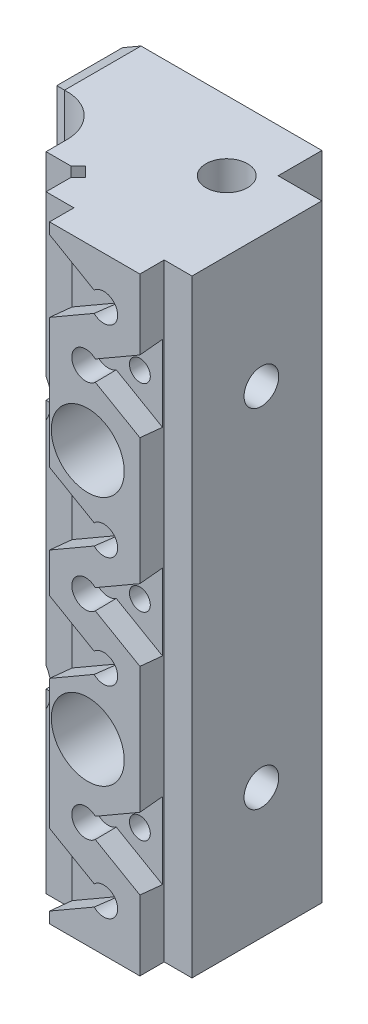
ISO-10303-21;
HEADER;
FILE_DESCRIPTION(('STEP AP214'),'2;1');
FILE_NAME('part.step','',(''),(''),'','','');
FILE_SCHEMA(('AUTOMOTIVE_DESIGN { 1 0 10303 214 1 1 1 1 }'));
ENDSEC;
DATA;
#1=APPLICATION_CONTEXT('core data for automotive mechanical design processes');
#2=APPLICATION_PROTOCOL_DEFINITION('international standard','automotive_design',2000,#1);
#3=PRODUCT_CONTEXT('',#1,'mechanical');
#4=PRODUCT('Part','Part','',(#3));
#5=PRODUCT_RELATED_PRODUCT_CATEGORY('part','',(#4));
#6=PRODUCT_DEFINITION_FORMATION('','',#4);
#7=PRODUCT_DEFINITION_CONTEXT('part definition',#1,'design');
#8=PRODUCT_DEFINITION('design','',#6,#7);
#9=PRODUCT_DEFINITION_SHAPE('','',#8);
#10=(LENGTH_UNIT() NAMED_UNIT(*) SI_UNIT(.MILLI.,.METRE.));
#11=(NAMED_UNIT(*) PLANE_ANGLE_UNIT() SI_UNIT($,.RADIAN.));
#12=(NAMED_UNIT(*) SI_UNIT($,.STERADIAN.) SOLID_ANGLE_UNIT());
#13=UNCERTAINTY_MEASURE_WITH_UNIT(LENGTH_MEASURE(1.E-05),#10,'distance_accuracy_value','');
#14=(GEOMETRIC_REPRESENTATION_CONTEXT(3) GLOBAL_UNCERTAINTY_ASSIGNED_CONTEXT((#13)) GLOBAL_UNIT_ASSIGNED_CONTEXT((#10,
#11,#12)) REPRESENTATION_CONTEXT('',''));
#15=CARTESIAN_POINT('',(0.,0.,0.));
#16=DIRECTION('',(0.,0.,1.));
#17=DIRECTION('',(1.,0.,0.));
#18=AXIS2_PLACEMENT_3D('',#15,#16,#17);
#19=CARTESIAN_POINT('',(5.,-3.95,-3.5));
#20=DIRECTION('',(0.,1.,0.));
#21=DIRECTION('',(0.,0.,1.));
#22=AXIS2_PLACEMENT_3D('',#19,#20,#21);
#23=PLANE('',#22);
#24=DIRECTION('',(0.,0.,1.));
#25=VECTOR('',#24,1.);
#26=CARTESIAN_POINT('',(-5.,-3.95,-3.5));
#27=LINE('',#26,#25);
#28=CARTESIAN_POINT('',(-5.,-3.95,0.));
#29=VERTEX_POINT('',#28);
#30=CARTESIAN_POINT('',(-5.,-3.95,-3.5));
#31=VERTEX_POINT('',#30);
#32=EDGE_CURVE('E929',#29,#31,#27,.F.);
#33=ORIENTED_EDGE('',*,*,#32,.T.);
#34=DIRECTION('',(1.,0.,0.));
#35=VECTOR('',#34,1.);
#36=CARTESIAN_POINT('',(5.,-3.95,-3.5));
#37=LINE('',#36,#35);
#38=CARTESIAN_POINT('',(5.,-3.95,-3.5));
#39=VERTEX_POINT('',#38);
#40=EDGE_CURVE('E940',#31,#39,#37,.T.);
#41=ORIENTED_EDGE('',*,*,#40,.T.);
#42=DIRECTION('',(0.,0.,1.));
#43=VECTOR('',#42,1.);
#44=CARTESIAN_POINT('',(5.,-3.95,-3.5));
#45=LINE('',#44,#43);
#46=CARTESIAN_POINT('',(5.,-3.95,0.));
#47=VERTEX_POINT('',#46);
#48=EDGE_CURVE('E921',#47,#39,#45,.F.);
#49=ORIENTED_EDGE('',*,*,#48,.F.);
#50=DIRECTION('',(1.,0.,0.));
#51=VECTOR('',#50,1.);
#52=CARTESIAN_POINT('',(25.5,-3.94999999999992,0.));
#53=LINE('',#52,#51);
#54=EDGE_CURVE('E1474',#29,#47,#53,.T.);
#55=ORIENTED_EDGE('',*,*,#54,.F.);
#56=EDGE_LOOP('',(#33,#41,#49,#55));
#57=FACE_BOUND('',#56,.T.);
#58=ADVANCED_FACE('F18',(#57),#23,.F.);
#59=CARTESIAN_POINT('',(4.99999999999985,39.95,-3.5));
#60=DIRECTION('',(-1.,0.,0.));
#61=DIRECTION('',(0.,-1.,0.));
#62=AXIS2_PLACEMENT_3D('',#59,#60,#61);
#63=PLANE('',#62);
#64=ORIENTED_EDGE('',*,*,#48,.T.);
#65=DIRECTION('',(0.,1.,0.));
#66=VECTOR('',#65,1.);
#67=CARTESIAN_POINT('',(4.99999999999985,39.95,-3.5));
#68=LINE('',#67,#66);
#69=CARTESIAN_POINT('',(4.99999999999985,39.95,-3.5));
#70=VERTEX_POINT('',#69);
#71=EDGE_CURVE('E923',#39,#70,#68,.T.);
#72=ORIENTED_EDGE('',*,*,#71,.T.);
#73=DIRECTION('',(0.,0.,1.));
#74=VECTOR('',#73,1.);
#75=CARTESIAN_POINT('',(4.99999999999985,39.95,-3.5));
#76=LINE('',#75,#74);
#77=CARTESIAN_POINT('',(4.99999999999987,39.95,0.));
#78=VERTEX_POINT('',#77);
#79=EDGE_CURVE('E896',#78,#70,#76,.F.);
#80=ORIENTED_EDGE('',*,*,#79,.F.);
#81=DIRECTION('',(0.,1.,0.));
#82=VECTOR('',#81,1.);
#83=CARTESIAN_POINT('',(5.0000000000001,-25.75,0.));
#84=LINE('',#83,#82);
#85=EDGE_CURVE('E925',#47,#78,#84,.T.);
#86=ORIENTED_EDGE('',*,*,#85,.F.);
#87=EDGE_LOOP('',(#64,#72,#80,#86));
#88=FACE_BOUND('',#87,.T.);
#89=ADVANCED_FACE('F903',(#88),#63,.F.);
#90=CARTESIAN_POINT('',(4.99999999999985,39.95,-3.5));
#91=DIRECTION('',(0.,-1.,0.));
#92=DIRECTION('',(0.,0.,-1.));
#93=AXIS2_PLACEMENT_3D('',#90,#91,#92);
#94=PLANE('',#93);
#95=ORIENTED_EDGE('',*,*,#79,.T.);
#96=DIRECTION('',(-1.,0.,0.));
#97=VECTOR('',#96,1.);
#98=CARTESIAN_POINT('',(4.99999999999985,39.95,-3.5));
#99=LINE('',#98,#97);
#100=CARTESIAN_POINT('',(-5.00000000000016,39.95,-3.5));
#101=VERTEX_POINT('',#100);
#102=EDGE_CURVE('E932',#70,#101,#99,.T.);
#103=ORIENTED_EDGE('',*,*,#102,.T.);
#104=DIRECTION('',(0.,0.,1.));
#105=VECTOR('',#104,1.);
#106=CARTESIAN_POINT('',(-5.00000000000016,39.95,-3.5));
#107=LINE('',#106,#105);
#108=CARTESIAN_POINT('',(-5.00000000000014,39.95,0.));
#109=VERTEX_POINT('',#108);
#110=EDGE_CURVE('E935',#109,#101,#107,.F.);
#111=ORIENTED_EDGE('',*,*,#110,.F.);
#112=DIRECTION('',(1.,0.,0.));
#113=VECTOR('',#112,1.);
#114=CARTESIAN_POINT('',(25.5,39.95,0.));
#115=LINE('',#114,#113);
#116=EDGE_CURVE('E1471',#78,#109,#115,.F.);
#117=ORIENTED_EDGE('',*,*,#116,.F.);
#118=EDGE_LOOP('',(#95,#103,#111,#117));
#119=FACE_BOUND('',#118,.T.);
#120=ADVANCED_FACE('F907',(#119),#94,.F.);
#121=CARTESIAN_POINT('',(-5.00000000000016,39.95,-3.5));
#122=DIRECTION('',(1.,0.,0.));
#123=DIRECTION('',(0.,1.,0.));
#124=AXIS2_PLACEMENT_3D('',#121,#122,#123);
#125=PLANE('',#124);
#126=ORIENTED_EDGE('',*,*,#110,.T.);
#127=DIRECTION('',(0.,-1.,0.));
#128=VECTOR('',#127,1.);
#129=CARTESIAN_POINT('',(-5.00000000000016,39.95,-3.5));
#130=LINE('',#129,#128);
#131=EDGE_CURVE('E928',#101,#31,#130,.T.);
#132=ORIENTED_EDGE('',*,*,#131,.T.);
#133=ORIENTED_EDGE('',*,*,#32,.F.);
#134=DIRECTION('',(0.,1.,0.));
#135=VECTOR('',#134,1.);
#136=CARTESIAN_POINT('',(-4.99999999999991,-25.75,0.));
#137=LINE('',#136,#135);
#138=EDGE_CURVE('E1222',#109,#29,#137,.F.);
#139=ORIENTED_EDGE('',*,*,#138,.F.);
#140=EDGE_LOOP('',(#126,#132,#133,#139));
#141=FACE_BOUND('',#140,.T.);
#142=ADVANCED_FACE('F835',(#141),#125,.F.);
#143=CARTESIAN_POINT('',(8.49999999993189,-7.,15.));
#144=DIRECTION('',(1.,0.,0.));
#145=DIRECTION('',(0.,1.,0.));
#146=AXIS2_PLACEMENT_3D('',#143,#144,#145);
#147=CONICAL_SURFACE('',#146,2.49999999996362,1.22173047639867);
#148=CARTESIAN_POINT('',(7.5900744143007,-7.00000000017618,15.));
#149=VERTEX_POINT('',#148);
#150=VERTEX_LOOP('',#149);
#151=FACE_BOUND('',#150,.T.);
#152=CARTESIAN_POINT('',(8.5000000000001,-7.,15.));
#153=DIRECTION('',(1.,0.,0.));
#154=DIRECTION('',(0.,1.,0.));
#155=AXIS2_PLACEMENT_3D('',#152,#153,#154);
#156=CIRCLE('',#155,2.5);
#157=CARTESIAN_POINT('',(8.50000000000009,-4.5,15.));
#158=VERTEX_POINT('',#157);
#159=EDGE_CURVE('E586',#158,#158,#156,.T.);
#160=ORIENTED_EDGE('',*,*,#159,.T.);
#161=EDGE_LOOP('',(#160));
#162=FACE_BOUND('',#161,.T.);
#163=ADVANCED_FACE('F831',(#151,#162),#147,.F.);
#164=CARTESIAN_POINT('',(25.5,-6.99999999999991,15.));
#165=DIRECTION('',(1.,0.,0.));
#166=DIRECTION('',(0.,1.,0.));
#167=AXIS2_PLACEMENT_3D('',#164,#165,#166);
#168=CYLINDRICAL_SURFACE('',#167,2.5);
#169=ORIENTED_EDGE('',*,*,#159,.F.);
#170=EDGE_LOOP('',(#169));
#171=FACE_BOUND('',#170,.T.);
#172=CARTESIAN_POINT('',(25.4893048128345,-6.99999999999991,15.));
#173=DIRECTION('',(-0.999999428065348,0.,0.00106951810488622));
#174=DIRECTION('',(0.00106951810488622,0.,0.999999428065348));
#175=AXIS2_PLACEMENT_3D('',#172,#173,#174);
#176=ELLIPSE('',#175,2.50000142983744,2.5);
#177=CARTESIAN_POINT('',(25.491978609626,-6.99999999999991,17.5));
#178=VERTEX_POINT('',#177);
#179=EDGE_CURVE('E589',#178,#178,#176,.F.);
#180=ORIENTED_EDGE('',*,*,#179,.T.);
#181=EDGE_LOOP('',(#180));
#182=FACE_BOUND('',#181,.T.);
#183=ADVANCED_FACE('F834',(#171,#182),#168,.F.);
#184=CARTESIAN_POINT('',(19.5,18.,-3.50000000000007));
#185=DIRECTION('',(0.,0.,1.));
#186=DIRECTION('',(0.,-1.,0.));
#187=AXIS2_PLACEMENT_3D('',#184,#185,#186);
#188=PLANE('',#187);
#189=ORIENTED_EDGE('',*,*,#40,.F.);
#190=ORIENTED_EDGE('',*,*,#131,.F.);
#191=ORIENTED_EDGE('',*,*,#102,.F.);
#192=ORIENTED_EDGE('',*,*,#71,.F.);
#193=EDGE_LOOP('',(#189,#190,#191,#192));
#194=FACE_BOUND('',#193,.T.);
#195=CARTESIAN_POINT('',(-1.37913512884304E-13,36.,-3.5));
#196=DIRECTION('',(0.,0.,1.));
#197=DIRECTION('',(0.,-1.,0.));
#198=AXIS2_PLACEMENT_3D('',#195,#196,#197);
#199=CIRCLE('',#198,3.25);
#200=CARTESIAN_POINT('',(-1.26566198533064E-13,32.75,-3.5));
#201=VERTEX_POINT('',#200);
#202=EDGE_CURVE('E1071',#201,#201,#199,.F.);
#203=ORIENTED_EDGE('',*,*,#202,.F.);
#204=EDGE_LOOP('',(#203));
#205=FACE_BOUND('',#204,.T.);
#206=CARTESIAN_POINT('',(0.,0.,-3.5));
#207=DIRECTION('',(0.,0.,1.));
#208=DIRECTION('',(0.,-1.,0.));
#209=AXIS2_PLACEMENT_3D('',#206,#207,#208);
#210=CIRCLE('',#209,3.25);
#211=CARTESIAN_POINT('',(0.,-3.25,-3.5));
#212=VERTEX_POINT('',#211);
#213=EDGE_CURVE('E1089',#212,#212,#210,.T.);
#214=ORIENTED_EDGE('',*,*,#213,.T.);
#215=EDGE_LOOP('',(#214));
#216=FACE_BOUND('',#215,.T.);
#217=ADVANCED_FACE('F20',(#194,#205,#216),#188,.F.);
#218=CARTESIAN_POINT('',(25.5,61.75,25.));
#219=DIRECTION('',(-0.999999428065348,0.,0.00106951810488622));
#220=DIRECTION('',(0.00106951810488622,0.,0.999999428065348));
#221=AXIS2_PLACEMENT_3D('',#218,#219,#220);
#222=PLANE('',#221);
#223=ORIENTED_EDGE('',*,*,#179,.F.);
#224=EDGE_LOOP('',(#223));
#225=FACE_BOUND('',#224,.T.);
#226=DIRECTION('',(0.00106951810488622,0.,0.999999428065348));
#227=VECTOR('',#226,1.);
#228=CARTESIAN_POINT('',(25.4732620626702,61.75,2.85967243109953E-05));
#229=LINE('',#228,#227);
#230=CARTESIAN_POINT('',(25.48,61.75,6.29999999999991));
#231=VERTEX_POINT('',#230);
#232=CARTESIAN_POINT('',(25.5,61.75,25.));
#233=VERTEX_POINT('',#232);
#234=EDGE_CURVE('E1268',#231,#233,#229,.T.);
#235=ORIENTED_EDGE('',*,*,#234,.T.);
#236=DIRECTION('',(0.,1.,0.));
#237=VECTOR('',#236,1.);
#238=CARTESIAN_POINT('',(25.5,18.,25.));
#239=LINE('',#238,#237);
#240=CARTESIAN_POINT('',(25.5,-25.75,25.));
#241=VERTEX_POINT('',#240);
#242=EDGE_CURVE('E557',#233,#241,#239,.F.);
#243=ORIENTED_EDGE('',*,*,#242,.T.);
#244=DIRECTION('',(-0.00106951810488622,0.,-0.999999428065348));
#245=VECTOR('',#244,1.);
#246=CARTESIAN_POINT('',(25.4732620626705,-25.75,2.85967243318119E-05));
#247=LINE('',#246,#245);
#248=CARTESIAN_POINT('',(25.48,-25.75,6.29999999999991));
#249=VERTEX_POINT('',#248);
#250=EDGE_CURVE('E1056',#241,#249,#247,.T.);
#251=ORIENTED_EDGE('',*,*,#250,.T.);
#252=DIRECTION('',(0.,1.,0.));
#253=VECTOR('',#252,1.);
#254=CARTESIAN_POINT('',(25.48,61.75,6.29999999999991));
#255=LINE('',#254,#253);
#256=EDGE_CURVE('E1227',#231,#249,#255,.F.);
#257=ORIENTED_EDGE('',*,*,#256,.F.);
#258=EDGE_LOOP('',(#235,#243,#251,#257));
#259=FACE_BOUND('',#258,.T.);
#260=CARTESIAN_POINT('',(25.4893048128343,43.,15.));
#261=DIRECTION('',(-0.999999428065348,0.,0.00106951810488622));
#262=DIRECTION('',(0.00106951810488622,0.,0.999999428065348));
#263=AXIS2_PLACEMENT_3D('',#260,#261,#262);
#264=ELLIPSE('',#263,2.50000142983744,2.5);
#265=CARTESIAN_POINT('',(25.4919786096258,43.,17.5));
#266=VERTEX_POINT('',#265);
#267=EDGE_CURVE('E1086',#266,#266,#264,.T.);
#268=ORIENTED_EDGE('',*,*,#267,.T.);
#269=EDGE_LOOP('',(#268));
#270=FACE_BOUND('',#269,.T.);
#271=ADVANCED_FACE('F754',(#225,#259,#270),#222,.F.);
#272=CARTESIAN_POINT('',(16.82,-19.,25.25));
#273=DIRECTION('',(0.,0.,-1.));
#274=DIRECTION('',(0.,1.,0.));
#275=AXIS2_PLACEMENT_3D('',#272,#273,#274);
#276=PLANE('',#275);
#277=CARTESIAN_POINT('',(11.7499999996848,-19.,25.25));
#278=DIRECTION('',(0.,0.,1.));
#279=DIRECTION('',(0.,-1.,0.));
#280=AXIS2_PLACEMENT_3D('',#277,#278,#279);
#281=CIRCLE('',#280,1.5);
#282=CARTESIAN_POINT('',(11.7499999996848,-20.5,25.25));
#283=VERTEX_POINT('',#282);
#284=EDGE_CURVE('E2300',#283,#283,#281,.T.);
#285=ORIENTED_EDGE('',*,*,#284,.F.);
#286=EDGE_LOOP('',(#285));
#287=FACE_BOUND('',#286,.T.);
#288=DIRECTION('',(0.866025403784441,0.5,0.));
#289=VECTOR('',#288,1.);
#290=CARTESIAN_POINT('',(17.1137443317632,-19.5087801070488,25.25));
#291=LINE('',#290,#289);
#292=CARTESIAN_POINT('',(8.5000000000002,-24.4819277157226,25.25));
#293=VERTEX_POINT('',#292);
#294=CARTESIAN_POINT('',(15.1548841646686,-20.6397285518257,25.25));
#295=VERTEX_POINT('',#294);
#296=EDGE_CURVE('E486',#293,#295,#291,.T.);
#297=ORIENTED_EDGE('',*,*,#296,.T.);
#298=CARTESIAN_POINT('',(16.3,-19.,25.25));
#299=DIRECTION('',(0.,0.,1.));
#300=DIRECTION('',(0.,-1.,0.));
#301=AXIS2_PLACEMENT_3D('',#298,#299,#300);
#302=CIRCLE('',#301,2.);
#303=CARTESIAN_POINT('',(15.1548841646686,-17.3602714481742,25.25));
#304=VERTEX_POINT('',#303);
#305=EDGE_CURVE('E1074',#295,#304,#302,.T.);
#306=ORIENTED_EDGE('',*,*,#305,.T.);
#307=DIRECTION('',(0.866025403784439,-0.5,0.));
#308=VECTOR('',#307,1.);
#309=CARTESIAN_POINT('',(8.50000000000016,-13.5180722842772,25.25));
#310=LINE('',#309,#308);
#311=CARTESIAN_POINT('',(8.50000000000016,-13.5180722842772,25.25));
#312=VERTEX_POINT('',#311);
#313=EDGE_CURVE('E489',#312,#304,#310,.T.);
#314=ORIENTED_EDGE('',*,*,#313,.F.);
#315=DIRECTION('',(0.,1.,0.));
#316=VECTOR('',#315,1.);
#317=CARTESIAN_POINT('',(8.4999999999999,61.75,25.25));
#318=LINE('',#317,#316);
#319=EDGE_CURVE('E495',#312,#293,#318,.F.);
#320=ORIENTED_EDGE('',*,*,#319,.T.);
#321=EDGE_LOOP('',(#297,#306,#314,#320));
#322=FACE_BOUND('',#321,.T.);
#323=ADVANCED_FACE('F720',(#287,#322),#276,.F.);
#324=CARTESIAN_POINT('',(16.82,10.,25.25));
#325=DIRECTION('',(0.,0.,-1.));
#326=DIRECTION('',(0.,1.,0.));
#327=AXIS2_PLACEMENT_3D('',#324,#325,#326);
#328=PLANE('',#327);
#329=CARTESIAN_POINT('',(11.75,10.,25.25));
#330=DIRECTION('',(0.,0.,1.));
#331=DIRECTION('',(0.,-1.,0.));
#332=AXIS2_PLACEMENT_3D('',#329,#330,#331);
#333=CIRCLE('',#332,1.5);
#334=CARTESIAN_POINT('',(11.75,8.5,25.25));
#335=VERTEX_POINT('',#334);
#336=EDGE_CURVE('E2329',#335,#335,#333,.T.);
#337=ORIENTED_EDGE('',*,*,#336,.F.);
#338=EDGE_LOOP('',(#337));
#339=FACE_BOUND('',#338,.T.);
#340=DIRECTION('',(-0.866025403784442,-0.499999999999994,0.));
#341=VECTOR('',#340,1.);
#342=CARTESIAN_POINT('',(15.1548841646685,8.36027144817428,25.25));
#343=LINE('',#342,#341);
#344=CARTESIAN_POINT('',(15.1548841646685,8.36027144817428,25.25));
#345=VERTEX_POINT('',#344);
#346=CARTESIAN_POINT('',(8.5,4.51807228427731,25.25));
#347=VERTEX_POINT('',#346);
#348=EDGE_CURVE('E969',#345,#347,#343,.T.);
#349=ORIENTED_EDGE('',*,*,#348,.F.);
#350=CARTESIAN_POINT('',(16.3,10.,25.25));
#351=DIRECTION('',(0.,0.,1.));
#352=DIRECTION('',(0.,-1.,0.));
#353=AXIS2_PLACEMENT_3D('',#350,#351,#352);
#354=CIRCLE('',#353,2.);
#355=CARTESIAN_POINT('',(15.1548841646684,11.6397285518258,25.25));
#356=VERTEX_POINT('',#355);
#357=EDGE_CURVE('E1462',#345,#356,#354,.T.);
#358=ORIENTED_EDGE('',*,*,#357,.T.);
#359=DIRECTION('',(0.866025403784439,-0.5,0.));
#360=VECTOR('',#359,1.);
#361=CARTESIAN_POINT('',(8.5,15.4819277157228,25.25));
#362=LINE('',#361,#360);
#363=CARTESIAN_POINT('',(8.5,15.4819277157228,25.25));
#364=VERTEX_POINT('',#363);
#365=EDGE_CURVE('E978',#364,#356,#362,.T.);
#366=ORIENTED_EDGE('',*,*,#365,.F.);
#367=DIRECTION('',(0.,1.,0.));
#368=VECTOR('',#367,1.);
#369=CARTESIAN_POINT('',(8.4999999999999,61.75,25.25));
#370=LINE('',#369,#368);
#371=EDGE_CURVE('E501',#364,#347,#370,.F.);
#372=ORIENTED_EDGE('',*,*,#371,.T.);
#373=EDGE_LOOP('',(#349,#358,#366,#372));
#374=FACE_BOUND('',#373,.T.);
#375=ADVANCED_FACE('F716',(#339,#374),#328,.F.);
#376=CARTESIAN_POINT('',(16.82,26.,25.25));
#377=DIRECTION('',(0.,0.,-1.));
#378=DIRECTION('',(0.,1.,0.));
#379=AXIS2_PLACEMENT_3D('',#376,#377,#378);
#380=PLANE('',#379);
#381=CARTESIAN_POINT('',(11.75,26.,25.25));
#382=DIRECTION('',(0.,0.,1.));
#383=DIRECTION('',(0.,-1.,0.));
#384=AXIS2_PLACEMENT_3D('',#381,#382,#383);
#385=CIRCLE('',#384,1.5);
#386=CARTESIAN_POINT('',(11.75,24.5,25.25));
#387=VERTEX_POINT('',#386);
#388=EDGE_CURVE('E2317',#387,#387,#385,.T.);
#389=ORIENTED_EDGE('',*,*,#388,.F.);
#390=EDGE_LOOP('',(#389));
#391=FACE_BOUND('',#390,.T.);
#392=DIRECTION('',(0.866025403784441,0.5,0.));
#393=VECTOR('',#392,1.);
#394=CARTESIAN_POINT('',(17.113744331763,25.4912198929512,25.25));
#395=LINE('',#394,#393);
#396=CARTESIAN_POINT('',(8.5,20.5180722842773,25.25));
#397=VERTEX_POINT('',#396);
#398=CARTESIAN_POINT('',(15.1548841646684,24.3602714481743,25.25));
#399=VERTEX_POINT('',#398);
#400=EDGE_CURVE('E982',#397,#399,#395,.T.);
#401=ORIENTED_EDGE('',*,*,#400,.T.);
#402=CARTESIAN_POINT('',(16.3,26.,25.25));
#403=DIRECTION('',(0.,0.,1.));
#404=DIRECTION('',(0.,-1.,0.));
#405=AXIS2_PLACEMENT_3D('',#402,#403,#404);
#406=CIRCLE('',#405,2.);
#407=CARTESIAN_POINT('',(15.1548841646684,27.6397285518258,25.25));
#408=VERTEX_POINT('',#407);
#409=EDGE_CURVE('E1465',#399,#408,#406,.T.);
#410=ORIENTED_EDGE('',*,*,#409,.T.);
#411=DIRECTION('',(0.866025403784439,-0.5,0.));
#412=VECTOR('',#411,1.);
#413=CARTESIAN_POINT('',(8.5,31.4819277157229,25.25));
#414=LINE('',#413,#412);
#415=CARTESIAN_POINT('',(8.5,31.4819277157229,25.25));
#416=VERTEX_POINT('',#415);
#417=EDGE_CURVE('E986',#416,#408,#414,.T.);
#418=ORIENTED_EDGE('',*,*,#417,.F.);
#419=DIRECTION('',(0.,1.,0.));
#420=VECTOR('',#419,1.);
#421=CARTESIAN_POINT('',(8.4999999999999,61.75,25.25));
#422=LINE('',#421,#420);
#423=EDGE_CURVE('E512',#416,#397,#422,.F.);
#424=ORIENTED_EDGE('',*,*,#423,.T.);
#425=EDGE_LOOP('',(#401,#410,#418,#424));
#426=FACE_BOUND('',#425,.T.);
#427=ADVANCED_FACE('F719',(#391,#426),#380,.F.);
#428=CARTESIAN_POINT('',(16.82,55.,25.25));
#429=DIRECTION('',(0.,0.,-1.));
#430=DIRECTION('',(0.,1.,0.));
#431=AXIS2_PLACEMENT_3D('',#428,#429,#430);
#432=PLANE('',#431);
#433=CARTESIAN_POINT('',(11.7499999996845,55.,25.25));
#434=DIRECTION('',(0.,0.,1.));
#435=DIRECTION('',(0.,-1.,0.));
#436=AXIS2_PLACEMENT_3D('',#433,#434,#435);
#437=CIRCLE('',#436,1.5);
#438=CARTESIAN_POINT('',(11.7499999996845,53.5,25.25));
#439=VERTEX_POINT('',#438);
#440=EDGE_CURVE('E2305',#439,#439,#437,.T.);
#441=ORIENTED_EDGE('',*,*,#440,.F.);
#442=EDGE_LOOP('',(#441));
#443=FACE_BOUND('',#442,.T.);
#444=DIRECTION('',(0.866025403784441,0.5,0.));
#445=VECTOR('',#444,1.);
#446=CARTESIAN_POINT('',(17.1137443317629,54.4912198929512,25.25));
#447=LINE('',#446,#445);
#448=CARTESIAN_POINT('',(8.5,49.5180722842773,25.25));
#449=VERTEX_POINT('',#448);
#450=CARTESIAN_POINT('',(15.1548841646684,53.3602714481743,25.25));
#451=VERTEX_POINT('',#450);
#452=EDGE_CURVE('E457',#449,#451,#447,.T.);
#453=ORIENTED_EDGE('',*,*,#452,.T.);
#454=CARTESIAN_POINT('',(16.3,55.,25.25));
#455=DIRECTION('',(0.,0.,1.));
#456=DIRECTION('',(0.,-1.,0.));
#457=AXIS2_PLACEMENT_3D('',#454,#455,#456);
#458=CIRCLE('',#457,2.);
#459=CARTESIAN_POINT('',(15.1548841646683,56.6397285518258,25.25));
#460=VERTEX_POINT('',#459);
#461=EDGE_CURVE('E450',#451,#460,#458,.T.);
#462=ORIENTED_EDGE('',*,*,#461,.T.);
#463=DIRECTION('',(0.866025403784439,-0.5,0.));
#464=VECTOR('',#463,1.);
#465=CARTESIAN_POINT('',(8.4999999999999,60.4819277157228,25.25));
#466=LINE('',#465,#464);
#467=CARTESIAN_POINT('',(8.4999999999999,60.4819277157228,25.25));
#468=VERTEX_POINT('',#467);
#469=EDGE_CURVE('E454',#468,#460,#466,.T.);
#470=ORIENTED_EDGE('',*,*,#469,.F.);
#471=DIRECTION('',(0.,1.,0.));
#472=VECTOR('',#471,1.);
#473=CARTESIAN_POINT('',(8.4999999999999,61.75,25.25));
#474=LINE('',#473,#472);
#475=EDGE_CURVE('E480',#468,#449,#474,.F.);
#476=ORIENTED_EDGE('',*,*,#475,.T.);
#477=EDGE_LOOP('',(#453,#462,#470,#476));
#478=FACE_BOUND('',#477,.T.);
#479=ADVANCED_FACE('F452',(#443,#478),#432,.F.);
#480=CARTESIAN_POINT('',(13.18,18.,25.25));
#481=DIRECTION('',(0.,0.,1.));
#482=DIRECTION('',(0.,-1.,0.));
#483=AXIS2_PLACEMENT_3D('',#480,#481,#482);
#484=PLANE('',#483);
#485=CARTESIAN_POINT('',(18.25,18.,25.25));
#486=DIRECTION('',(0.,0.,1.));
#487=DIRECTION('',(0.,-1.,0.));
#488=AXIS2_PLACEMENT_3D('',#485,#486,#487);
#489=CIRCLE('',#488,1.5);
#490=CARTESIAN_POINT('',(18.25,16.5,25.25));
#491=VERTEX_POINT('',#490);
#492=EDGE_CURVE('E2323',#491,#491,#489,.T.);
#493=ORIENTED_EDGE('',*,*,#492,.F.);
#494=EDGE_LOOP('',(#493));
#495=FACE_BOUND('',#494,.T.);
#496=DIRECTION('',(-0.866025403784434,-0.5,0.));
#497=VECTOR('',#496,1.);
#498=CARTESIAN_POINT('',(12.886255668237,18.5087801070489,25.25));
#499=LINE('',#498,#497);
#500=CARTESIAN_POINT('',(21.5,23.4819277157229,25.25));
#501=VERTEX_POINT('',#500);
#502=CARTESIAN_POINT('',(14.8451158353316,19.6397285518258,25.25));
#503=VERTEX_POINT('',#502);
#504=EDGE_CURVE('E540',#501,#503,#499,.T.);
#505=ORIENTED_EDGE('',*,*,#504,.T.);
#506=CARTESIAN_POINT('',(13.7,18.,25.25));
#507=DIRECTION('',(0.,0.,1.));
#508=DIRECTION('',(0.,-1.,0.));
#509=AXIS2_PLACEMENT_3D('',#506,#507,#508);
#510=CIRCLE('',#509,2.);
#511=CARTESIAN_POINT('',(14.8451158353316,16.3602714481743,25.25));
#512=VERTEX_POINT('',#511);
#513=EDGE_CURVE('E1333',#503,#512,#510,.T.);
#514=ORIENTED_EDGE('',*,*,#513,.T.);
#515=DIRECTION('',(0.866025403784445,-0.499999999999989,0.));
#516=VECTOR('',#515,1.);
#517=CARTESIAN_POINT('',(22.4562556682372,11.9659778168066,25.25));
#518=LINE('',#517,#516);
#519=CARTESIAN_POINT('',(21.5,12.5180722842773,25.25));
#520=VERTEX_POINT('',#519);
#521=EDGE_CURVE('E544',#512,#520,#518,.T.);
#522=ORIENTED_EDGE('',*,*,#521,.T.);
#523=DIRECTION('',(0.,-1.,0.));
#524=VECTOR('',#523,1.);
#525=CARTESIAN_POINT('',(21.5,61.75,25.25));
#526=LINE('',#525,#524);
#527=EDGE_CURVE('E539',#520,#501,#526,.F.);
#528=ORIENTED_EDGE('',*,*,#527,.T.);
#529=EDGE_LOOP('',(#505,#514,#522,#528));
#530=FACE_BOUND('',#529,.T.);
#531=ADVANCED_FACE('F742',(#495,#530),#484,.T.);
#532=CARTESIAN_POINT('',(13.18,46.5,25.25));
#533=DIRECTION('',(0.,0.,1.));
#534=DIRECTION('',(0.,-1.,0.));
#535=AXIS2_PLACEMENT_3D('',#532,#533,#534);
#536=PLANE('',#535);
#537=CARTESIAN_POINT('',(18.2500000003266,46.5,25.25));
#538=DIRECTION('',(0.,0.,1.));
#539=DIRECTION('',(0.,-1.,0.));
#540=AXIS2_PLACEMENT_3D('',#537,#538,#539);
#541=CIRCLE('',#540,1.5);
#542=CARTESIAN_POINT('',(18.2500000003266,45.,25.25));
#543=VERTEX_POINT('',#542);
#544=EDGE_CURVE('E2311',#543,#543,#541,.T.);
#545=ORIENTED_EDGE('',*,*,#544,.F.);
#546=EDGE_LOOP('',(#545));
#547=FACE_BOUND('',#546,.T.);
#548=DIRECTION('',(-0.866025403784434,-0.5,0.));
#549=VECTOR('',#548,1.);
#550=CARTESIAN_POINT('',(12.8862556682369,47.0087801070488,25.25));
#551=LINE('',#550,#549);
#552=CARTESIAN_POINT('',(21.5,51.9819277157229,25.25));
#553=VERTEX_POINT('',#552);
#554=CARTESIAN_POINT('',(14.8451158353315,48.1397285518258,25.25));
#555=VERTEX_POINT('',#554);
#556=EDGE_CURVE('E513',#553,#555,#551,.T.);
#557=ORIENTED_EDGE('',*,*,#556,.T.);
#558=CARTESIAN_POINT('',(13.7,46.5,25.25));
#559=DIRECTION('',(0.,0.,1.));
#560=DIRECTION('',(0.,-1.,0.));
#561=AXIS2_PLACEMENT_3D('',#558,#559,#560);
#562=CIRCLE('',#561,2.);
#563=CARTESIAN_POINT('',(14.8451158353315,44.8602714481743,25.25));
#564=VERTEX_POINT('',#563);
#565=EDGE_CURVE('E460',#555,#564,#562,.T.);
#566=ORIENTED_EDGE('',*,*,#565,.T.);
#567=DIRECTION('',(0.866025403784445,-0.499999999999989,0.));
#568=VECTOR('',#567,1.);
#569=CARTESIAN_POINT('',(22.4562556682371,40.4659778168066,25.25));
#570=LINE('',#569,#568);
#571=CARTESIAN_POINT('',(21.5,41.0180722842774,25.25));
#572=VERTEX_POINT('',#571);
#573=EDGE_CURVE('E526',#564,#572,#570,.T.);
#574=ORIENTED_EDGE('',*,*,#573,.T.);
#575=DIRECTION('',(0.,-1.,0.));
#576=VECTOR('',#575,1.);
#577=CARTESIAN_POINT('',(21.5,61.75,25.25));
#578=LINE('',#577,#576);
#579=EDGE_CURVE('E525',#572,#553,#578,.F.);
#580=ORIENTED_EDGE('',*,*,#579,.T.);
#581=EDGE_LOOP('',(#557,#566,#574,#580));
#582=FACE_BOUND('',#581,.T.);
#583=ADVANCED_FACE('F816',(#547,#582),#536,.T.);
#584=CARTESIAN_POINT('',(13.1800000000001,-10.5,25.25));
#585=DIRECTION('',(0.,0.,1.));
#586=DIRECTION('',(0.,-1.,0.));
#587=AXIS2_PLACEMENT_3D('',#584,#585,#586);
#588=PLANE('',#587);
#589=CARTESIAN_POINT('',(18.25,-10.5,25.25));
#590=DIRECTION('',(0.,0.,1.));
#591=DIRECTION('',(0.,-1.,0.));
#592=AXIS2_PLACEMENT_3D('',#589,#590,#591);
#593=CIRCLE('',#592,1.5);
#594=CARTESIAN_POINT('',(18.25,-12.,25.25));
#595=VERTEX_POINT('',#594);
#596=EDGE_CURVE('E2335',#595,#595,#593,.T.);
#597=ORIENTED_EDGE('',*,*,#596,.F.);
#598=EDGE_LOOP('',(#597));
#599=FACE_BOUND('',#598,.T.);
#600=DIRECTION('',(-0.866025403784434,-0.5,0.));
#601=VECTOR('',#600,1.);
#602=CARTESIAN_POINT('',(12.8862556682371,-9.99121989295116,25.25));
#603=LINE('',#602,#601);
#604=CARTESIAN_POINT('',(21.5,-5.01807228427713,25.25));
#605=VERTEX_POINT('',#604);
#606=CARTESIAN_POINT('',(14.8451158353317,-8.8602714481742,25.25));
#607=VERTEX_POINT('',#606);
#608=EDGE_CURVE('E558',#605,#607,#603,.T.);
#609=ORIENTED_EDGE('',*,*,#608,.T.);
#610=CARTESIAN_POINT('',(13.7000000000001,-10.5,25.25));
#611=DIRECTION('',(0.,0.,1.));
#612=DIRECTION('',(0.,-1.,0.));
#613=AXIS2_PLACEMENT_3D('',#610,#611,#612);
#614=CIRCLE('',#613,2.);
#615=CARTESIAN_POINT('',(14.8451158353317,-12.1397285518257,25.25));
#616=VERTEX_POINT('',#615);
#617=EDGE_CURVE('E1341',#607,#616,#614,.T.);
#618=ORIENTED_EDGE('',*,*,#617,.T.);
#619=DIRECTION('',(0.866025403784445,-0.499999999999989,0.));
#620=VECTOR('',#619,1.);
#621=CARTESIAN_POINT('',(22.4562556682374,-16.5340221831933,25.25));
#622=LINE('',#621,#620);
#623=CARTESIAN_POINT('',(21.5,-15.9819277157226,25.25));
#624=VERTEX_POINT('',#623);
#625=EDGE_CURVE('E562',#616,#624,#622,.T.);
#626=ORIENTED_EDGE('',*,*,#625,.T.);
#627=DIRECTION('',(0.,-1.,0.));
#628=VECTOR('',#627,1.);
#629=CARTESIAN_POINT('',(21.5,61.75,25.25));
#630=LINE('',#629,#628);
#631=EDGE_CURVE('E573',#624,#605,#630,.F.);
#632=ORIENTED_EDGE('',*,*,#631,.T.);
#633=EDGE_LOOP('',(#609,#618,#626,#632));
#634=FACE_BOUND('',#633,.T.);
#635=ADVANCED_FACE('F812',(#599,#634),#588,.T.);
#636=CARTESIAN_POINT('',(22.5,-16.4582547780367,26.25));
#637=DIRECTION('',(-0.498097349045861,-0.862729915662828,0.0871557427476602));
#638=DIRECTION('',(0.866025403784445,-0.499999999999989,0.));
#639=AXIS2_PLACEMENT_3D('',#636,#637,#638);
#640=PLANE('',#639);
#641=CARTESIAN_POINT('',(13.7000000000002,-10.5,34.9368397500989));
#642=DIRECTION('',(-0.498097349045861,-0.862729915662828,0.0871557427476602));
#643=DIRECTION('',(0.0435778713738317,0.0754790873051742,0.996194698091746));
#644=AXIS2_PLACEMENT_3D('',#641,#642,#643);
#645=ELLIPSE('',#644,22.9474264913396,2.);
#646=CARTESIAN_POINT('',(15.0803953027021,-11.9472417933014,28.5));
#647=VERTEX_POINT('',#646);
#648=EDGE_CURVE('E561',#616,#647,#645,.T.);
#649=ORIENTED_EDGE('',*,*,#648,.T.);
#650=DIRECTION('',(-0.866025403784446,0.499999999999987,0.));
#651=VECTOR('',#650,1.);
#652=CARTESIAN_POINT('',(21.5,-15.6536022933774,28.5));
#653=LINE('',#652,#651);
#654=CARTESIAN_POINT('',(21.5,-15.6536022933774,28.5));
#655=VERTEX_POINT('',#654);
#656=EDGE_CURVE('E568',#655,#647,#653,.T.);
#657=ORIENTED_EDGE('',*,*,#656,.F.);
#658=DIRECTION('',(0.,-0.1005116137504,-0.994935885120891));
#659=VECTOR('',#658,1.);
#660=CARTESIAN_POINT('',(21.5,-15.6536022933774,28.5));
#661=LINE('',#660,#659);
#662=EDGE_CURVE('E570',#655,#624,#661,.T.);
#663=ORIENTED_EDGE('',*,*,#662,.T.);
#664=ORIENTED_EDGE('',*,*,#625,.F.);
#665=EDGE_LOOP('',(#649,#657,#663,#664));
#666=FACE_BOUND('',#665,.T.);
#667=ADVANCED_FACE('F808',(#666),#640,.F.);
#668=CARTESIAN_POINT('',(13.7000000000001,-10.5,28.5));
#669=DIRECTION('',(0.,0.,1.));
#670=DIRECTION('',(1.,0.,0.));
#671=AXIS2_PLACEMENT_3D('',#668,#669,#670);
#672=CYLINDRICAL_SURFACE('',#671,2.);
#673=ORIENTED_EDGE('',*,*,#648,.F.);
#674=ORIENTED_EDGE('',*,*,#617,.F.);
#675=CARTESIAN_POINT('',(13.7000000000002,-10.5,34.9368397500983));
#676=DIRECTION('',(-0.49809734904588,0.862729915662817,0.0871557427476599));
#677=DIRECTION('',(0.0435778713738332,-0.075479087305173,0.996194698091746));
#678=AXIS2_PLACEMENT_3D('',#675,#676,#677);
#679=ELLIPSE('',#678,22.9474264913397,2.);
#680=CARTESIAN_POINT('',(15.0803953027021,-9.0527582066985,28.5));
#681=VERTEX_POINT('',#680);
#682=EDGE_CURVE('E546',#607,#681,#679,.F.);
#683=ORIENTED_EDGE('',*,*,#682,.T.);
#684=CARTESIAN_POINT('',(13.7000000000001,-10.5,28.5));
#685=DIRECTION('',(0.,0.,1.));
#686=DIRECTION('',(1.,0.,0.));
#687=AXIS2_PLACEMENT_3D('',#684,#685,#686);
#688=CIRCLE('',#687,2.);
#689=EDGE_CURVE('E1030',#647,#681,#688,.F.);
#690=ORIENTED_EDGE('',*,*,#689,.F.);
#691=EDGE_LOOP('',(#673,#674,#683,#690));
#692=FACE_BOUND('',#691,.T.);
#693=ADVANCED_FACE('F804',(#692),#672,.F.);
#694=CARTESIAN_POINT('',(12.9300000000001,-10.0669872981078,26.25));
#695=DIRECTION('',(-0.49809734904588,0.862729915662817,0.0871557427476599));
#696=DIRECTION('',(-0.866025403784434,-0.5,0.));
#697=AXIS2_PLACEMENT_3D('',#694,#695,#696);
#698=PLANE('',#697);
#699=ORIENTED_EDGE('',*,*,#682,.F.);
#700=ORIENTED_EDGE('',*,*,#608,.F.);
#701=DIRECTION('',(0.,-0.100511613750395,0.994935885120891));
#702=VECTOR('',#701,1.);
#703=CARTESIAN_POINT('',(21.5,-5.01807228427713,25.25));
#704=LINE('',#703,#702);
#705=CARTESIAN_POINT('',(21.5,-5.34639770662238,28.5));
#706=VERTEX_POINT('',#705);
#707=EDGE_CURVE('E555',#605,#706,#704,.T.);
#708=ORIENTED_EDGE('',*,*,#707,.T.);
#709=DIRECTION('',(0.866025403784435,0.5,0.));
#710=VECTOR('',#709,1.);
#711=CARTESIAN_POINT('',(15.0803953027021,-9.0527582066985,28.5));
#712=LINE('',#711,#710);
#713=EDGE_CURVE('E551',#681,#706,#712,.T.);
#714=ORIENTED_EDGE('',*,*,#713,.F.);
#715=EDGE_LOOP('',(#699,#700,#708,#714));
#716=FACE_BOUND('',#715,.T.);
#717=ADVANCED_FACE('F800',(#716),#698,.F.);
#718=CARTESIAN_POINT('',(22.5,12.0417452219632,26.25));
#719=DIRECTION('',(-0.498097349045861,-0.862729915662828,0.0871557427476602));
#720=DIRECTION('',(0.866025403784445,-0.499999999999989,0.));
#721=AXIS2_PLACEMENT_3D('',#718,#719,#720);
#722=PLANE('',#721);
#723=CARTESIAN_POINT('',(13.7,18.,34.936839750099));
#724=DIRECTION('',(-0.498097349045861,-0.862729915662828,0.0871557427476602));
#725=DIRECTION('',(0.0435778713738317,0.0754790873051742,0.996194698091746));
#726=AXIS2_PLACEMENT_3D('',#723,#724,#725);
#727=ELLIPSE('',#726,22.9474264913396,2.);
#728=CARTESIAN_POINT('',(15.0803953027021,16.5527582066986,28.5));
#729=VERTEX_POINT('',#728);
#730=EDGE_CURVE('E543',#512,#729,#727,.T.);
#731=ORIENTED_EDGE('',*,*,#730,.T.);
#732=DIRECTION('',(-0.866025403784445,0.499999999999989,0.));
#733=VECTOR('',#732,1.);
#734=CARTESIAN_POINT('',(21.5,12.8463977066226,28.5));
#735=LINE('',#734,#733);
#736=CARTESIAN_POINT('',(21.5,12.8463977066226,28.5));
#737=VERTEX_POINT('',#736);
#738=EDGE_CURVE('E550',#737,#729,#735,.T.);
#739=ORIENTED_EDGE('',*,*,#738,.F.);
#740=DIRECTION('',(0.,-0.100511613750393,-0.994935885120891));
#741=VECTOR('',#740,1.);
#742=CARTESIAN_POINT('',(21.5,12.8463977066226,28.5));
#743=LINE('',#742,#741);
#744=EDGE_CURVE('E552',#737,#520,#743,.T.);
#745=ORIENTED_EDGE('',*,*,#744,.T.);
#746=ORIENTED_EDGE('',*,*,#521,.F.);
#747=EDGE_LOOP('',(#731,#739,#745,#746));
#748=FACE_BOUND('',#747,.T.);
#749=ADVANCED_FACE('F796',(#748),#722,.F.);
#750=CARTESIAN_POINT('',(13.7,18.,28.5));
#751=DIRECTION('',(0.,0.,1.));
#752=DIRECTION('',(1.,0.,0.));
#753=AXIS2_PLACEMENT_3D('',#750,#751,#752);
#754=CYLINDRICAL_SURFACE('',#753,2.);
#755=ORIENTED_EDGE('',*,*,#730,.F.);
#756=ORIENTED_EDGE('',*,*,#513,.F.);
#757=CARTESIAN_POINT('',(13.7,18.,34.9368397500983));
#758=DIRECTION('',(-0.49809734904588,0.862729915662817,0.0871557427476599));
#759=DIRECTION('',(0.0435778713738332,-0.075479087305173,0.996194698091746));
#760=AXIS2_PLACEMENT_3D('',#757,#758,#759);
#761=ELLIPSE('',#760,22.9474264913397,2.);
#762=CARTESIAN_POINT('',(15.0803953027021,19.4472417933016,28.5));
#763=VERTEX_POINT('',#762);
#764=EDGE_CURVE('E528',#503,#763,#761,.F.);
#765=ORIENTED_EDGE('',*,*,#764,.T.);
#766=CARTESIAN_POINT('',(13.7,18.,28.5));
#767=DIRECTION('',(0.,0.,1.));
#768=DIRECTION('',(1.,0.,0.));
#769=AXIS2_PLACEMENT_3D('',#766,#767,#768);
#770=CIRCLE('',#769,2.);
#771=EDGE_CURVE('E1025',#729,#763,#770,.F.);
#772=ORIENTED_EDGE('',*,*,#771,.F.);
#773=EDGE_LOOP('',(#755,#756,#765,#772));
#774=FACE_BOUND('',#773,.T.);
#775=ADVANCED_FACE('F792',(#774),#754,.F.);
#776=CARTESIAN_POINT('',(12.93,18.4330127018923,26.25));
#777=DIRECTION('',(-0.49809734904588,0.862729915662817,0.0871557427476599));
#778=DIRECTION('',(-0.866025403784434,-0.5,0.));
#779=AXIS2_PLACEMENT_3D('',#776,#777,#778);
#780=PLANE('',#779);
#781=ORIENTED_EDGE('',*,*,#764,.F.);
#782=ORIENTED_EDGE('',*,*,#504,.F.);
#783=DIRECTION('',(0.,-0.100511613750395,0.994935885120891));
#784=VECTOR('',#783,1.);
#785=CARTESIAN_POINT('',(21.5,23.4819277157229,25.25));
#786=LINE('',#785,#784);
#787=CARTESIAN_POINT('',(21.5,23.1536022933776,28.5));
#788=VERTEX_POINT('',#787);
#789=EDGE_CURVE('E537',#501,#788,#786,.T.);
#790=ORIENTED_EDGE('',*,*,#789,.T.);
#791=DIRECTION('',(0.866025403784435,0.5,0.));
#792=VECTOR('',#791,1.);
#793=CARTESIAN_POINT('',(15.0803953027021,19.4472417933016,28.5));
#794=LINE('',#793,#792);
#795=EDGE_CURVE('E533',#763,#788,#794,.T.);
#796=ORIENTED_EDGE('',*,*,#795,.F.);
#797=EDGE_LOOP('',(#781,#782,#790,#796));
#798=FACE_BOUND('',#797,.T.);
#799=ADVANCED_FACE('F788',(#798),#780,.F.);
#800=CARTESIAN_POINT('',(22.5,40.5417452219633,26.25));
#801=DIRECTION('',(-0.498097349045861,-0.862729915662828,0.0871557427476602));
#802=DIRECTION('',(0.866025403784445,-0.499999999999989,0.));
#803=AXIS2_PLACEMENT_3D('',#800,#801,#802);
#804=PLANE('',#803);
#805=CARTESIAN_POINT('',(13.7,46.5,34.936839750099));
#806=DIRECTION('',(-0.498097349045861,-0.862729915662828,0.0871557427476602));
#807=DIRECTION('',(0.0435778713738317,0.0754790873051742,0.996194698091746));
#808=AXIS2_PLACEMENT_3D('',#805,#806,#807);
#809=ELLIPSE('',#808,22.9474264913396,2.);
#810=CARTESIAN_POINT('',(15.0803953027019,45.0527582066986,28.5));
#811=VERTEX_POINT('',#810);
#812=EDGE_CURVE('E517',#564,#811,#809,.T.);
#813=ORIENTED_EDGE('',*,*,#812,.T.);
#814=DIRECTION('',(-0.866025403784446,0.499999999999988,0.));
#815=VECTOR('',#814,1.);
#816=CARTESIAN_POINT('',(21.5,41.3463977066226,28.5));
#817=LINE('',#816,#815);
#818=CARTESIAN_POINT('',(21.5,41.3463977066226,28.5));
#819=VERTEX_POINT('',#818);
#820=EDGE_CURVE('E532',#819,#811,#817,.T.);
#821=ORIENTED_EDGE('',*,*,#820,.F.);
#822=DIRECTION('',(0.,-0.100511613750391,-0.994935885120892));
#823=VECTOR('',#822,1.);
#824=CARTESIAN_POINT('',(21.5,41.3463977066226,28.5));
#825=LINE('',#824,#823);
#826=EDGE_CURVE('E534',#819,#572,#825,.T.);
#827=ORIENTED_EDGE('',*,*,#826,.T.);
#828=ORIENTED_EDGE('',*,*,#573,.F.);
#829=EDGE_LOOP('',(#813,#821,#827,#828));
#830=FACE_BOUND('',#829,.T.);
#831=ADVANCED_FACE('F784',(#830),#804,.F.);
#832=CARTESIAN_POINT('',(13.7,46.5,28.5));
#833=DIRECTION('',(0.,0.,1.));
#834=DIRECTION('',(1.,0.,0.));
#835=AXIS2_PLACEMENT_3D('',#832,#833,#834);
#836=CYLINDRICAL_SURFACE('',#835,2.);
#837=ORIENTED_EDGE('',*,*,#812,.F.);
#838=ORIENTED_EDGE('',*,*,#565,.F.);
#839=CARTESIAN_POINT('',(13.7,46.5,34.9368397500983));
#840=DIRECTION('',(-0.49809734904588,0.862729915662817,0.0871557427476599));
#841=DIRECTION('',(0.0435778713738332,-0.075479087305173,0.996194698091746));
#842=AXIS2_PLACEMENT_3D('',#839,#840,#841);
#843=ELLIPSE('',#842,22.9474264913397,2.);
#844=CARTESIAN_POINT('',(15.0803953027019,47.9472417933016,28.5));
#845=VERTEX_POINT('',#844);
#846=EDGE_CURVE('E516',#555,#845,#843,.F.);
#847=ORIENTED_EDGE('',*,*,#846,.T.);
#848=CARTESIAN_POINT('',(13.7,46.5,28.5));
#849=DIRECTION('',(0.,0.,1.));
#850=DIRECTION('',(1.,0.,0.));
#851=AXIS2_PLACEMENT_3D('',#848,#849,#850);
#852=CIRCLE('',#851,2.);
#853=EDGE_CURVE('E1020',#811,#845,#852,.F.);
#854=ORIENTED_EDGE('',*,*,#853,.F.);
#855=EDGE_LOOP('',(#837,#838,#847,#854));
#856=FACE_BOUND('',#855,.T.);
#857=ADVANCED_FACE('F780',(#856),#836,.F.);
#858=CARTESIAN_POINT('',(12.93,46.9330127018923,26.25));
#859=DIRECTION('',(-0.49809734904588,0.862729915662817,0.0871557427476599));
#860=DIRECTION('',(-0.866025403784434,-0.5,0.));
#861=AXIS2_PLACEMENT_3D('',#858,#859,#860);
#862=PLANE('',#861);
#863=ORIENTED_EDGE('',*,*,#846,.F.);
#864=ORIENTED_EDGE('',*,*,#556,.F.);
#865=DIRECTION('',(0.,-0.100511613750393,0.994935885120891));
#866=VECTOR('',#865,1.);
#867=CARTESIAN_POINT('',(21.5,51.9819277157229,25.25));
#868=LINE('',#867,#866);
#869=CARTESIAN_POINT('',(21.5,51.6536022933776,28.5));
#870=VERTEX_POINT('',#869);
#871=EDGE_CURVE('E522',#553,#870,#868,.T.);
#872=ORIENTED_EDGE('',*,*,#871,.T.);
#873=DIRECTION('',(0.866025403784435,0.5,0.));
#874=VECTOR('',#873,1.);
#875=CARTESIAN_POINT('',(15.0803953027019,47.9472417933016,28.5));
#876=LINE('',#875,#874);
#877=EDGE_CURVE('E521',#845,#870,#876,.T.);
#878=ORIENTED_EDGE('',*,*,#877,.F.);
#879=EDGE_LOOP('',(#863,#864,#872,#878));
#880=FACE_BOUND('',#879,.T.);
#881=ADVANCED_FACE('F777',(#880),#862,.F.);
#882=CARTESIAN_POINT('',(16.3,55.,28.5));
#883=DIRECTION('',(0.,0.,1.));
#884=DIRECTION('',(1.,0.,0.));
#885=AXIS2_PLACEMENT_3D('',#882,#883,#884);
#886=CYLINDRICAL_SURFACE('',#885,2.);
#887=CARTESIAN_POINT('',(16.3,55.,34.9368397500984));
#888=DIRECTION('',(0.498097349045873,0.862729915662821,0.0871557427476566));
#889=DIRECTION('',(-0.0435778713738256,-0.0754790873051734,0.996194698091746));
#890=AXIS2_PLACEMENT_3D('',#887,#888,#889);
#891=ELLIPSE('',#890,22.9474264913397,2.);
#892=CARTESIAN_POINT('',(14.9196046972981,56.4472417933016,28.5));
#893=VERTEX_POINT('',#892);
#894=EDGE_CURVE('E464',#893,#460,#891,.F.);
#895=ORIENTED_EDGE('',*,*,#894,.T.);
#896=ORIENTED_EDGE('',*,*,#461,.F.);
#897=CARTESIAN_POINT('',(16.3,55.,34.936839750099));
#898=DIRECTION('',(0.498097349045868,-0.862729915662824,0.0871557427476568));
#899=DIRECTION('',(-0.0435778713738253,0.0754790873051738,0.996194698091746));
#900=AXIS2_PLACEMENT_3D('',#897,#898,#899);
#901=ELLIPSE('',#900,22.9474264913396,2.);
#902=CARTESIAN_POINT('',(14.9196046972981,53.5527582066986,28.5));
#903=VERTEX_POINT('',#902);
#904=EDGE_CURVE('E476',#451,#903,#901,.F.);
#905=ORIENTED_EDGE('',*,*,#904,.T.);
#906=CARTESIAN_POINT('',(16.3,55.,28.5));
#907=DIRECTION('',(0.,0.,1.));
#908=DIRECTION('',(1.,0.,0.));
#909=AXIS2_PLACEMENT_3D('',#906,#907,#908);
#910=CIRCLE('',#909,2.);
#911=EDGE_CURVE('E467',#893,#903,#910,.F.);
#912=ORIENTED_EDGE('',*,*,#911,.F.);
#913=EDGE_LOOP('',(#895,#896,#905,#912));
#914=FACE_BOUND('',#913,.T.);
#915=ADVANCED_FACE('F465',(#914),#886,.F.);
#916=CARTESIAN_POINT('',(16.3,26.,28.5));
#917=DIRECTION('',(0.,0.,1.));
#918=DIRECTION('',(1.,0.,0.));
#919=AXIS2_PLACEMENT_3D('',#916,#917,#918);
#920=CYLINDRICAL_SURFACE('',#919,2.);
#921=CARTESIAN_POINT('',(16.3,26.,34.9368397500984));
#922=DIRECTION('',(0.498097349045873,0.862729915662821,0.0871557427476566));
#923=DIRECTION('',(-0.0435778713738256,-0.0754790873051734,0.996194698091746));
#924=AXIS2_PLACEMENT_3D('',#921,#922,#923);
#925=ELLIPSE('',#924,22.9474264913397,2.);
#926=CARTESIAN_POINT('',(14.9196046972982,27.4472417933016,28.5));
#927=VERTEX_POINT('',#926);
#928=EDGE_CURVE('E989',#927,#408,#925,.F.);
#929=ORIENTED_EDGE('',*,*,#928,.T.);
#930=ORIENTED_EDGE('',*,*,#409,.F.);
#931=CARTESIAN_POINT('',(16.3,26.,34.936839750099));
#932=DIRECTION('',(0.498097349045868,-0.862729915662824,0.0871557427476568));
#933=DIRECTION('',(-0.0435778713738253,0.0754790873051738,0.996194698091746));
#934=AXIS2_PLACEMENT_3D('',#931,#932,#933);
#935=ELLIPSE('',#934,22.9474264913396,2.);
#936=CARTESIAN_POINT('',(14.9196046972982,24.5527582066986,28.5));
#937=VERTEX_POINT('',#936);
#938=EDGE_CURVE('E985',#399,#937,#935,.F.);
#939=ORIENTED_EDGE('',*,*,#938,.T.);
#940=CARTESIAN_POINT('',(16.3,26.,28.5));
#941=DIRECTION('',(0.,0.,1.));
#942=DIRECTION('',(1.,0.,0.));
#943=AXIS2_PLACEMENT_3D('',#940,#941,#942);
#944=CIRCLE('',#943,2.);
#945=EDGE_CURVE('E1012',#927,#937,#944,.F.);
#946=ORIENTED_EDGE('',*,*,#945,.F.);
#947=EDGE_LOOP('',(#929,#930,#939,#946));
#948=FACE_BOUND('',#947,.T.);
#949=ADVANCED_FACE('F770',(#948),#920,.F.);
#950=CARTESIAN_POINT('',(16.3,10.,28.5));
#951=DIRECTION('',(0.,0.,1.));
#952=DIRECTION('',(1.,0.,0.));
#953=AXIS2_PLACEMENT_3D('',#950,#951,#952);
#954=CYLINDRICAL_SURFACE('',#953,2.);
#955=CARTESIAN_POINT('',(16.3,10.,34.9368397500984));
#956=DIRECTION('',(0.498097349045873,0.862729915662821,0.0871557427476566));
#957=DIRECTION('',(-0.0435778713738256,-0.0754790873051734,0.996194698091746));
#958=AXIS2_PLACEMENT_3D('',#955,#956,#957);
#959=ELLIPSE('',#958,22.9474264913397,2.);
#960=CARTESIAN_POINT('',(14.9196046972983,11.4472417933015,28.5));
#961=VERTEX_POINT('',#960);
#962=EDGE_CURVE('E981',#961,#356,#959,.F.);
#963=ORIENTED_EDGE('',*,*,#962,.T.);
#964=ORIENTED_EDGE('',*,*,#357,.F.);
#965=CARTESIAN_POINT('',(16.3,10.,34.936839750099));
#966=DIRECTION('',(0.498097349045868,-0.862729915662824,0.0871557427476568));
#967=DIRECTION('',(-0.0435778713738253,0.0754790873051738,0.996194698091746));
#968=AXIS2_PLACEMENT_3D('',#965,#966,#967);
#969=ELLIPSE('',#968,22.9474264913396,2.);
#970=CARTESIAN_POINT('',(14.9196046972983,8.55275820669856,28.5));
#971=VERTEX_POINT('',#970);
#972=EDGE_CURVE('E1209',#345,#971,#969,.F.);
#973=ORIENTED_EDGE('',*,*,#972,.T.);
#974=CARTESIAN_POINT('',(16.3,10.,28.5));
#975=DIRECTION('',(0.,0.,1.));
#976=DIRECTION('',(1.,0.,0.));
#977=AXIS2_PLACEMENT_3D('',#974,#975,#976);
#978=CIRCLE('',#977,2.);
#979=EDGE_CURVE('E1182',#961,#971,#978,.F.);
#980=ORIENTED_EDGE('',*,*,#979,.F.);
#981=EDGE_LOOP('',(#963,#964,#973,#980));
#982=FACE_BOUND('',#981,.T.);
#983=ADVANCED_FACE('F766',(#982),#954,.F.);
#984=CARTESIAN_POINT('',(16.3,-19.,28.5));
#985=DIRECTION('',(0.,0.,1.));
#986=DIRECTION('',(1.,0.,0.));
#987=AXIS2_PLACEMENT_3D('',#984,#985,#986);
#988=CYLINDRICAL_SURFACE('',#987,2.);
#989=CARTESIAN_POINT('',(16.3,-19.,34.9368397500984));
#990=DIRECTION('',(0.498097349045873,0.862729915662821,0.0871557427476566));
#991=DIRECTION('',(-0.0435778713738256,-0.0754790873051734,0.996194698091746));
#992=AXIS2_PLACEMENT_3D('',#989,#990,#991);
#993=ELLIPSE('',#992,22.9474264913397,2.);
#994=CARTESIAN_POINT('',(14.9196046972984,-17.5527582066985,28.5));
#995=VERTEX_POINT('',#994);
#996=EDGE_CURVE('E492',#995,#304,#993,.F.);
#997=ORIENTED_EDGE('',*,*,#996,.T.);
#998=ORIENTED_EDGE('',*,*,#305,.F.);
#999=CARTESIAN_POINT('',(16.3,-19.,34.936839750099));
#1000=DIRECTION('',(0.498097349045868,-0.862729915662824,0.0871557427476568));
#1001=DIRECTION('',(-0.0435778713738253,0.0754790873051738,0.996194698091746));
#1002=AXIS2_PLACEMENT_3D('',#999,#1000,#1001);
#1003=ELLIPSE('',#1002,22.9474264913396,2.);
#1004=CARTESIAN_POINT('',(14.9196046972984,-20.4472417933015,28.5));
#1005=VERTEX_POINT('',#1004);
#1006=EDGE_CURVE('E470',#295,#1005,#1003,.F.);
#1007=ORIENTED_EDGE('',*,*,#1006,.T.);
#1008=CARTESIAN_POINT('',(16.3,-19.,28.5));
#1009=DIRECTION('',(0.,0.,1.));
#1010=DIRECTION('',(1.,0.,0.));
#1011=AXIS2_PLACEMENT_3D('',#1008,#1009,#1010);
#1012=CIRCLE('',#1011,2.);
#1013=EDGE_CURVE('E500',#995,#1005,#1012,.F.);
#1014=ORIENTED_EDGE('',*,*,#1013,.F.);
#1015=EDGE_LOOP('',(#997,#998,#1007,#1014));
#1016=FACE_BOUND('',#1015,.T.);
#1017=ADVANCED_FACE('F762',(#1016),#988,.F.);
#1018=CARTESIAN_POINT('',(17.07,9.5669872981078,26.25));
#1019=DIRECTION('',(0.498097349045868,-0.862729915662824,0.0871557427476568));
#1020=DIRECTION('',(0.866025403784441,0.5,0.));
#1021=AXIS2_PLACEMENT_3D('',#1018,#1019,#1020);
#1022=PLANE('',#1021);
#1023=ORIENTED_EDGE('',*,*,#972,.F.);
#1024=ORIENTED_EDGE('',*,*,#348,.T.);
#1025=DIRECTION('',(0.,0.100511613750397,0.994935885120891));
#1026=VECTOR('',#1025,1.);
#1027=CARTESIAN_POINT('',(8.5,4.51807228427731,25.25));
#1028=LINE('',#1027,#1026);
#1029=CARTESIAN_POINT('',(8.50000000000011,4.84639770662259,28.5));
#1030=VERTEX_POINT('',#1029);
#1031=EDGE_CURVE('E497',#347,#1030,#1028,.T.);
#1032=ORIENTED_EDGE('',*,*,#1031,.T.);
#1033=DIRECTION('',(-0.866025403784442,-0.499999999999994,0.));
#1034=VECTOR('',#1033,1.);
#1035=CARTESIAN_POINT('',(14.9196046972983,8.55275820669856,28.5));
#1036=LINE('',#1035,#1034);
#1037=EDGE_CURVE('E1179',#971,#1030,#1036,.T.);
#1038=ORIENTED_EDGE('',*,*,#1037,.F.);
#1039=EDGE_LOOP('',(#1023,#1024,#1032,#1038));
#1040=FACE_BOUND('',#1039,.T.);
#1041=ADVANCED_FACE('F758',(#1040),#1022,.F.);
#1042=CARTESIAN_POINT('',(7.50000000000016,-13.041745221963,26.25));
#1043=DIRECTION('',(0.498097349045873,0.862729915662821,0.0871557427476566));
#1044=DIRECTION('',(-0.866025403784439,0.5,0.));
#1045=AXIS2_PLACEMENT_3D('',#1042,#1043,#1044);
#1046=PLANE('',#1045);
#1047=ORIENTED_EDGE('',*,*,#996,.F.);
#1048=DIRECTION('',(0.866025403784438,-0.5,0.));
#1049=VECTOR('',#1048,1.);
#1050=CARTESIAN_POINT('',(8.50000000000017,-13.8463977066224,28.5));
#1051=LINE('',#1050,#1049);
#1052=CARTESIAN_POINT('',(8.50000000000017,-13.8463977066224,28.5));
#1053=VERTEX_POINT('',#1052);
#1054=EDGE_CURVE('E1176',#1053,#995,#1051,.T.);
#1055=ORIENTED_EDGE('',*,*,#1054,.F.);
#1056=DIRECTION('',(0.,0.100511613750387,-0.994935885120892));
#1057=VECTOR('',#1056,1.);
#1058=CARTESIAN_POINT('',(8.50000000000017,-13.8463977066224,28.5));
#1059=LINE('',#1058,#1057);
#1060=EDGE_CURVE('E493',#1053,#312,#1059,.T.);
#1061=ORIENTED_EDGE('',*,*,#1060,.T.);
#1062=ORIENTED_EDGE('',*,*,#313,.T.);
#1063=EDGE_LOOP('',(#1047,#1055,#1061,#1062));
#1064=FACE_BOUND('',#1063,.T.);
#1065=ADVANCED_FACE('F750',(#1064),#1046,.F.);
#1066=CARTESIAN_POINT('',(17.07,-19.4330127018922,26.25));
#1067=DIRECTION('',(0.498097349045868,-0.862729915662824,0.0871557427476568));
#1068=DIRECTION('',(0.866025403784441,0.5,0.));
#1069=AXIS2_PLACEMENT_3D('',#1066,#1067,#1068);
#1070=PLANE('',#1069);
#1071=ORIENTED_EDGE('',*,*,#1006,.F.);
#1072=ORIENTED_EDGE('',*,*,#296,.F.);
#1073=DIRECTION('',(0.,0.100511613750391,0.994935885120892));
#1074=VECTOR('',#1073,1.);
#1075=CARTESIAN_POINT('',(8.5000000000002,-24.4819277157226,25.25));
#1076=LINE('',#1075,#1074);
#1077=CARTESIAN_POINT('',(8.50000000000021,-24.1536022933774,28.5));
#1078=VERTEX_POINT('',#1077);
#1079=EDGE_CURVE('E574',#293,#1078,#1076,.T.);
#1080=ORIENTED_EDGE('',*,*,#1079,.T.);
#1081=DIRECTION('',(-0.866025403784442,-0.499999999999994,0.));
#1082=VECTOR('',#1081,1.);
#1083=CARTESIAN_POINT('',(14.9196046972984,-20.4472417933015,28.5));
#1084=LINE('',#1083,#1082);
#1085=EDGE_CURVE('E569',#1005,#1078,#1084,.T.);
#1086=ORIENTED_EDGE('',*,*,#1085,.F.);
#1087=EDGE_LOOP('',(#1071,#1072,#1080,#1086));
#1088=FACE_BOUND('',#1087,.T.);
#1089=ADVANCED_FACE('F747',(#1088),#1070,.F.);
#1090=CARTESIAN_POINT('',(7.4999999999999,60.958254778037,26.25));
#1091=DIRECTION('',(0.498097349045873,0.862729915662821,0.0871557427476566));
#1092=DIRECTION('',(-0.866025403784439,0.5,0.));
#1093=AXIS2_PLACEMENT_3D('',#1090,#1091,#1092);
#1094=PLANE('',#1093);
#1095=ORIENTED_EDGE('',*,*,#894,.F.);
#1096=DIRECTION('',(0.866025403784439,-0.5,0.));
#1097=VECTOR('',#1096,1.);
#1098=CARTESIAN_POINT('',(8.49999999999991,60.1536022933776,28.5));
#1099=LINE('',#1098,#1097);
#1100=CARTESIAN_POINT('',(8.49999999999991,60.1536022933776,28.5));
#1101=VERTEX_POINT('',#1100);
#1102=EDGE_CURVE('E520',#1101,#893,#1099,.T.);
#1103=ORIENTED_EDGE('',*,*,#1102,.F.);
#1104=DIRECTION('',(0.,0.100511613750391,-0.994935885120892));
#1105=VECTOR('',#1104,1.);
#1106=CARTESIAN_POINT('',(8.49999999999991,60.1536022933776,28.5));
#1107=LINE('',#1106,#1105);
#1108=EDGE_CURVE('E474',#1101,#468,#1107,.T.);
#1109=ORIENTED_EDGE('',*,*,#1108,.T.);
#1110=ORIENTED_EDGE('',*,*,#469,.T.);
#1111=EDGE_LOOP('',(#1095,#1103,#1109,#1110));
#1112=FACE_BOUND('',#1111,.T.);
#1113=ADVANCED_FACE('F472',(#1112),#1094,.F.);
#1114=CARTESIAN_POINT('',(17.07,54.5669872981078,26.25));
#1115=DIRECTION('',(0.498097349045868,-0.862729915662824,0.0871557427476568));
#1116=DIRECTION('',(0.866025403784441,0.5,0.));
#1117=AXIS2_PLACEMENT_3D('',#1114,#1115,#1116);
#1118=PLANE('',#1117);
#1119=ORIENTED_EDGE('',*,*,#904,.F.);
#1120=ORIENTED_EDGE('',*,*,#452,.F.);
#1121=DIRECTION('',(0.,0.100511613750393,0.994935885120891));
#1122=VECTOR('',#1121,1.);
#1123=CARTESIAN_POINT('',(8.5,49.5180722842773,25.25));
#1124=LINE('',#1123,#1122);
#1125=CARTESIAN_POINT('',(8.5,49.8463977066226,28.5));
#1126=VERTEX_POINT('',#1125);
#1127=EDGE_CURVE('E992',#449,#1126,#1124,.T.);
#1128=ORIENTED_EDGE('',*,*,#1127,.T.);
#1129=DIRECTION('',(-0.866025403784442,-0.499999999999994,0.));
#1130=VECTOR('',#1129,1.);
#1131=CARTESIAN_POINT('',(14.9196046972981,53.5527582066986,28.5));
#1132=LINE('',#1131,#1130);
#1133=EDGE_CURVE('E1010',#903,#1126,#1132,.T.);
#1134=ORIENTED_EDGE('',*,*,#1133,.F.);
#1135=EDGE_LOOP('',(#1119,#1120,#1128,#1134));
#1136=FACE_BOUND('',#1135,.T.);
#1137=ADVANCED_FACE('F735',(#1136),#1118,.F.);
#1138=CARTESIAN_POINT('',(7.5,31.958254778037,26.25));
#1139=DIRECTION('',(0.498097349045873,0.862729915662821,0.0871557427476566));
#1140=DIRECTION('',(-0.866025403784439,0.5,0.));
#1141=AXIS2_PLACEMENT_3D('',#1138,#1139,#1140);
#1142=PLANE('',#1141);
#1143=ORIENTED_EDGE('',*,*,#928,.F.);
#1144=DIRECTION('',(0.866025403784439,-0.5,0.));
#1145=VECTOR('',#1144,1.);
#1146=CARTESIAN_POINT('',(8.5,31.1536022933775,28.5));
#1147=LINE('',#1146,#1145);
#1148=CARTESIAN_POINT('',(8.5,31.1536022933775,28.5));
#1149=VERTEX_POINT('',#1148);
#1150=EDGE_CURVE('E1009',#1149,#927,#1147,.T.);
#1151=ORIENTED_EDGE('',*,*,#1150,.F.);
#1152=DIRECTION('',(0.,0.100511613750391,-0.994935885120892));
#1153=VECTOR('',#1152,1.);
#1154=CARTESIAN_POINT('',(8.5,31.1536022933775,28.5));
#1155=LINE('',#1154,#1153);
#1156=EDGE_CURVE('E582',#1149,#416,#1155,.T.);
#1157=ORIENTED_EDGE('',*,*,#1156,.T.);
#1158=ORIENTED_EDGE('',*,*,#417,.T.);
#1159=EDGE_LOOP('',(#1143,#1151,#1157,#1158));
#1160=FACE_BOUND('',#1159,.T.);
#1161=ADVANCED_FACE('F728',(#1160),#1142,.F.);
#1162=CARTESIAN_POINT('',(17.07,25.5669872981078,26.25));
#1163=DIRECTION('',(0.498097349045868,-0.862729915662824,0.0871557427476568));
#1164=DIRECTION('',(0.866025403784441,0.5,0.));
#1165=AXIS2_PLACEMENT_3D('',#1162,#1163,#1164);
#1166=PLANE('',#1165);
#1167=ORIENTED_EDGE('',*,*,#938,.F.);
#1168=ORIENTED_EDGE('',*,*,#400,.F.);
#1169=DIRECTION('',(0.,0.100511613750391,0.994935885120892));
#1170=VECTOR('',#1169,1.);
#1171=CARTESIAN_POINT('',(8.5,20.5180722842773,25.25));
#1172=LINE('',#1171,#1170);
#1173=CARTESIAN_POINT('',(8.5,20.8463977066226,28.5));
#1174=VERTEX_POINT('',#1173);
#1175=EDGE_CURVE('E509',#397,#1174,#1172,.T.);
#1176=ORIENTED_EDGE('',*,*,#1175,.T.);
#1177=DIRECTION('',(-0.866025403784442,-0.499999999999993,0.));
#1178=VECTOR('',#1177,1.);
#1179=CARTESIAN_POINT('',(14.9196046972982,24.5527582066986,28.5));
#1180=LINE('',#1179,#1178);
#1181=EDGE_CURVE('E1185',#937,#1174,#1180,.T.);
#1182=ORIENTED_EDGE('',*,*,#1181,.F.);
#1183=EDGE_LOOP('',(#1167,#1168,#1176,#1182));
#1184=FACE_BOUND('',#1183,.T.);
#1185=ADVANCED_FACE('F724',(#1184),#1166,.F.);
#1186=CARTESIAN_POINT('',(7.5,15.958254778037,26.25));
#1187=DIRECTION('',(0.498097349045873,0.862729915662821,0.0871557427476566));
#1188=DIRECTION('',(-0.866025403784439,0.5,0.));
#1189=AXIS2_PLACEMENT_3D('',#1186,#1187,#1188);
#1190=PLANE('',#1189);
#1191=ORIENTED_EDGE('',*,*,#962,.F.);
#1192=DIRECTION('',(0.866025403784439,-0.5,0.));
#1193=VECTOR('',#1192,1.);
#1194=CARTESIAN_POINT('',(8.5,15.1536022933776,28.5));
#1195=LINE('',#1194,#1193);
#1196=CARTESIAN_POINT('',(8.5,15.1536022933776,28.5));
#1197=VERTEX_POINT('',#1196);
#1198=EDGE_CURVE('E1183',#1197,#961,#1195,.T.);
#1199=ORIENTED_EDGE('',*,*,#1198,.F.);
#1200=DIRECTION('',(0.,0.100511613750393,-0.994935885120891));
#1201=VECTOR('',#1200,1.);
#1202=CARTESIAN_POINT('',(8.5,15.1536022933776,28.5));
#1203=LINE('',#1202,#1201);
#1204=EDGE_CURVE('E505',#1197,#364,#1203,.T.);
#1205=ORIENTED_EDGE('',*,*,#1204,.T.);
#1206=ORIENTED_EDGE('',*,*,#365,.T.);
#1207=EDGE_LOOP('',(#1191,#1199,#1205,#1206));
#1208=FACE_BOUND('',#1207,.T.);
#1209=ADVANCED_FACE('F714',(#1208),#1190,.F.);
#1210=CARTESIAN_POINT('',(0.,0.,25.));
#1211=DIRECTION('',(0.,0.,1.));
#1212=DIRECTION('',(1.,0.,0.));
#1213=AXIS2_PLACEMENT_3D('',#1210,#1211,#1212);
#1214=CYLINDRICAL_SURFACE('',#1213,5.25);
#1215=DIRECTION('',(0.,0.,1.));
#1216=VECTOR('',#1215,1.);
#1217=CARTESIAN_POINT('',(4.5000000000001,-2.70416345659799,25.));
#1218=LINE('',#1217,#1216);
#1219=CARTESIAN_POINT('',(4.50000000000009,-2.70416345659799,21.4142135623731));
#1220=VERTEX_POINT('',#1219);
#1221=CARTESIAN_POINT('',(4.5000000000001,-2.70416345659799,25.));
#1222=VERTEX_POINT('',#1221);
#1223=EDGE_CURVE('E971',#1220,#1222,#1218,.T.);
#1224=ORIENTED_EDGE('',*,*,#1223,.T.);
#1225=CARTESIAN_POINT('',(0.,0.,25.));
#1226=DIRECTION('',(0.,0.,1.));
#1227=DIRECTION('',(1.,0.,0.));
#1228=AXIS2_PLACEMENT_3D('',#1225,#1226,#1227);
#1229=CIRCLE('',#1228,5.25);
#1230=CARTESIAN_POINT('',(4.50000000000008,2.70416345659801,25.));
#1231=VERTEX_POINT('',#1230);
#1232=EDGE_CURVE('E1172',#1222,#1231,#1229,.T.);
#1233=ORIENTED_EDGE('',*,*,#1232,.T.);
#1234=DIRECTION('',(0.,0.,1.));
#1235=VECTOR('',#1234,1.);
#1236=CARTESIAN_POINT('',(4.50000000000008,2.70416345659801,25.));
#1237=LINE('',#1236,#1235);
#1238=CARTESIAN_POINT('',(4.50000000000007,2.70416345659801,21.4142135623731));
#1239=VERTEX_POINT('',#1238);
#1240=EDGE_CURVE('E967',#1231,#1239,#1237,.F.);
#1241=ORIENTED_EDGE('',*,*,#1240,.T.);
#1242=CARTESIAN_POINT('',(0.,0.,25.9142135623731));
#1243=DIRECTION('',(0.707106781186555,0.,0.707106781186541));
#1244=DIRECTION('',(-0.707106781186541,0.,0.707106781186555));
#1245=AXIS2_PLACEMENT_3D('',#1242,#1243,#1244);
#1246=ELLIPSE('',#1245,7.42462120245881,5.25);
#1247=EDGE_CURVE('E976',#1239,#1220,#1246,.F.);
#1248=ORIENTED_EDGE('',*,*,#1247,.T.);
#1249=EDGE_LOOP('',(#1224,#1233,#1241,#1248));
#1250=FACE_BOUND('',#1249,.T.);
#1251=ADVANCED_FACE('F710',(#1250),#1214,.F.);
#1252=CARTESIAN_POINT('',(0.,36.,25.));
#1253=DIRECTION('',(0.,0.,1.));
#1254=DIRECTION('',(1.,0.,0.));
#1255=AXIS2_PLACEMENT_3D('',#1252,#1253,#1254);
#1256=CYLINDRICAL_SURFACE('',#1255,5.25);
#1257=DIRECTION('',(0.,0.,1.));
#1258=VECTOR('',#1257,1.);
#1259=CARTESIAN_POINT('',(4.5,33.295836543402,25.));
#1260=LINE('',#1259,#1258);
#1261=CARTESIAN_POINT('',(4.5,33.295836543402,21.4142135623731));
#1262=VERTEX_POINT('',#1261);
#1263=CARTESIAN_POINT('',(4.5,33.295836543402,25.));
#1264=VERTEX_POINT('',#1263);
#1265=EDGE_CURVE('E965',#1262,#1264,#1260,.T.);
#1266=ORIENTED_EDGE('',*,*,#1265,.T.);
#1267=CARTESIAN_POINT('',(0.,36.,25.));
#1268=DIRECTION('',(0.,0.,1.));
#1269=DIRECTION('',(1.,0.,0.));
#1270=AXIS2_PLACEMENT_3D('',#1267,#1268,#1269);
#1271=CIRCLE('',#1270,5.25);
#1272=CARTESIAN_POINT('',(4.49999999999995,38.704163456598,25.));
#1273=VERTEX_POINT('',#1272);
#1274=EDGE_CURVE('E1168',#1264,#1273,#1271,.T.);
#1275=ORIENTED_EDGE('',*,*,#1274,.T.);
#1276=DIRECTION('',(0.,0.,1.));
#1277=VECTOR('',#1276,1.);
#1278=CARTESIAN_POINT('',(4.49999999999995,38.704163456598,25.));
#1279=LINE('',#1278,#1277);
#1280=CARTESIAN_POINT('',(4.49999999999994,38.704163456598,21.4142135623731));
#1281=VERTEX_POINT('',#1280);
#1282=EDGE_CURVE('E964',#1273,#1281,#1279,.F.);
#1283=ORIENTED_EDGE('',*,*,#1282,.T.);
#1284=CARTESIAN_POINT('',(0.,36.,25.9142135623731));
#1285=DIRECTION('',(0.707106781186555,0.,0.707106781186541));
#1286=DIRECTION('',(-0.707106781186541,0.,0.707106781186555));
#1287=AXIS2_PLACEMENT_3D('',#1284,#1285,#1286);
#1288=ELLIPSE('',#1287,7.42462120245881,5.25);
#1289=EDGE_CURVE('E1157',#1281,#1262,#1288,.F.);
#1290=ORIENTED_EDGE('',*,*,#1289,.T.);
#1291=EDGE_LOOP('',(#1266,#1275,#1283,#1290));
#1292=FACE_BOUND('',#1291,.T.);
#1293=ADVANCED_FACE('F706',(#1292),#1256,.F.);
#1294=CARTESIAN_POINT('',(4.49999999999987,61.75,25.));
#1295=DIRECTION('',(1.,0.,0.));
#1296=DIRECTION('',(0.,1.,0.));
#1297=AXIS2_PLACEMENT_3D('',#1294,#1295,#1296);
#1298=PLANE('',#1297);
#1299=ORIENTED_EDGE('',*,*,#1265,.F.);
#1300=DIRECTION('',(0.,1.,0.));
#1301=VECTOR('',#1300,1.);
#1302=CARTESIAN_POINT('',(4.50000000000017,-25.75,21.4142135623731));
#1303=LINE('',#1302,#1301);
#1304=EDGE_CURVE('E1150',#1262,#1239,#1303,.F.);
#1305=ORIENTED_EDGE('',*,*,#1304,.T.);
#1306=ORIENTED_EDGE('',*,*,#1240,.F.);
#1307=DIRECTION('',(0.,1.,0.));
#1308=VECTOR('',#1307,1.);
#1309=CARTESIAN_POINT('',(4.49999999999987,61.75,25.));
#1310=LINE('',#1309,#1308);
#1311=EDGE_CURVE('E1169',#1231,#1264,#1310,.T.);
#1312=ORIENTED_EDGE('',*,*,#1311,.T.);
#1313=EDGE_LOOP('',(#1299,#1305,#1306,#1312));
#1314=FACE_BOUND('',#1313,.T.);
#1315=ADVANCED_FACE('F702',(#1314),#1298,.F.);
#1316=CARTESIAN_POINT('',(-15.5,61.75,20.));
#1317=DIRECTION('',(0.,0.,-1.));
#1318=DIRECTION('',(-1.,0.,0.));
#1319=AXIS2_PLACEMENT_3D('',#1316,#1317,#1318);
#1320=PLANE('',#1319);
#1321=CARTESIAN_POINT('',(0.,36.,20.));
#1322=DIRECTION('',(0.,0.,1.));
#1323=DIRECTION('',(1.,0.,0.));
#1324=AXIS2_PLACEMENT_3D('',#1321,#1322,#1323);
#1325=CIRCLE('',#1324,5.25);
#1326=CARTESIAN_POINT('',(3.08578643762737,31.7525981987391,20.));
#1327=VERTEX_POINT('',#1326);
#1328=CARTESIAN_POINT('',(-0.500000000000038,30.7738637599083,20.));
#1329=VERTEX_POINT('',#1328);
#1330=EDGE_CURVE('E1421',#1327,#1329,#1325,.F.);
#1331=ORIENTED_EDGE('',*,*,#1330,.T.);
#1332=DIRECTION('',(0.,1.,0.));
#1333=VECTOR('',#1332,1.);
#1334=CARTESIAN_POINT('',(-0.500000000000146,61.75,20.));
#1335=LINE('',#1334,#1333);
#1336=CARTESIAN_POINT('',(-0.499999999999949,5.2261362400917,20.));
#1337=VERTEX_POINT('',#1336);
#1338=EDGE_CURVE('E1104',#1329,#1337,#1335,.F.);
#1339=ORIENTED_EDGE('',*,*,#1338,.T.);
#1340=CARTESIAN_POINT('',(0.,0.,20.));
#1341=DIRECTION('',(0.,0.,1.));
#1342=DIRECTION('',(1.,0.,0.));
#1343=AXIS2_PLACEMENT_3D('',#1340,#1341,#1342);
#1344=CIRCLE('',#1343,5.25);
#1345=CARTESIAN_POINT('',(3.08578643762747,4.24740180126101,20.));
#1346=VERTEX_POINT('',#1345);
#1347=EDGE_CURVE('E1102',#1337,#1346,#1344,.F.);
#1348=ORIENTED_EDGE('',*,*,#1347,.T.);
#1349=DIRECTION('',(0.,1.,0.));
#1350=VECTOR('',#1349,1.);
#1351=CARTESIAN_POINT('',(3.08578643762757,-25.75,20.));
#1352=LINE('',#1351,#1350);
#1353=EDGE_CURVE('E1142',#1346,#1327,#1352,.T.);
#1354=ORIENTED_EDGE('',*,*,#1353,.T.);
#1355=EDGE_LOOP('',(#1331,#1339,#1348,#1354));
#1356=FACE_BOUND('',#1355,.T.);
#1357=ADVANCED_FACE('F698',(#1356),#1320,.F.);
#1358=CARTESIAN_POINT('',(-0.500000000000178,61.75,11.));
#1359=DIRECTION('',(1.,0.,0.));
#1360=DIRECTION('',(0.,0.,-1.));
#1361=AXIS2_PLACEMENT_3D('',#1358,#1359,#1360);
#1362=PLANE('',#1361);
#1363=DIRECTION('',(0.,1.,0.));
#1364=VECTOR('',#1363,1.);
#1365=CARTESIAN_POINT('',(-0.5,18.,17.));
#1366=LINE('',#1365,#1364);
#1367=CARTESIAN_POINT('',(-0.500000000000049,30.7738637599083,17.));
#1368=VERTEX_POINT('',#1367);
#1369=CARTESIAN_POINT('',(-0.499999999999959,5.22613624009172,17.));
#1370=VERTEX_POINT('',#1369);
#1371=EDGE_CURVE('E1106',#1368,#1370,#1366,.F.);
#1372=ORIENTED_EDGE('',*,*,#1371,.T.);
#1373=DIRECTION('',(0.,0.,1.));
#1374=VECTOR('',#1373,1.);
#1375=CARTESIAN_POINT('',(-0.499999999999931,5.22613624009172,25.));
#1376=LINE('',#1375,#1374);
#1377=EDGE_CURVE('E881',#1337,#1370,#1376,.F.);
#1378=ORIENTED_EDGE('',*,*,#1377,.F.);
#1379=ORIENTED_EDGE('',*,*,#1338,.F.);
#1380=DIRECTION('',(0.,0.,1.));
#1381=VECTOR('',#1380,1.);
#1382=CARTESIAN_POINT('',(-0.500000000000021,30.7738637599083,25.));
#1383=LINE('',#1382,#1381);
#1384=EDGE_CURVE('E880',#1329,#1368,#1383,.F.);
#1385=ORIENTED_EDGE('',*,*,#1384,.T.);
#1386=EDGE_LOOP('',(#1372,#1378,#1379,#1385));
#1387=FACE_BOUND('',#1386,.T.);
#1388=ADVANCED_FACE('F694',(#1387),#1362,.F.);
#1389=CARTESIAN_POINT('',(0.,-3.25,4.5));
#1390=DIRECTION('',(0.,0.,-1.));
#1391=DIRECTION('',(-1.,0.,0.));
#1392=AXIS2_PLACEMENT_3D('',#1389,#1390,#1391);
#1393=PLANE('',#1392);
#1394=CARTESIAN_POINT('',(0.,0.,4.5));
#1395=DIRECTION('',(0.,0.,1.));
#1396=DIRECTION('',(1.,0.,0.));
#1397=AXIS2_PLACEMENT_3D('',#1394,#1395,#1396);
#1398=CIRCLE('',#1397,5.25);
#1399=CARTESIAN_POINT('',(5.25000000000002,0.,4.49999999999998));
#1400=VERTEX_POINT('',#1399);
#1401=EDGE_CURVE('E1435',#1400,#1400,#1398,.T.);
#1402=ORIENTED_EDGE('',*,*,#1401,.T.);
#1403=EDGE_LOOP('',(#1402));
#1404=FACE_BOUND('',#1403,.T.);
#1405=CARTESIAN_POINT('',(0.,0.,4.5));
#1406=DIRECTION('',(0.,0.,1.));
#1407=DIRECTION('',(1.,0.,0.));
#1408=AXIS2_PLACEMENT_3D('',#1405,#1406,#1407);
#1409=CIRCLE('',#1408,3.25);
#1410=CARTESIAN_POINT('',(3.25000000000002,0.,4.49999999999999));
#1411=VERTEX_POINT('',#1410);
#1412=EDGE_CURVE('E1118',#1411,#1411,#1409,.F.);
#1413=ORIENTED_EDGE('',*,*,#1412,.T.);
#1414=EDGE_LOOP('',(#1413));
#1415=FACE_BOUND('',#1414,.T.);
#1416=ADVANCED_FACE('F690',(#1404,#1415),#1393,.F.);
#1417=CARTESIAN_POINT('',(0.,32.75,4.5));
#1418=DIRECTION('',(0.,0.,-1.));
#1419=DIRECTION('',(-1.,0.,0.));
#1420=AXIS2_PLACEMENT_3D('',#1417,#1418,#1419);
#1421=PLANE('',#1420);
#1422=CARTESIAN_POINT('',(-1.09981662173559E-13,36.,4.5));
#1423=DIRECTION('',(0.,0.,1.));
#1424=DIRECTION('',(1.,0.,0.));
#1425=AXIS2_PLACEMENT_3D('',#1422,#1423,#1424);
#1426=CIRCLE('',#1425,5.25);
#1427=CARTESIAN_POINT('',(5.24999999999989,36.,4.49999999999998));
#1428=VERTEX_POINT('',#1427);
#1429=EDGE_CURVE('E1136',#1428,#1428,#1426,.T.);
#1430=ORIENTED_EDGE('',*,*,#1429,.T.);
#1431=EDGE_LOOP('',(#1430));
#1432=FACE_BOUND('',#1431,.T.);
#1433=CARTESIAN_POINT('',(-1.09981662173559E-13,36.,4.5));
#1434=DIRECTION('',(0.,0.,1.));
#1435=DIRECTION('',(1.,0.,0.));
#1436=AXIS2_PLACEMENT_3D('',#1433,#1434,#1435);
#1437=CIRCLE('',#1436,3.25);
#1438=CARTESIAN_POINT('',(3.24999999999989,36.,4.49999999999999));
#1439=VERTEX_POINT('',#1438);
#1440=EDGE_CURVE('E1121',#1439,#1439,#1437,.F.);
#1441=ORIENTED_EDGE('',*,*,#1440,.T.);
#1442=EDGE_LOOP('',(#1441));
#1443=FACE_BOUND('',#1442,.T.);
#1444=ADVANCED_FACE('F686',(#1432,#1443),#1421,.F.);
#1445=CARTESIAN_POINT('',(-0.500000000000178,61.75,11.));
#1446=DIRECTION('',(1.,0.,0.));
#1447=DIRECTION('',(0.,0.,-1.));
#1448=AXIS2_PLACEMENT_3D('',#1445,#1446,#1447);
#1449=PLANE('',#1448);
#1450=DIRECTION('',(0.,1.,0.));
#1451=VECTOR('',#1450,1.);
#1452=CARTESIAN_POINT('',(-0.5,18.,17.));
#1453=LINE('',#1452,#1451);
#1454=CARTESIAN_POINT('',(-0.500000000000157,61.75,17.));
#1455=VERTEX_POINT('',#1454);
#1456=CARTESIAN_POINT('',(-0.500000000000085,41.2261362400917,17.));
#1457=VERTEX_POINT('',#1456);
#1458=EDGE_CURVE('E1111',#1455,#1457,#1453,.F.);
#1459=ORIENTED_EDGE('',*,*,#1458,.T.);
#1460=DIRECTION('',(0.,0.,1.));
#1461=VECTOR('',#1460,1.);
#1462=CARTESIAN_POINT('',(-0.500000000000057,41.2261362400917,25.));
#1463=LINE('',#1462,#1461);
#1464=CARTESIAN_POINT('',(-0.500000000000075,41.2261362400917,20.));
#1465=VERTEX_POINT('',#1464);
#1466=EDGE_CURVE('E885',#1465,#1457,#1463,.F.);
#1467=ORIENTED_EDGE('',*,*,#1466,.F.);
#1468=DIRECTION('',(0.,1.,0.));
#1469=VECTOR('',#1468,1.);
#1470=CARTESIAN_POINT('',(-0.500000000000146,61.75,20.));
#1471=LINE('',#1470,#1469);
#1472=CARTESIAN_POINT('',(-0.500000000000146,61.75,20.));
#1473=VERTEX_POINT('',#1472);
#1474=EDGE_CURVE('E1221',#1473,#1465,#1471,.F.);
#1475=ORIENTED_EDGE('',*,*,#1474,.F.);
#1476=DIRECTION('',(0.,0.,1.));
#1477=VECTOR('',#1476,1.);
#1478=CARTESIAN_POINT('',(-0.500000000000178,61.75,11.));
#1479=LINE('',#1478,#1477);
#1480=EDGE_CURVE('E1278',#1455,#1473,#1479,.T.);
#1481=ORIENTED_EDGE('',*,*,#1480,.F.);
#1482=EDGE_LOOP('',(#1459,#1467,#1475,#1481));
#1483=FACE_BOUND('',#1482,.T.);
#1484=ADVANCED_FACE('F682',(#1483),#1449,.F.);
#1485=CARTESIAN_POINT('',(-15.5,61.75,20.));
#1486=DIRECTION('',(0.,0.,-1.));
#1487=DIRECTION('',(-1.,0.,0.));
#1488=AXIS2_PLACEMENT_3D('',#1485,#1486,#1487);
#1489=PLANE('',#1488);
#1490=CARTESIAN_POINT('',(0.,36.,20.));
#1491=DIRECTION('',(0.,0.,1.));
#1492=DIRECTION('',(1.,0.,0.));
#1493=AXIS2_PLACEMENT_3D('',#1490,#1491,#1492);
#1494=CIRCLE('',#1493,5.25);
#1495=CARTESIAN_POINT('',(3.08578643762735,40.247401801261,20.));
#1496=VERTEX_POINT('',#1495);
#1497=EDGE_CURVE('E1419',#1465,#1496,#1494,.F.);
#1498=ORIENTED_EDGE('',*,*,#1497,.T.);
#1499=DIRECTION('',(0.,1.,0.));
#1500=VECTOR('',#1499,1.);
#1501=CARTESIAN_POINT('',(3.08578643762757,-25.75,20.));
#1502=LINE('',#1501,#1500);
#1503=CARTESIAN_POINT('',(3.08578643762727,61.75,20.));
#1504=VERTEX_POINT('',#1503);
#1505=EDGE_CURVE('E1130',#1496,#1504,#1502,.T.);
#1506=ORIENTED_EDGE('',*,*,#1505,.T.);
#1507=DIRECTION('',(1.,0.,0.));
#1508=VECTOR('',#1507,1.);
#1509=CARTESIAN_POINT('',(-15.5,61.75,20.));
#1510=LINE('',#1509,#1508);
#1511=EDGE_CURVE('E1281',#1473,#1504,#1510,.T.);
#1512=ORIENTED_EDGE('',*,*,#1511,.F.);
#1513=ORIENTED_EDGE('',*,*,#1474,.T.);
#1514=EDGE_LOOP('',(#1498,#1506,#1512,#1513));
#1515=FACE_BOUND('',#1514,.T.);
#1516=ADVANCED_FACE('F678',(#1515),#1489,.F.);
#1517=CARTESIAN_POINT('',(4.49999999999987,61.75,25.));
#1518=DIRECTION('',(1.,0.,0.));
#1519=DIRECTION('',(0.,1.,0.));
#1520=AXIS2_PLACEMENT_3D('',#1517,#1518,#1519);
#1521=PLANE('',#1520);
#1522=ORIENTED_EDGE('',*,*,#1282,.F.);
#1523=DIRECTION('',(0.,1.,0.));
#1524=VECTOR('',#1523,1.);
#1525=CARTESIAN_POINT('',(4.49999999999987,61.75,25.));
#1526=LINE('',#1525,#1524);
#1527=CARTESIAN_POINT('',(4.49999999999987,61.75,25.));
#1528=VERTEX_POINT('',#1527);
#1529=EDGE_CURVE('E974',#1273,#1528,#1526,.T.);
#1530=ORIENTED_EDGE('',*,*,#1529,.T.);
#1531=DIRECTION('',(0.,0.,1.));
#1532=VECTOR('',#1531,1.);
#1533=CARTESIAN_POINT('',(4.49999999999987,61.75,25.));
#1534=LINE('',#1533,#1532);
#1535=CARTESIAN_POINT('',(4.49999999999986,61.75,21.4142135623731));
#1536=VERTEX_POINT('',#1535);
#1537=EDGE_CURVE('E1242',#1536,#1528,#1534,.T.);
#1538=ORIENTED_EDGE('',*,*,#1537,.F.);
#1539=DIRECTION('',(0.,1.,0.));
#1540=VECTOR('',#1539,1.);
#1541=CARTESIAN_POINT('',(4.50000000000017,-25.75,21.4142135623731));
#1542=LINE('',#1541,#1540);
#1543=EDGE_CURVE('E1158',#1536,#1281,#1542,.F.);
#1544=ORIENTED_EDGE('',*,*,#1543,.T.);
#1545=EDGE_LOOP('',(#1522,#1530,#1538,#1544));
#1546=FACE_BOUND('',#1545,.T.);
#1547=ADVANCED_FACE('F674',(#1546),#1521,.F.);
#1548=CARTESIAN_POINT('',(20.65,54.,6.29999999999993));
#1549=DIRECTION('',(-0.707106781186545,0.,0.707106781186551));
#1550=DIRECTION('',(0.707106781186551,0.,0.707106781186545));
#1551=AXIS2_PLACEMENT_3D('',#1548,#1549,#1550);
#1552=PLANE('',#1551);
#1553=DIRECTION('',(0.,-1.,0.));
#1554=VECTOR('',#1553,1.);
#1555=CARTESIAN_POINT('',(20.65,-25.75,6.29999999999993));
#1556=LINE('',#1555,#1554);
#1557=CARTESIAN_POINT('',(20.65,-18.,6.29999999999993));
#1558=VERTEX_POINT('',#1557);
#1559=CARTESIAN_POINT('',(20.65,54.,6.29999999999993));
#1560=VERTEX_POINT('',#1559);
#1561=EDGE_CURVE('E1383',#1558,#1560,#1556,.F.);
#1562=ORIENTED_EDGE('',*,*,#1561,.T.);
#1563=DIRECTION('',(-0.70710678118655,0.,-0.707106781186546));
#1564=VECTOR('',#1563,1.);
#1565=CARTESIAN_POINT('',(22.1171572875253,54.,7.76715728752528));
#1566=LINE('',#1565,#1564);
#1567=CARTESIAN_POINT('',(22.4,54.,8.05));
#1568=VERTEX_POINT('',#1567);
#1569=EDGE_CURVE('E948',#1560,#1568,#1566,.F.);
#1570=ORIENTED_EDGE('',*,*,#1569,.T.);
#1571=DIRECTION('',(0.,1.,0.));
#1572=VECTOR('',#1571,1.);
#1573=CARTESIAN_POINT('',(22.4,54.,8.05));
#1574=LINE('',#1573,#1572);
#1575=CARTESIAN_POINT('',(22.4,-18.,8.05));
#1576=VERTEX_POINT('',#1575);
#1577=EDGE_CURVE('E26',#1576,#1568,#1574,.T.);
#1578=ORIENTED_EDGE('',*,*,#1577,.F.);
#1579=DIRECTION('',(-0.70710678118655,0.,-0.707106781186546));
#1580=VECTOR('',#1579,1.);
#1581=CARTESIAN_POINT('',(22.1171572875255,-18.,7.76715728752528));
#1582=LINE('',#1581,#1580);
#1583=EDGE_CURVE('E946',#1576,#1558,#1582,.T.);
#1584=ORIENTED_EDGE('',*,*,#1583,.T.);
#1585=EDGE_LOOP('',(#1562,#1570,#1578,#1584));
#1586=FACE_BOUND('',#1585,.T.);
#1587=ADVANCED_FACE('F670',(#1586),#1552,.F.);
#1588=CARTESIAN_POINT('',(22.1171572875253,54.,-1.10000000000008));
#1589=DIRECTION('',(1.,0.,0.));
#1590=DIRECTION('',(0.,1.,0.));
#1591=AXIS2_PLACEMENT_3D('',#1588,#1589,#1590);
#1592=CONICAL_SURFACE('',#1591,8.86715728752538,0.785398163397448);
#1593=CARTESIAN_POINT('',(20.65,54.,6.29999999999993));
#1594=CARTESIAN_POINT('',(20.6499867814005,54.113702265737,6.29999999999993));
#1595=CARTESIAN_POINT('',(20.6526202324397,54.227400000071,6.29999999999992));
#1596=CARTESIAN_POINT('',(20.6630822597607,54.45453867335,6.29999999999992));
#1597=CARTESIAN_POINT('',(20.6709100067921,54.5679796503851,6.29999999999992));
#1598=CARTESIAN_POINT('',(20.6916425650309,54.7941763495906,6.29999999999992));
#1599=CARTESIAN_POINT('',(20.7045376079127,54.906932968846,6.29999999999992));
#1600=CARTESIAN_POINT('',(20.7352189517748,55.1317739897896,6.29999999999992));
#1601=CARTESIAN_POINT('',(20.7530053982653,55.2438583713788,6.29999999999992));
#1602=CARTESIAN_POINT('',(20.8127268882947,55.5752791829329,6.29999999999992));
#1603=CARTESIAN_POINT('',(20.8613735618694,55.7934324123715,6.29999999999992));
#1604=CARTESIAN_POINT('',(20.9746128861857,56.225582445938,6.29999999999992));
#1605=CARTESIAN_POINT('',(21.0392127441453,56.4395773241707,6.29999999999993));
#1606=CARTESIAN_POINT('',(21.1756384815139,56.8440637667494,6.29999999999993));
#1607=CARTESIAN_POINT('',(21.24630672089,57.0349498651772,6.29999999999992));
#1608=CARTESIAN_POINT('',(21.3972347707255,57.4128351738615,6.29999999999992));
#1609=CARTESIAN_POINT('',(21.4774932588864,57.5998349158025,6.29999999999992));
#1610=CARTESIAN_POINT('',(21.6469641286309,57.9719935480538,6.29999999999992));
#1611=CARTESIAN_POINT('',(21.7362587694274,58.1571147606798,6.29999999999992));
#1612=CARTESIAN_POINT('',(21.9217824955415,58.523805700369,6.29999999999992));
#1613=CARTESIAN_POINT('',(22.0180108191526,58.7053758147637,6.29999999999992));
#1614=CARTESIAN_POINT('',(22.2257258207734,59.0823918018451,6.29999999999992));
#1615=CARTESIAN_POINT('',(22.337793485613,59.2775165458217,6.29999999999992));
#1616=CARTESIAN_POINT('',(22.567743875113,59.664320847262,6.29999999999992));
#1617=CARTESIAN_POINT('',(22.6856271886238,59.8560000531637,6.29999999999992));
#1618=CARTESIAN_POINT('',(22.9262904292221,60.236369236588,6.29999999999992));
#1619=CARTESIAN_POINT('',(23.0490724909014,60.4250578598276,6.29999999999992));
#1620=CARTESIAN_POINT('',(23.2987175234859,60.7997207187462,6.29999999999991));
#1621=CARTESIAN_POINT('',(23.4255806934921,60.9856948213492,6.29999999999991));
#1622=CARTESIAN_POINT('',(23.8120078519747,61.5410261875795,6.29999999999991));
#1623=CARTESIAN_POINT('',(24.0767572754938,61.9067766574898,6.29999999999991));
#1624=CARTESIAN_POINT('',(24.6162017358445,62.6306787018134,6.29999999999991));
#1625=CARTESIAN_POINT('',(24.8908945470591,62.9888319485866,6.29999999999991));
#1626=CARTESIAN_POINT('',(25.432620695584,63.6798591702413,6.29999999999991));
#1627=CARTESIAN_POINT('',(25.6992551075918,64.0130467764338,6.29999999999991));
#1628=CARTESIAN_POINT('',(26.2377778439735,64.6751780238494,6.2999999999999));
#1629=CARTESIAN_POINT('',(26.5096665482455,65.004121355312,6.2999999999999));
#1630=CARTESIAN_POINT('',(27.0558338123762,65.6564459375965,6.2999999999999));
#1631=CARTESIAN_POINT('',(27.3300860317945,65.9798492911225,6.2999999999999));
#1632=CARTESIAN_POINT('',(27.8818818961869,66.6237500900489,6.2999999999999));
#1633=CARTESIAN_POINT('',(28.1594250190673,66.9442479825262,6.2999999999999));
#1634=CARTESIAN_POINT('',(28.438259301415,67.2636051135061,6.2999999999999));
#1635=B_SPLINE_CURVE_WITH_KNOTS('',3,(#1593,#1594,#1595,#1596,#1597,#1598,#1599,#1600,#1601,
#1602,#1603,#1604,#1605,#1606,#1607,#1608,#1609,#1610,#1611,#1612,#1613,#1614,#1615,#1616,#1617,
#1618,#1619,#1620,#1621,#1622,#1623,#1624,#1625,#1626,#1627,#1628,#1629,#1630,#1631,#1632,#1633,
#1634),.UNSPECIFIED.,.F.,.F.,(4,2,2,2,2,2,2,2,2,2,2,2,2,2,2,2,2,2,2,2,4),(0.,0.341068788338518,
0.682083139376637,1.02244331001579,1.36281360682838,2.03259232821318,2.70267419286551,
3.31301759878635,3.92327694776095,4.53970091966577,5.15605727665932,5.83098707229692,
6.50598534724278,7.1812810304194,7.85660970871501,9.21088612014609,10.5648612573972,
11.8450167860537,13.1252652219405,14.3973399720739,15.6692155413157),.UNSPECIFIED.);
#1636=CARTESIAN_POINT('',(22.4000000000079,59.381681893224,6.29999999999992));
#1637=VERTEX_POINT('',#1636);
#1638=EDGE_CURVE('E646',#1560,#1637,#1635,.T.);
#1639=ORIENTED_EDGE('',*,*,#1638,.T.);
#1640=CARTESIAN_POINT('',(22.4,54.,-1.10000000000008));
#1641=DIRECTION('',(-1.,0.,0.));
#1642=DIRECTION('',(0.,0.,1.));
#1643=AXIS2_PLACEMENT_3D('',#1640,#1641,#1642);
#1644=CIRCLE('',#1643,9.15);
#1645=EDGE_CURVE('E11',#1568,#1637,#1644,.T.);
#1646=ORIENTED_EDGE('',*,*,#1645,.F.);
#1647=ORIENTED_EDGE('',*,*,#1569,.F.);
#1648=EDGE_LOOP('',(#1639,#1646,#1647));
#1649=FACE_BOUND('',#1648,.T.);
#1650=ADVANCED_FACE('F666',(#1649),#1592,.F.);
#1651=CARTESIAN_POINT('',(22.6828427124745,54.,-1.10000000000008));
#1652=DIRECTION('',(-1.,0.,0.));
#1653=DIRECTION('',(0.,0.,1.));
#1654=AXIS2_PLACEMENT_3D('',#1651,#1652,#1653);
#1655=CONICAL_SURFACE('',#1654,8.86715728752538,0.785398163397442);
#1656=DIRECTION('',(0.707106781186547,0.,-0.70710678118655));
#1657=VECTOR('',#1656,1.);
#1658=CARTESIAN_POINT('',(22.6828427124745,54.,7.76715728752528));
#1659=LINE('',#1658,#1657);
#1660=CARTESIAN_POINT('',(24.15,54.,6.29999999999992));
#1661=VERTEX_POINT('',#1660);
#1662=EDGE_CURVE('E32',#1661,#1568,#1659,.F.);
#1663=ORIENTED_EDGE('',*,*,#1662,.T.);
#1664=ORIENTED_EDGE('',*,*,#1645,.T.);
#1665=CARTESIAN_POINT('',(16.3617406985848,67.2636051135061,6.3));
#1666=CARTESIAN_POINT('',(16.6370393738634,66.9482999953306,6.29999999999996));
#1667=CARTESIAN_POINT('',(16.9110775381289,66.6318816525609,6.29999999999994));
#1668=CARTESIAN_POINT('',(17.4559534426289,65.9962223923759,6.29999999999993));
#1669=CARTESIAN_POINT('',(17.7267907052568,65.6769810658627,6.29999999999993));
#1670=CARTESIAN_POINT('',(18.2662114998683,65.0331340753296,6.29999999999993));
#1671=CARTESIAN_POINT('',(18.5347697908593,64.7085072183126,6.29999999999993));
#1672=CARTESIAN_POINT('',(19.0668112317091,64.0551478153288,6.29999999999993));
#1673=CARTESIAN_POINT('',(19.3302947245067,63.7264155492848,6.29999999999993));
#1674=CARTESIAN_POINT('',(19.8727065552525,63.0359631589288,6.29999999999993));
#1675=CARTESIAN_POINT('',(20.1510674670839,62.6737959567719,6.29999999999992));
#1676=CARTESIAN_POINT('',(20.6977200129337,61.9417527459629,6.29999999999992));
#1677=CARTESIAN_POINT('',(20.9660094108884,61.5718750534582,6.29999999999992));
#1678=CARTESIAN_POINT('',(21.357577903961,61.0102276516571,6.29999999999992));
#1679=CARTESIAN_POINT('',(21.486125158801,60.8221294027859,6.29999999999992));
#1680=CARTESIAN_POINT('',(21.7390656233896,60.4431652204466,6.29999999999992));
#1681=CARTESIAN_POINT('',(21.8634590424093,60.252299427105,6.29999999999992));
#1682=CARTESIAN_POINT('',(22.1072516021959,59.8675071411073,6.29999999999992));
#1683=CARTESIAN_POINT('',(22.2266527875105,59.6735819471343,6.29999999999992));
#1684=CARTESIAN_POINT('',(22.4595119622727,59.2822077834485,6.29999999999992));
#1685=CARTESIAN_POINT('',(22.5729706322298,59.0847592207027,6.29999999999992));
#1686=CARTESIAN_POINT('',(22.7563948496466,58.7518302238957,6.29999999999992));
#1687=CARTESIAN_POINT('',(22.828339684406,58.617441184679,6.29999999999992));
#1688=CARTESIAN_POINT('',(22.9685664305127,58.3467686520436,6.29999999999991));
#1689=CARTESIAN_POINT('',(23.0368483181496,58.2104851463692,6.29999999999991));
#1690=CARTESIAN_POINT('',(23.2355188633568,57.7984961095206,6.29999999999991));
#1691=CARTESIAN_POINT('',(23.3596907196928,57.5197266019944,6.29999999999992));
#1692=CARTESIAN_POINT('',(23.584650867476,56.9583378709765,6.29999999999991));
#1693=CARTESIAN_POINT('',(23.6858021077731,56.6758655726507,6.29999999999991));
#1694=CARTESIAN_POINT('',(23.8618197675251,56.1028859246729,6.29999999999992));
#1695=CARTESIAN_POINT('',(23.9367112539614,55.8123865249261,6.29999999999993));
#1696=CARTESIAN_POINT('',(24.0207406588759,55.3944987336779,6.29999999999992));
#1697=CARTESIAN_POINT('',(24.042891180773,55.2696581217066,6.29999999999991));
#1698=CARTESIAN_POINT('',(24.0811858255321,55.0190684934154,6.29999999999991));
#1699=CARTESIAN_POINT('',(24.0973310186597,54.8933196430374,6.29999999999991));
#1700=CARTESIAN_POINT('',(24.1234690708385,54.6398441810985,6.29999999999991));
#1701=CARTESIAN_POINT('',(24.1333953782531,54.512110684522,6.29999999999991));
#1702=CARTESIAN_POINT('',(24.1466726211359,54.256254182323,6.29999999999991));
#1703=CARTESIAN_POINT('',(24.1500210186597,54.1281310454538,6.29999999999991));
#1704=CARTESIAN_POINT('',(24.15,54.,6.29999999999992));
#1705=B_SPLINE_CURVE_WITH_KNOTS('',3,(#1665,#1666,#1667,#1668,#1669,#1670,#1671,#1672,#1673,
#1674,#1675,#1676,#1677,#1678,#1679,#1680,#1681,#1682,#1683,#1684,#1685,#1686,#1687,#1688,#1689,
#1690,#1691,#1692,#1693,#1694,#1695,#1696,#1697,#1698,#1699,#1700,#1701,#1702,#1703,#1704),
.UNSPECIFIED.,.F.,.F.,(4,2,2,2,2,2,2,2,2,2,2,2,2,2,2,2,2,2,2,4),(0.,1.25574177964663,
2.51166862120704,3.77557257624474,5.03939081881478,6.40961726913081,7.78014615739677,
8.46358551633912,9.14699039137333,9.8301125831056,10.513156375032,10.97040930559,
11.4276651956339,12.34243283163,13.2415866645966,14.1398798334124,14.5201337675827,
14.9003199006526,15.284508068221,15.6688444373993),.UNSPECIFIED.);
#1706=EDGE_CURVE('E654',#1637,#1661,#1705,.T.);
#1707=ORIENTED_EDGE('',*,*,#1706,.T.);
#1708=EDGE_LOOP('',(#1663,#1664,#1707));
#1709=FACE_BOUND('',#1708,.T.);
#1710=ADVANCED_FACE('F661',(#1709),#1655,.F.);
#1711=CARTESIAN_POINT('',(22.6828427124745,54.,7.76715728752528));
#1712=DIRECTION('',(0.70710678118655,0.,0.707106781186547));
#1713=DIRECTION('',(0.707106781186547,0.,-0.70710678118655));
#1714=AXIS2_PLACEMENT_3D('',#1711,#1712,#1713);
#1715=PLANE('',#1714);
#1716=DIRECTION('',(0.707106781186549,0.,-0.707106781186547));
#1717=VECTOR('',#1716,1.);
#1718=CARTESIAN_POINT('',(24.15,-18.,6.29999999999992));
#1719=LINE('',#1718,#1717);
#1720=CARTESIAN_POINT('',(24.15,-18.,6.29999999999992));
#1721=VERTEX_POINT('',#1720);
#1722=EDGE_CURVE('E40',#1721,#1576,#1719,.F.);
#1723=ORIENTED_EDGE('',*,*,#1722,.T.);
#1724=ORIENTED_EDGE('',*,*,#1577,.T.);
#1725=ORIENTED_EDGE('',*,*,#1662,.F.);
#1726=DIRECTION('',(0.,-1.,0.));
#1727=VECTOR('',#1726,1.);
#1728=CARTESIAN_POINT('',(24.15,-25.75,6.29999999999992));
#1729=LINE('',#1728,#1727);
#1730=EDGE_CURVE('E660',#1661,#1721,#1729,.T.);
#1731=ORIENTED_EDGE('',*,*,#1730,.T.);
#1732=EDGE_LOOP('',(#1723,#1724,#1725,#1731));
#1733=FACE_BOUND('',#1732,.T.);
#1734=ADVANCED_FACE('F665',(#1733),#1715,.F.);
#1735=CARTESIAN_POINT('',(22.6828427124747,-18.,-1.10000000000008));
#1736=DIRECTION('',(-1.,0.,0.));
#1737=DIRECTION('',(0.,0.,1.));
#1738=AXIS2_PLACEMENT_3D('',#1735,#1736,#1737);
#1739=CONICAL_SURFACE('',#1738,8.86715728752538,0.785398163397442);
#1740=CARTESIAN_POINT('',(24.15,-18.,6.29999999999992));
#1741=CARTESIAN_POINT('',(24.1500132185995,-18.113702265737,6.29999999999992));
#1742=CARTESIAN_POINT('',(24.1473797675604,-18.227400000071,6.29999999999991));
#1743=CARTESIAN_POINT('',(24.1369177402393,-18.4545386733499,6.29999999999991));
#1744=CARTESIAN_POINT('',(24.1290899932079,-18.5679796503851,6.29999999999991));
#1745=CARTESIAN_POINT('',(24.1083574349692,-18.7941763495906,6.29999999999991));
#1746=CARTESIAN_POINT('',(24.0954623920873,-18.9069329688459,6.29999999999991));
#1747=CARTESIAN_POINT('',(24.0647810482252,-19.1317739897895,6.29999999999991));
#1748=CARTESIAN_POINT('',(24.0469946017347,-19.2438583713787,6.29999999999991));
#1749=CARTESIAN_POINT('',(23.9872731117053,-19.5752791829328,6.29999999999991));
#1750=CARTESIAN_POINT('',(23.9386264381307,-19.7934324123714,6.29999999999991));
#1751=CARTESIAN_POINT('',(23.8253871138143,-20.2255824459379,6.29999999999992));
#1752=CARTESIAN_POINT('',(23.7607872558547,-20.4395773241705,6.29999999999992));
#1753=CARTESIAN_POINT('',(23.6243615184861,-20.8440637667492,6.29999999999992));
#1754=CARTESIAN_POINT('',(23.5536932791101,-21.0349498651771,6.29999999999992));
#1755=CARTESIAN_POINT('',(23.4027652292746,-21.4128351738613,6.29999999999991));
#1756=CARTESIAN_POINT('',(23.3225067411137,-21.5998349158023,6.29999999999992));
#1757=CARTESIAN_POINT('',(23.1530358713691,-21.9719935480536,6.29999999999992));
#1758=CARTESIAN_POINT('',(23.0637412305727,-22.1571147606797,6.29999999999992));
#1759=CARTESIAN_POINT('',(22.8782175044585,-22.5238057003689,6.29999999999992));
#1760=CARTESIAN_POINT('',(22.7819891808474,-22.7053758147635,6.29999999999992));
#1761=CARTESIAN_POINT('',(22.5742741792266,-23.0823918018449,6.29999999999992));
#1762=CARTESIAN_POINT('',(22.4622065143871,-23.2775165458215,6.29999999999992));
#1763=CARTESIAN_POINT('',(22.2322561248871,-23.6643208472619,6.29999999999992));
#1764=CARTESIAN_POINT('',(22.1143728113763,-23.8560000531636,6.29999999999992));
#1765=CARTESIAN_POINT('',(21.873709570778,-24.2363692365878,6.29999999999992));
#1766=CARTESIAN_POINT('',(21.7509275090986,-24.4250578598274,6.29999999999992));
#1767=CARTESIAN_POINT('',(21.5012824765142,-24.7997207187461,6.29999999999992));
#1768=CARTESIAN_POINT('',(21.374419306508,-24.9856948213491,6.29999999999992));
#1769=CARTESIAN_POINT('',(20.9879921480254,-25.5410261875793,6.29999999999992));
#1770=CARTESIAN_POINT('',(20.7232427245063,-25.9067766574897,6.29999999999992));
#1771=CARTESIAN_POINT('',(20.1837982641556,-26.6306787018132,6.29999999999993));
#1772=CARTESIAN_POINT('',(19.909105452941,-26.9888319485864,6.29999999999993));
#1773=CARTESIAN_POINT('',(19.3673793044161,-27.6798591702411,6.29999999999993));
#1774=CARTESIAN_POINT('',(19.1007448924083,-28.0130467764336,6.29999999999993));
#1775=CARTESIAN_POINT('',(18.5622221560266,-28.6751780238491,6.29999999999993));
#1776=CARTESIAN_POINT('',(18.2903334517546,-29.0041213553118,6.29999999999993));
#1777=CARTESIAN_POINT('',(17.7441661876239,-29.6564459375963,6.29999999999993));
#1778=CARTESIAN_POINT('',(17.4699139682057,-29.9798492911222,6.29999999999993));
#1779=CARTESIAN_POINT('',(16.9181181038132,-30.6237500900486,6.29999999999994));
#1780=CARTESIAN_POINT('',(16.6405749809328,-30.944247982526,6.29999999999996));
#1781=CARTESIAN_POINT('',(16.3617406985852,-31.2636051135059,6.3));
#1782=B_SPLINE_CURVE_WITH_KNOTS('',3,(#1740,#1741,#1742,#1743,#1744,#1745,#1746,#1747,#1748,
#1749,#1750,#1751,#1752,#1753,#1754,#1755,#1756,#1757,#1758,#1759,#1760,#1761,#1762,#1763,#1764,
#1765,#1766,#1767,#1768,#1769,#1770,#1771,#1772,#1773,#1774,#1775,#1776,#1777,#1778,#1779,#1780,
#1781),.UNSPECIFIED.,.F.,.F.,(4,2,2,2,2,2,2,2,2,2,2,2,2,2,2,2,2,2,2,2,4),(0.,0.341068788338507,
0.682083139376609,1.02244331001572,1.36281360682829,2.03259232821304,2.70267419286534,
3.31301759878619,3.92327694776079,4.53970091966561,5.15605727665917,5.83098707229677,
6.50598534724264,7.18128103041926,7.85660970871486,9.2108861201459,10.5648612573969,
11.8450167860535,13.1252652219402,14.3973399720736,15.6692155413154),.UNSPECIFIED.);
#1783=CARTESIAN_POINT('',(22.4000000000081,-23.3816818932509,6.29999999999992));
#1784=VERTEX_POINT('',#1783);
#1785=EDGE_CURVE('E622',#1721,#1784,#1782,.T.);
#1786=ORIENTED_EDGE('',*,*,#1785,.T.);
#1787=CARTESIAN_POINT('',(22.4,-18.,-1.10000000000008));
#1788=DIRECTION('',(-1.,0.,0.));
#1789=DIRECTION('',(0.,0.,1.));
#1790=AXIS2_PLACEMENT_3D('',#1787,#1788,#1789);
#1791=CIRCLE('',#1790,9.15);
#1792=EDGE_CURVE('E942',#1784,#1576,#1791,.T.);
#1793=ORIENTED_EDGE('',*,*,#1792,.T.);
#1794=ORIENTED_EDGE('',*,*,#1722,.F.);
#1795=EDGE_LOOP('',(#1786,#1793,#1794));
#1796=FACE_BOUND('',#1795,.T.);
#1797=ADVANCED_FACE('F952',(#1796),#1739,.F.);
#1798=CARTESIAN_POINT('',(22.1171572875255,-18.,-1.10000000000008));
#1799=DIRECTION('',(1.,0.,0.));
#1800=DIRECTION('',(0.,1.,0.));
#1801=AXIS2_PLACEMENT_3D('',#1798,#1799,#1800);
#1802=CONICAL_SURFACE('',#1801,8.86715728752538,0.785398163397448);
#1803=ORIENTED_EDGE('',*,*,#1583,.F.);
#1804=ORIENTED_EDGE('',*,*,#1792,.F.);
#1805=CARTESIAN_POINT('',(28.4382593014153,-31.2636051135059,6.2999999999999));
#1806=CARTESIAN_POINT('',(28.1629606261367,-30.9482999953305,6.2999999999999));
#1807=CARTESIAN_POINT('',(27.888922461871,-30.6318816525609,6.2999999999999));
#1808=CARTESIAN_POINT('',(27.344046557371,-29.996222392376,6.2999999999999));
#1809=CARTESIAN_POINT('',(27.0732092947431,-29.6769810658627,6.2999999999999));
#1810=CARTESIAN_POINT('',(26.5337885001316,-29.0331340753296,6.2999999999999));
#1811=CARTESIAN_POINT('',(26.2652302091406,-28.7085072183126,6.29999999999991));
#1812=CARTESIAN_POINT('',(25.7331887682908,-28.0551478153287,6.29999999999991));
#1813=CARTESIAN_POINT('',(25.4697052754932,-27.7264155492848,6.29999999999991));
#1814=CARTESIAN_POINT('',(24.9272934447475,-27.0359631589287,6.29999999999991));
#1815=CARTESIAN_POINT('',(24.6489325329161,-26.6737959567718,6.29999999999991));
#1816=CARTESIAN_POINT('',(24.1022799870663,-25.9417527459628,6.29999999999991));
#1817=CARTESIAN_POINT('',(23.8339905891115,-25.5718750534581,6.29999999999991));
#1818=CARTESIAN_POINT('',(23.4424220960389,-25.0102276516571,6.29999999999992));
#1819=CARTESIAN_POINT('',(23.3138748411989,-24.8221294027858,6.29999999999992));
#1820=CARTESIAN_POINT('',(23.0609343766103,-24.4431652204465,6.29999999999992));
#1821=CARTESIAN_POINT('',(22.9365409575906,-24.2522994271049,6.29999999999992));
#1822=CARTESIAN_POINT('',(22.692748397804,-23.8675071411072,6.29999999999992));
#1823=CARTESIAN_POINT('',(22.5733472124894,-23.6735819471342,6.29999999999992));
#1824=CARTESIAN_POINT('',(22.3404880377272,-23.2822077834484,6.29999999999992));
#1825=CARTESIAN_POINT('',(22.2270293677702,-23.0847592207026,6.29999999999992));
#1826=CARTESIAN_POINT('',(22.0436051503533,-22.7518302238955,6.29999999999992));
#1827=CARTESIAN_POINT('',(21.971660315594,-22.6174411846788,6.29999999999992));
#1828=CARTESIAN_POINT('',(21.8314335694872,-22.3467686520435,6.29999999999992));
#1829=CARTESIAN_POINT('',(21.7631516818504,-22.210485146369,6.29999999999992));
#1830=CARTESIAN_POINT('',(21.5644811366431,-21.7984961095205,6.29999999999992));
#1831=CARTESIAN_POINT('',(21.4403092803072,-21.5197266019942,6.29999999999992));
#1832=CARTESIAN_POINT('',(21.2153491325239,-20.9583378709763,6.29999999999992));
#1833=CARTESIAN_POINT('',(21.1141978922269,-20.6758655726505,6.29999999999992));
#1834=CARTESIAN_POINT('',(20.9381802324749,-20.1028859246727,6.29999999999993));
#1835=CARTESIAN_POINT('',(20.8632887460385,-19.8123865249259,6.29999999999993));
#1836=CARTESIAN_POINT('',(20.7792593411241,-19.3944987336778,6.29999999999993));
#1837=CARTESIAN_POINT('',(20.757108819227,-19.2696581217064,6.29999999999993));
#1838=CARTESIAN_POINT('',(20.7188141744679,-19.0190684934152,6.29999999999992));
#1839=CARTESIAN_POINT('',(20.7026689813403,-18.8933196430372,6.29999999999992));
#1840=CARTESIAN_POINT('',(20.6765309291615,-18.6398441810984,6.29999999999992));
#1841=CARTESIAN_POINT('',(20.6666046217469,-18.5121106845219,6.29999999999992));
#1842=CARTESIAN_POINT('',(20.6533273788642,-18.2562541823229,6.29999999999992));
#1843=CARTESIAN_POINT('',(20.6499789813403,-18.1281310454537,6.29999999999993));
#1844=CARTESIAN_POINT('',(20.65,-18.,6.29999999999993));
#1845=B_SPLINE_CURVE_WITH_KNOTS('',3,(#1805,#1806,#1807,#1808,#1809,#1810,#1811,#1812,#1813,
#1814,#1815,#1816,#1817,#1818,#1819,#1820,#1821,#1822,#1823,#1824,#1825,#1826,#1827,#1828,#1829,
#1830,#1831,#1832,#1833,#1834,#1835,#1836,#1837,#1838,#1839,#1840,#1841,#1842,#1843,#1844),
.UNSPECIFIED.,.F.,.F.,(4,2,2,2,2,2,2,2,2,2,2,2,2,2,2,2,2,2,2,4),(0.,1.25574177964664,
2.51166862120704,3.77557257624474,5.0393908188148,6.40961726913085,7.78014615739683,
8.46358551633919,9.14699039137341,9.83011258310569,10.5131563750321,10.9704093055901,
11.427665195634,12.3424328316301,13.2415866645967,14.1398798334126,14.5201337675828,
14.9003199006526,15.284508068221,15.6688444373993),.UNSPECIFIED.);
#1846=EDGE_CURVE('E612',#1784,#1558,#1845,.T.);
#1847=ORIENTED_EDGE('',*,*,#1846,.T.);
#1848=EDGE_LOOP('',(#1803,#1804,#1847));
#1849=FACE_BOUND('',#1848,.T.);
#1850=ADVANCED_FACE('F629',(#1849),#1802,.F.);
#1851=CARTESIAN_POINT('',(19.5,18.,25.));
#1852=DIRECTION('',(0.,0.,-1.));
#1853=DIRECTION('',(0.,1.,0.));
#1854=AXIS2_PLACEMENT_3D('',#1851,#1852,#1853);
#1855=PLANE('',#1854);
#1856=ORIENTED_EDGE('',*,*,#242,.F.);
#1857=DIRECTION('',(1.,0.,0.));
#1858=VECTOR('',#1857,1.);
#1859=CARTESIAN_POINT('',(19.5,61.75,25.));
#1860=LINE('',#1859,#1858);
#1861=CARTESIAN_POINT('',(21.5,61.75,25.));
#1862=VERTEX_POINT('',#1861);
#1863=EDGE_CURVE('E1041',#1862,#233,#1860,.T.);
#1864=ORIENTED_EDGE('',*,*,#1863,.F.);
#1865=DIRECTION('',(0.,-1.,0.));
#1866=VECTOR('',#1865,1.);
#1867=CARTESIAN_POINT('',(21.5,61.75,25.));
#1868=LINE('',#1867,#1866);
#1869=CARTESIAN_POINT('',(21.5,-25.75,25.));
#1870=VERTEX_POINT('',#1869);
#1871=EDGE_CURVE('E524',#1862,#1870,#1868,.T.);
#1872=ORIENTED_EDGE('',*,*,#1871,.T.);
#1873=DIRECTION('',(1.,0.,0.));
#1874=VECTOR('',#1873,1.);
#1875=CARTESIAN_POINT('',(25.5,-25.75,25.));
#1876=LINE('',#1875,#1874);
#1877=EDGE_CURVE('E1039',#1870,#241,#1876,.T.);
#1878=ORIENTED_EDGE('',*,*,#1877,.T.);
#1879=EDGE_LOOP('',(#1856,#1864,#1872,#1878));
#1880=FACE_BOUND('',#1879,.T.);
#1881=ADVANCED_FACE('F1038',(#1880),#1855,.F.);
#1882=CARTESIAN_POINT('',(21.5,61.75,25.));
#1883=DIRECTION('',(-1.,0.,0.));
#1884=DIRECTION('',(0.,-1.,0.));
#1885=AXIS2_PLACEMENT_3D('',#1882,#1883,#1884);
#1886=PLANE('',#1885);
#1887=DIRECTION('',(0.,0.,-1.));
#1888=VECTOR('',#1887,1.);
#1889=CARTESIAN_POINT('',(21.5,61.75,25.));
#1890=LINE('',#1889,#1888);
#1891=CARTESIAN_POINT('',(21.5,61.75,28.5));
#1892=VERTEX_POINT('',#1891);
#1893=EDGE_CURVE('E1263',#1892,#1862,#1890,.T.);
#1894=ORIENTED_EDGE('',*,*,#1893,.F.);
#1895=DIRECTION('',(0.,-1.,0.));
#1896=VECTOR('',#1895,1.);
#1897=CARTESIAN_POINT('',(21.5,-25.75,28.5));
#1898=LINE('',#1897,#1896);
#1899=EDGE_CURVE('E518',#870,#1892,#1898,.F.);
#1900=ORIENTED_EDGE('',*,*,#1899,.F.);
#1901=ORIENTED_EDGE('',*,*,#871,.F.);
#1902=ORIENTED_EDGE('',*,*,#579,.F.);
#1903=ORIENTED_EDGE('',*,*,#826,.F.);
#1904=DIRECTION('',(0.,-1.,0.));
#1905=VECTOR('',#1904,1.);
#1906=CARTESIAN_POINT('',(21.5,-25.75,28.5));
#1907=LINE('',#1906,#1905);
#1908=EDGE_CURVE('E529',#788,#819,#1907,.F.);
#1909=ORIENTED_EDGE('',*,*,#1908,.F.);
#1910=ORIENTED_EDGE('',*,*,#789,.F.);
#1911=ORIENTED_EDGE('',*,*,#527,.F.);
#1912=ORIENTED_EDGE('',*,*,#744,.F.);
#1913=DIRECTION('',(0.,-1.,0.));
#1914=VECTOR('',#1913,1.);
#1915=CARTESIAN_POINT('',(21.5,-25.75,28.5));
#1916=LINE('',#1915,#1914);
#1917=EDGE_CURVE('E547',#706,#737,#1916,.F.);
#1918=ORIENTED_EDGE('',*,*,#1917,.F.);
#1919=ORIENTED_EDGE('',*,*,#707,.F.);
#1920=ORIENTED_EDGE('',*,*,#631,.F.);
#1921=ORIENTED_EDGE('',*,*,#662,.F.);
#1922=DIRECTION('',(0.,-1.,0.));
#1923=VECTOR('',#1922,1.);
#1924=CARTESIAN_POINT('',(21.5,-25.75,28.5));
#1925=LINE('',#1924,#1923);
#1926=CARTESIAN_POINT('',(21.5,-25.75,28.5));
#1927=VERTEX_POINT('',#1926);
#1928=EDGE_CURVE('E565',#1927,#655,#1925,.F.);
#1929=ORIENTED_EDGE('',*,*,#1928,.F.);
#1930=DIRECTION('',(0.,0.,-1.));
#1931=VECTOR('',#1930,1.);
#1932=CARTESIAN_POINT('',(21.5,-25.75,0.));
#1933=LINE('',#1932,#1931);
#1934=EDGE_CURVE('E1052',#1927,#1870,#1933,.T.);
#1935=ORIENTED_EDGE('',*,*,#1934,.T.);
#1936=ORIENTED_EDGE('',*,*,#1871,.F.);
#1937=EDGE_LOOP('',(#1894,#1900,#1901,#1902,#1903,#1909,#1910,#1911,#1912,#1918,#1919,#1920,
#1921,#1929,#1935,#1936));
#1938=FACE_BOUND('',#1937,.T.);
#1939=ADVANCED_FACE('F1059',(#1938),#1886,.F.);
#1940=CARTESIAN_POINT('',(25.5,-25.75,28.5));
#1941=DIRECTION('',(0.,0.,1.));
#1942=DIRECTION('',(0.,-1.,0.));
#1943=AXIS2_PLACEMENT_3D('',#1940,#1941,#1942);
#1944=PLANE('',#1943);
#1945=CARTESIAN_POINT('',(14.,36.,28.5));
#1946=DIRECTION('',(0.,0.,1.));
#1947=DIRECTION('',(0.,-1.,0.));
#1948=AXIS2_PLACEMENT_3D('',#1945,#1946,#1947);
#1949=CIRCLE('',#1948,5.25);
#1950=CARTESIAN_POINT('',(14.,30.75,28.5));
#1951=VERTEX_POINT('',#1950);
#1952=EDGE_CURVE('E1077',#1951,#1951,#1949,.T.);
#1953=ORIENTED_EDGE('',*,*,#1952,.F.);
#1954=EDGE_LOOP('',(#1953));
#1955=FACE_BOUND('',#1954,.T.);
#1956=CARTESIAN_POINT('',(14.0000000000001,0.,28.5));
#1957=DIRECTION('',(0.,0.,1.));
#1958=DIRECTION('',(0.,-1.,0.));
#1959=AXIS2_PLACEMENT_3D('',#1956,#1957,#1958);
#1960=CIRCLE('',#1959,5.25);
#1961=CARTESIAN_POINT('',(14.0000000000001,-5.24999999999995,28.5));
#1962=VERTEX_POINT('',#1961);
#1963=EDGE_CURVE('E1067',#1962,#1962,#1960,.T.);
#1964=ORIENTED_EDGE('',*,*,#1963,.F.);
#1965=EDGE_LOOP('',(#1964));
#1966=FACE_BOUND('',#1965,.T.);
#1967=DIRECTION('',(-1.,0.,0.));
#1968=VECTOR('',#1967,1.);
#1969=CARTESIAN_POINT('',(25.5,61.75,28.5));
#1970=LINE('',#1969,#1968);
#1971=CARTESIAN_POINT('',(8.49999999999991,61.75,28.5));
#1972=VERTEX_POINT('',#1971);
#1973=EDGE_CURVE('E1260',#1972,#1892,#1970,.F.);
#1974=ORIENTED_EDGE('',*,*,#1973,.F.);
#1975=DIRECTION('',(0.,1.,0.));
#1976=VECTOR('',#1975,1.);
#1977=CARTESIAN_POINT('',(8.49999999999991,61.75,28.5));
#1978=LINE('',#1977,#1976);
#1979=EDGE_CURVE('E482',#1972,#1101,#1978,.F.);
#1980=ORIENTED_EDGE('',*,*,#1979,.T.);
#1981=ORIENTED_EDGE('',*,*,#1102,.T.);
#1982=ORIENTED_EDGE('',*,*,#911,.T.);
#1983=ORIENTED_EDGE('',*,*,#1133,.T.);
#1984=DIRECTION('',(0.,1.,0.));
#1985=VECTOR('',#1984,1.);
#1986=CARTESIAN_POINT('',(8.49999999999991,61.75,28.5));
#1987=LINE('',#1986,#1985);
#1988=EDGE_CURVE('E991',#1126,#1149,#1987,.F.);
#1989=ORIENTED_EDGE('',*,*,#1988,.T.);
#1990=ORIENTED_EDGE('',*,*,#1150,.T.);
#1991=ORIENTED_EDGE('',*,*,#945,.T.);
#1992=ORIENTED_EDGE('',*,*,#1181,.T.);
#1993=DIRECTION('',(0.,1.,0.));
#1994=VECTOR('',#1993,1.);
#1995=CARTESIAN_POINT('',(8.49999999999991,61.75,28.5));
#1996=LINE('',#1995,#1994);
#1997=EDGE_CURVE('E506',#1174,#1197,#1996,.F.);
#1998=ORIENTED_EDGE('',*,*,#1997,.T.);
#1999=ORIENTED_EDGE('',*,*,#1198,.T.);
#2000=ORIENTED_EDGE('',*,*,#979,.T.);
#2001=ORIENTED_EDGE('',*,*,#1037,.T.);
#2002=DIRECTION('',(0.,1.,0.));
#2003=VECTOR('',#2002,1.);
#2004=CARTESIAN_POINT('',(8.49999999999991,61.75,28.5));
#2005=LINE('',#2004,#2003);
#2006=EDGE_CURVE('E496',#1030,#1053,#2005,.F.);
#2007=ORIENTED_EDGE('',*,*,#2006,.T.);
#2008=ORIENTED_EDGE('',*,*,#1054,.T.);
#2009=ORIENTED_EDGE('',*,*,#1013,.T.);
#2010=ORIENTED_EDGE('',*,*,#1085,.T.);
#2011=DIRECTION('',(0.,1.,0.));
#2012=VECTOR('',#2011,1.);
#2013=CARTESIAN_POINT('',(8.49999999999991,61.75,28.5));
#2014=LINE('',#2013,#2012);
#2015=CARTESIAN_POINT('',(8.50000000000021,-25.75,28.5));
#2016=VERTEX_POINT('',#2015);
#2017=EDGE_CURVE('E485',#1078,#2016,#2014,.F.);
#2018=ORIENTED_EDGE('',*,*,#2017,.T.);
#2019=DIRECTION('',(-1.,0.,0.));
#2020=VECTOR('',#2019,1.);
#2021=CARTESIAN_POINT('',(25.5,-25.75,28.5));
#2022=LINE('',#2021,#2020);
#2023=EDGE_CURVE('E1060',#2016,#1927,#2022,.F.);
#2024=ORIENTED_EDGE('',*,*,#2023,.T.);
#2025=ORIENTED_EDGE('',*,*,#1928,.T.);
#2026=ORIENTED_EDGE('',*,*,#656,.T.);
#2027=ORIENTED_EDGE('',*,*,#689,.T.);
#2028=ORIENTED_EDGE('',*,*,#713,.T.);
#2029=ORIENTED_EDGE('',*,*,#1917,.T.);
#2030=ORIENTED_EDGE('',*,*,#738,.T.);
#2031=ORIENTED_EDGE('',*,*,#771,.T.);
#2032=ORIENTED_EDGE('',*,*,#795,.T.);
#2033=ORIENTED_EDGE('',*,*,#1908,.T.);
#2034=ORIENTED_EDGE('',*,*,#820,.T.);
#2035=ORIENTED_EDGE('',*,*,#853,.T.);
#2036=ORIENTED_EDGE('',*,*,#877,.T.);
#2037=ORIENTED_EDGE('',*,*,#1899,.T.);
#2038=EDGE_LOOP('',(#1974,#1980,#1981,#1982,#1983,#1989,#1990,#1991,#1992,#1998,#1999,#2000,
#2001,#2007,#2008,#2009,#2010,#2018,#2024,#2025,#2026,#2027,#2028,#2029,#2030,#2031,#2032,#2033,
#2034,#2035,#2036,#2037));
#2039=FACE_BOUND('',#2038,.T.);
#2040=ADVANCED_FACE('F1007',(#1955,#1966,#2039),#1944,.T.);
#2041=CARTESIAN_POINT('',(8.49999999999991,61.75,28.5));
#2042=DIRECTION('',(1.,0.,0.));
#2043=DIRECTION('',(0.,1.,0.));
#2044=AXIS2_PLACEMENT_3D('',#2041,#2042,#2043);
#2045=PLANE('',#2044);
#2046=DIRECTION('',(0.,0.,1.));
#2047=VECTOR('',#2046,1.);
#2048=CARTESIAN_POINT('',(8.50000000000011,-25.75,0.));
#2049=LINE('',#2048,#2047);
#2050=CARTESIAN_POINT('',(8.5000000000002,-25.75,25.));
#2051=VERTEX_POINT('',#2050);
#2052=EDGE_CURVE('E1293',#2051,#2016,#2049,.T.);
#2053=ORIENTED_EDGE('',*,*,#2052,.T.);
#2054=ORIENTED_EDGE('',*,*,#2017,.F.);
#2055=ORIENTED_EDGE('',*,*,#1079,.F.);
#2056=ORIENTED_EDGE('',*,*,#319,.F.);
#2057=ORIENTED_EDGE('',*,*,#1060,.F.);
#2058=ORIENTED_EDGE('',*,*,#2006,.F.);
#2059=ORIENTED_EDGE('',*,*,#1031,.F.);
#2060=ORIENTED_EDGE('',*,*,#371,.F.);
#2061=ORIENTED_EDGE('',*,*,#1204,.F.);
#2062=ORIENTED_EDGE('',*,*,#1997,.F.);
#2063=ORIENTED_EDGE('',*,*,#1175,.F.);
#2064=ORIENTED_EDGE('',*,*,#423,.F.);
#2065=ORIENTED_EDGE('',*,*,#1156,.F.);
#2066=ORIENTED_EDGE('',*,*,#1988,.F.);
#2067=ORIENTED_EDGE('',*,*,#1127,.F.);
#2068=ORIENTED_EDGE('',*,*,#475,.F.);
#2069=ORIENTED_EDGE('',*,*,#1108,.F.);
#2070=ORIENTED_EDGE('',*,*,#1979,.F.);
#2071=DIRECTION('',(0.,0.,1.));
#2072=VECTOR('',#2071,1.);
#2073=CARTESIAN_POINT('',(8.49999999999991,61.75,28.5));
#2074=LINE('',#2073,#2072);
#2075=CARTESIAN_POINT('',(8.49999999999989,61.75,25.));
#2076=VERTEX_POINT('',#2075);
#2077=EDGE_CURVE('E1251',#2076,#1972,#2074,.T.);
#2078=ORIENTED_EDGE('',*,*,#2077,.F.);
#2079=DIRECTION('',(0.,1.,0.));
#2080=VECTOR('',#2079,1.);
#2081=CARTESIAN_POINT('',(8.49999999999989,61.75,25.));
#2082=LINE('',#2081,#2080);
#2083=EDGE_CURVE('E504',#2076,#2051,#2082,.F.);
#2084=ORIENTED_EDGE('',*,*,#2083,.T.);
#2085=EDGE_LOOP('',(#2053,#2054,#2055,#2056,#2057,#2058,#2059,#2060,#2061,#2062,#2063,#2064,
#2065,#2066,#2067,#2068,#2069,#2070,#2078,#2084));
#2086=FACE_BOUND('',#2085,.T.);
#2087=ADVANCED_FACE('F1001',(#2086),#2045,.F.);
#2088=CARTESIAN_POINT('',(-15.5,61.75,25.));
#2089=DIRECTION('',(0.,0.,-1.));
#2090=DIRECTION('',(-1.,0.,0.));
#2091=AXIS2_PLACEMENT_3D('',#2088,#2089,#2090);
#2092=PLANE('',#2091);
#2093=ORIENTED_EDGE('',*,*,#1274,.F.);
#2094=ORIENTED_EDGE('',*,*,#1311,.F.);
#2095=ORIENTED_EDGE('',*,*,#1232,.F.);
#2096=DIRECTION('',(0.,1.,0.));
#2097=VECTOR('',#2096,1.);
#2098=CARTESIAN_POINT('',(4.49999999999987,61.75,25.));
#2099=LINE('',#2098,#2097);
#2100=CARTESIAN_POINT('',(4.50000000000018,-25.75,25.));
#2101=VERTEX_POINT('',#2100);
#2102=EDGE_CURVE('E973',#1222,#2101,#2099,.F.);
#2103=ORIENTED_EDGE('',*,*,#2102,.T.);
#2104=DIRECTION('',(1.,0.,0.));
#2105=VECTOR('',#2104,1.);
#2106=CARTESIAN_POINT('',(25.5,-25.75,25.));
#2107=LINE('',#2106,#2105);
#2108=EDGE_CURVE('E1290',#2101,#2051,#2107,.T.);
#2109=ORIENTED_EDGE('',*,*,#2108,.T.);
#2110=ORIENTED_EDGE('',*,*,#2083,.F.);
#2111=DIRECTION('',(1.,0.,0.));
#2112=VECTOR('',#2111,1.);
#2113=CARTESIAN_POINT('',(19.5,61.75,25.));
#2114=LINE('',#2113,#2112);
#2115=EDGE_CURVE('E1248',#1528,#2076,#2114,.T.);
#2116=ORIENTED_EDGE('',*,*,#2115,.F.);
#2117=ORIENTED_EDGE('',*,*,#1529,.F.);
#2118=EDGE_LOOP('',(#2093,#2094,#2095,#2103,#2109,#2110,#2116,#2117));
#2119=FACE_BOUND('',#2118,.T.);
#2120=ADVANCED_FACE('F1352',(#2119),#2092,.F.);
#2121=CARTESIAN_POINT('',(4.49999999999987,61.75,25.));
#2122=DIRECTION('',(1.,0.,0.));
#2123=DIRECTION('',(0.,1.,0.));
#2124=AXIS2_PLACEMENT_3D('',#2121,#2122,#2123);
#2125=PLANE('',#2124);
#2126=ORIENTED_EDGE('',*,*,#1223,.F.);
#2127=DIRECTION('',(0.,1.,0.));
#2128=VECTOR('',#2127,1.);
#2129=CARTESIAN_POINT('',(4.50000000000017,-25.75,21.4142135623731));
#2130=LINE('',#2129,#2128);
#2131=CARTESIAN_POINT('',(4.50000000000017,-25.75,21.4142135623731));
#2132=VERTEX_POINT('',#2131);
#2133=EDGE_CURVE('E1165',#1220,#2132,#2130,.F.);
#2134=ORIENTED_EDGE('',*,*,#2133,.T.);
#2135=DIRECTION('',(0.,0.,1.));
#2136=VECTOR('',#2135,1.);
#2137=CARTESIAN_POINT('',(4.50000000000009,-25.75,0.));
#2138=LINE('',#2137,#2136);
#2139=EDGE_CURVE('E1284',#2132,#2101,#2138,.T.);
#2140=ORIENTED_EDGE('',*,*,#2139,.T.);
#2141=ORIENTED_EDGE('',*,*,#2102,.F.);
#2142=EDGE_LOOP('',(#2126,#2134,#2140,#2141));
#2143=FACE_BOUND('',#2142,.T.);
#2144=ADVANCED_FACE('F1359',(#2143),#2125,.F.);
#2145=CARTESIAN_POINT('',(3.43933982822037,-25.75,22.474873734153));
#2146=DIRECTION('',(0.707106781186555,0.,0.707106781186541));
#2147=DIRECTION('',(0.707106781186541,0.,-0.707106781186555));
#2148=AXIS2_PLACEMENT_3D('',#2145,#2146,#2147);
#2149=PLANE('',#2148);
#2150=ORIENTED_EDGE('',*,*,#1289,.F.);
#2151=ORIENTED_EDGE('',*,*,#1543,.F.);
#2152=DIRECTION('',(0.707106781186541,0.,-0.707106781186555));
#2153=VECTOR('',#2152,1.);
#2154=CARTESIAN_POINT('',(3.43933982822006,61.75,22.474873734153));
#2155=LINE('',#2154,#2153);
#2156=CARTESIAN_POINT('',(5.56066017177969,61.75,20.3535533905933));
#2157=VERTEX_POINT('',#2156);
#2158=EDGE_CURVE('E1161',#2157,#1536,#2155,.F.);
#2159=ORIENTED_EDGE('',*,*,#2158,.F.);
#2160=DIRECTION('',(0.,1.,0.));
#2161=VECTOR('',#2160,1.);
#2162=CARTESIAN_POINT('',(5.56066017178,-25.75,20.3535533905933));
#2163=LINE('',#2162,#2161);
#2164=CARTESIAN_POINT('',(5.56066017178,-25.75,20.3535533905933));
#2165=VERTEX_POINT('',#2164);
#2166=EDGE_CURVE('E621',#2157,#2165,#2163,.F.);
#2167=ORIENTED_EDGE('',*,*,#2166,.T.);
#2168=DIRECTION('',(0.707106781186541,0.,-0.707106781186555));
#2169=VECTOR('',#2168,1.);
#2170=CARTESIAN_POINT('',(3.43933982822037,-25.75,22.474873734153));
#2171=LINE('',#2170,#2169);
#2172=EDGE_CURVE('E1163',#2132,#2165,#2171,.T.);
#2173=ORIENTED_EDGE('',*,*,#2172,.F.);
#2174=ORIENTED_EDGE('',*,*,#2133,.F.);
#2175=ORIENTED_EDGE('',*,*,#1247,.F.);
#2176=ORIENTED_EDGE('',*,*,#1304,.F.);
#2177=EDGE_LOOP('',(#2150,#2151,#2159,#2167,#2173,#2174,#2175,#2176));
#2178=FACE_BOUND('',#2177,.T.);
#2179=ADVANCED_FACE('F1366',(#2178),#2149,.F.);
#2180=CARTESIAN_POINT('',(4.14644660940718,-25.75,18.9393398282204));
#2181=DIRECTION('',(-0.707106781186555,0.,-0.707106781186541));
#2182=DIRECTION('',(-0.707106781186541,0.,0.707106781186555));
#2183=AXIS2_PLACEMENT_3D('',#2180,#2181,#2182);
#2184=PLANE('',#2183);
#2185=CARTESIAN_POINT('',(0.,0.,23.0857864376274));
#2186=DIRECTION('',(-0.707106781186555,0.,-0.707106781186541));
#2187=DIRECTION('',(-0.707106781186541,0.,0.707106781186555));
#2188=AXIS2_PLACEMENT_3D('',#2185,#2186,#2187);
#2189=ELLIPSE('',#2188,7.4246212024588,5.25);
#2190=CARTESIAN_POINT('',(4.1464466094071,-3.22016777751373,18.9393398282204));
#2191=VERTEX_POINT('',#2190);
#2192=CARTESIAN_POINT('',(3.0857864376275,-4.24740180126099,20.));
#2193=VERTEX_POINT('',#2192);
#2194=EDGE_CURVE('E1149',#2191,#2193,#2189,.T.);
#2195=ORIENTED_EDGE('',*,*,#2194,.T.);
#2196=DIRECTION('',(0.,1.,0.));
#2197=VECTOR('',#2196,1.);
#2198=CARTESIAN_POINT('',(3.08578643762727,61.75,20.));
#2199=LINE('',#2198,#2197);
#2200=CARTESIAN_POINT('',(3.08578643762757,-25.75,20.));
#2201=VERTEX_POINT('',#2200);
#2202=EDGE_CURVE('E1127',#2193,#2201,#2199,.F.);
#2203=ORIENTED_EDGE('',*,*,#2202,.T.);
#2204=DIRECTION('',(-0.707106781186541,0.,0.707106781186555));
#2205=VECTOR('',#2204,1.);
#2206=CARTESIAN_POINT('',(4.14644660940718,-25.75,18.9393398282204));
#2207=LINE('',#2206,#2205);
#2208=CARTESIAN_POINT('',(4.14644660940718,-25.75,18.9393398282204));
#2209=VERTEX_POINT('',#2208);
#2210=EDGE_CURVE('E1146',#2209,#2201,#2207,.T.);
#2211=ORIENTED_EDGE('',*,*,#2210,.F.);
#2212=DIRECTION('',(0.,1.,0.));
#2213=VECTOR('',#2212,1.);
#2214=CARTESIAN_POINT('',(4.14644660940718,-25.75,18.9393398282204));
#2215=LINE('',#2214,#2213);
#2216=EDGE_CURVE('E611',#2209,#2191,#2215,.T.);
#2217=ORIENTED_EDGE('',*,*,#2216,.T.);
#2218=EDGE_LOOP('',(#2195,#2203,#2211,#2217));
#2219=FACE_BOUND('',#2218,.T.);
#2220=ADVANCED_FACE('F1489',(#2219),#2184,.F.);
#2221=CARTESIAN_POINT('',(0.,0.,25.));
#2222=DIRECTION('',(0.,0.,1.));
#2223=DIRECTION('',(1.,0.,0.));
#2224=AXIS2_PLACEMENT_3D('',#2221,#2222,#2223);
#2225=CYLINDRICAL_SURFACE('',#2224,5.25);
#2226=DIRECTION('',(0.,0.,1.));
#2227=VECTOR('',#2226,1.);
#2228=CARTESIAN_POINT('',(-0.499999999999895,-5.2261362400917,25.));
#2229=LINE('',#2228,#2227);
#2230=CARTESIAN_POINT('',(-0.499999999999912,-5.2261362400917,20.));
#2231=VERTEX_POINT('',#2230);
#2232=CARTESIAN_POINT('',(-0.499999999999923,-5.2261362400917,17.));
#2233=VERTEX_POINT('',#2232);
#2234=EDGE_CURVE('E1091',#2231,#2233,#2229,.F.);
#2235=ORIENTED_EDGE('',*,*,#2234,.F.);
#2236=CARTESIAN_POINT('',(0.,0.,20.));
#2237=DIRECTION('',(0.,0.,1.));
#2238=DIRECTION('',(1.,0.,0.));
#2239=AXIS2_PLACEMENT_3D('',#2236,#2237,#2238);
#2240=CIRCLE('',#2239,5.25);
#2241=EDGE_CURVE('E1129',#2231,#2193,#2240,.T.);
#2242=ORIENTED_EDGE('',*,*,#2241,.T.);
#2243=ORIENTED_EDGE('',*,*,#2194,.F.);
#2244=CARTESIAN_POINT('',(0.,0.,14.7928932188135));
#2245=DIRECTION('',(0.707106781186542,0.,-0.707106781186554));
#2246=DIRECTION('',(0.707106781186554,0.,0.707106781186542));
#2247=AXIS2_PLACEMENT_3D('',#2244,#2245,#2246);
#2248=ELLIPSE('',#2247,7.42462120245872,5.25);
#2249=CARTESIAN_POINT('',(4.14644660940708,3.22016777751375,18.9393398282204));
#2250=VERTEX_POINT('',#2249);
#2251=EDGE_CURVE('E609',#2191,#2250,#2248,.F.);
#2252=ORIENTED_EDGE('',*,*,#2251,.T.);
#2253=CARTESIAN_POINT('',(0.,0.,23.0857864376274));
#2254=DIRECTION('',(-0.707106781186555,0.,-0.707106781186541));
#2255=DIRECTION('',(-0.707106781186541,0.,0.707106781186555));
#2256=AXIS2_PLACEMENT_3D('',#2253,#2254,#2255);
#2257=ELLIPSE('',#2256,7.4246212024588,5.25);
#2258=EDGE_CURVE('E1145',#2250,#1346,#2257,.F.);
#2259=ORIENTED_EDGE('',*,*,#2258,.T.);
#2260=ORIENTED_EDGE('',*,*,#1347,.F.);
#2261=ORIENTED_EDGE('',*,*,#1377,.T.);
#2262=CARTESIAN_POINT('',(-0.499999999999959,5.22613624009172,17.));
#2263=CARTESIAN_POINT('',(-0.500000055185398,5.22613357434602,16.9175023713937));
#2264=CARTESIAN_POINT('',(-0.501701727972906,5.22597377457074,16.8350143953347));
#2265=CARTESIAN_POINT('',(-0.508503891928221,5.22531727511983,16.6701818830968));
#2266=CARTESIAN_POINT('',(-0.51360430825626,5.22482058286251,16.5878373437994));
#2267=CARTESIAN_POINT('',(-0.533995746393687,5.22279135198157,16.3412167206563));
#2268=CARTESIAN_POINT('',(-0.554376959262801,5.22071966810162,16.1773364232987));
#2269=CARTESIAN_POINT('',(-0.608671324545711,5.21466813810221,15.851223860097));
#2270=CARTESIAN_POINT('',(-0.642637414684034,5.21068081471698,15.6890006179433));
#2271=CARTESIAN_POINT('',(-0.723844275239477,5.20002174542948,15.3679989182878));
#2272=CARTESIAN_POINT('',(-0.771084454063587,5.19335011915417,15.2092203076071));
#2273=CARTESIAN_POINT('',(-0.878570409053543,5.17625155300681,14.8959542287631));
#2274=CARTESIAN_POINT('',(-0.938843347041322,5.16581673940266,14.7414764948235));
#2275=CARTESIAN_POINT('',(-1.07178407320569,5.13987961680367,14.4383896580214));
#2276=CARTESIAN_POINT('',(-1.14445090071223,5.12437770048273,14.2897801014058));
#2277=CARTESIAN_POINT('',(-1.30122785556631,5.08682474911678,14.0000269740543));
#2278=CARTESIAN_POINT('',(-1.38531097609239,5.06478902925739,13.858866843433));
#2279=CARTESIAN_POINT('',(-1.56397730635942,5.01249724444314,13.5849762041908));
#2280=CARTESIAN_POINT('',(-1.65855743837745,4.9822435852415,13.4522432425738));
#2281=CARTESIAN_POINT('',(-1.83491249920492,4.91958486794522,13.2247009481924));
#2282=CARTESIAN_POINT('',(-1.91491862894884,4.88912182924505,13.1279785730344));
#2283=CARTESIAN_POINT('',(-2.07953450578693,4.82140566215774,12.9410614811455));
#2284=CARTESIAN_POINT('',(-2.16414324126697,4.78415402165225,12.8508653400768));
#2285=CARTESIAN_POINT('',(-2.33686911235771,4.70219869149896,12.6775817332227));
#2286=CARTESIAN_POINT('',(-2.42498439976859,4.65749888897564,12.5944905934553));
#2287=CARTESIAN_POINT('',(-2.60353322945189,4.56009355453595,12.4358121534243));
#2288=CARTESIAN_POINT('',(-2.69396681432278,4.50738787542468,12.3602249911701));
#2289=CARTESIAN_POINT('',(-2.87610785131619,4.3934136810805,12.216600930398));
#2290=CARTESIAN_POINT('',(-2.96781875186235,4.33211456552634,12.1485926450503));
#2291=CARTESIAN_POINT('',(-3.15071287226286,4.20097225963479,12.020568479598));
#2292=CARTESIAN_POINT('',(-3.24189609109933,4.13112905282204,11.9605526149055));
#2293=CARTESIAN_POINT('',(-3.4222622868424,3.98299401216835,11.848416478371));
#2294=CARTESIAN_POINT('',(-3.51144491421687,3.90470071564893,11.7962975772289));
#2295=CARTESIAN_POINT('',(-3.68636907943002,3.74000161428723,11.6996728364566));
#2296=CARTESIAN_POINT('',(-3.77211070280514,3.6535960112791,11.655166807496));
#2297=CARTESIAN_POINT('',(-3.93383730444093,3.47861398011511,11.5757550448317));
#2298=CARTESIAN_POINT('',(-4.010098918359,3.39048100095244,11.5404327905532));
#2299=CARTESIAN_POINT('',(-4.15752841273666,3.20799335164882,11.4755709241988));
#2300=CARTESIAN_POINT('',(-4.22869450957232,3.11363652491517,11.4460333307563));
#2301=CARTESIAN_POINT('',(-4.3650897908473,2.91934544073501,11.3921897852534));
#2302=CARTESIAN_POINT('',(-4.43032022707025,2.81941236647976,11.3678827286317));
#2303=CARTESIAN_POINT('',(-4.55423237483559,2.61453781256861,11.3238821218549));
#2304=CARTESIAN_POINT('',(-4.61291112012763,2.50959409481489,11.3041906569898));
#2305=CARTESIAN_POINT('',(-4.72652946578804,2.28883311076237,11.2677597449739));
#2306=CARTESIAN_POINT('',(-4.78102114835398,2.17274331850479,11.2512743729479));
#2307=CARTESIAN_POINT('',(-4.8814824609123,1.93651744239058,11.2221859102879));
#2308=CARTESIAN_POINT('',(-4.92745499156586,1.81638275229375,11.2095814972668));
#2309=CARTESIAN_POINT('',(-5.01055294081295,1.57271717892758,11.187651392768));
#2310=CARTESIAN_POINT('',(-5.04767274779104,1.44918419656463,11.1783277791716));
#2311=CARTESIAN_POINT('',(-5.11273958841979,1.19959309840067,11.1624809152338));
#2312=CARTESIAN_POINT('',(-5.14068926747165,1.07353572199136,11.1559568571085));
#2313=CARTESIAN_POINT('',(-5.18917567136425,0.809017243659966,11.1448814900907));
#2314=CARTESIAN_POINT('',(-5.20890054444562,0.670397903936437,11.1405398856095));
#2315=CARTESIAN_POINT('',(-5.23721734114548,0.391967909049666,11.1343722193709));
#2316=CARTESIAN_POINT('',(-5.24580867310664,0.252157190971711,11.132546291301));
#2317=CARTESIAN_POINT('',(-5.25179304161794,-0.0277507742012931,11.1312702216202));
#2318=CARTESIAN_POINT('',(-5.2491832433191,-0.16784808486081,11.1318206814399));
#2319=CARTESIAN_POINT('',(-5.23277859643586,-0.447355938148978,11.1353414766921));
#2320=CARTESIAN_POINT('',(-5.21898368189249,-0.586766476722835,11.1383118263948));
#2321=CARTESIAN_POINT('',(-5.17974026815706,-0.868072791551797,11.1470237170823));
#2322=CARTESIAN_POINT('',(-5.15395855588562,-1.00991979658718,11.1528447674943));
#2323=CARTESIAN_POINT('',(-5.09086523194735,-1.29085954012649,11.167728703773));
#2324=CARTESIAN_POINT('',(-5.05355326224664,-1.42995219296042,11.1767916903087));
#2325=CARTESIAN_POINT('',(-4.96773285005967,-1.70434591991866,11.19878300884));
#2326=CARTESIAN_POINT('',(-4.91922332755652,-1.83964662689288,11.2117117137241));
#2327=CARTESIAN_POINT('',(-4.81149115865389,-2.10537499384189,11.2422165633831));
#2328=CARTESIAN_POINT('',(-4.75226885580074,-2.23580280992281,11.2597925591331));
#2329=CARTESIAN_POINT('',(-4.62504504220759,-2.4881777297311,11.3000961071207));
#2330=CARTESIAN_POINT('',(-4.55724124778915,-2.61024181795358,11.3227144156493));
#2331=CARTESIAN_POINT('',(-4.41279167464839,-2.84764324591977,11.3742167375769));
#2332=CARTESIAN_POINT('',(-4.33614596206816,-2.96298063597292,11.4031007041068));
#2333=CARTESIAN_POINT('',(-4.17513965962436,-3.18584177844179,11.4680429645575));
#2334=CARTESIAN_POINT('',(-4.09078610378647,-3.29337249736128,11.504094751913));
#2335=CARTESIAN_POINT('',(-3.91561803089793,-3.49982209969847,11.5842600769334));
#2336=CARTESIAN_POINT('',(-3.82480418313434,-3.59874187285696,11.628372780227));
#2337=CARTESIAN_POINT('',(-3.64593793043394,-3.7794780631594,11.7213980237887));
#2338=CARTESIAN_POINT('',(-3.5582703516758,-3.86203186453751,11.7696197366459));
#2339=CARTESIAN_POINT('',(-3.38017917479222,-4.01882584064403,11.8738554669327));
#2340=CARTESIAN_POINT('',(-3.28975575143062,-4.09306654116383,11.9298689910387));
#2341=CARTESIAN_POINT('',(-3.10764134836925,-4.23299557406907,12.049869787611));
#2342=CARTESIAN_POINT('',(-3.01595069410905,-4.29868605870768,12.1138550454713));
#2343=CARTESIAN_POINT('',(-2.83277332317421,-4.42154486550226,12.249794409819));
#2344=CARTESIAN_POINT('',(-2.74128660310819,-4.4787133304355,12.3217483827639));
#2345=CARTESIAN_POINT('',(-2.56549900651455,-4.58153318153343,12.4687725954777));
#2346=CARTESIAN_POINT('',(-2.48110025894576,-4.62767443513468,12.5433848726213));
#2347=CARTESIAN_POINT('',(-2.31482808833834,-4.71304669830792,12.6991492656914));
#2348=CARTESIAN_POINT('',(-2.23295554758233,-4.75227531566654,12.780303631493));
#2349=CARTESIAN_POINT('',(-2.07275305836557,-4.82430410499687,12.9487050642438));
#2350=CARTESIAN_POINT('',(-1.99442282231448,-4.85710479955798,13.0359516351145));
#2351=CARTESIAN_POINT('',(-1.84210622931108,-4.91689360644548,13.2160937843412));
#2352=CARTESIAN_POINT('',(-1.76812148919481,-4.94387956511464,13.3089914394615));
#2353=CARTESIAN_POINT('',(-1.61972108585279,-4.99455877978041,13.5072411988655));
#2354=CARTESIAN_POINT('',(-1.54571010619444,-5.01783903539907,13.6130016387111));
#2355=CARTESIAN_POINT('',(-1.40423731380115,-5.05925430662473,13.8298310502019));
#2356=CARTESIAN_POINT('',(-1.33677829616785,-5.07738713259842,13.9409022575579));
#2357=CARTESIAN_POINT('',(-1.20897595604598,-5.10932653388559,14.1676848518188));
#2358=CARTESIAN_POINT('',(-1.14863395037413,-5.12313230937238,14.2833970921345));
#2359=CARTESIAN_POINT('',(-1.03549779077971,-5.14719234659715,14.5188155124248));
#2360=CARTESIAN_POINT('',(-0.982704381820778,-5.15744625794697,14.6385220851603));
#2361=CARTESIAN_POINT('',(-0.87741965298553,-5.17647842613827,14.900135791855));
#2362=CARTESIAN_POINT('',(-0.826243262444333,-5.18478167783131,15.0426082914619));
#2363=CARTESIAN_POINT('',(-0.734774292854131,-5.19853302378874,15.3311428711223));
#2364=CARTESIAN_POINT('',(-0.694482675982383,-5.20398086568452,15.4772052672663));
#2365=CARTESIAN_POINT('',(-0.625035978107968,-5.2127782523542,15.7720938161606));
#2366=CARTESIAN_POINT('',(-0.595886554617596,-5.21612673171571,15.9209213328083));
#2367=CARTESIAN_POINT('',(-0.548935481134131,-5.22127632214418,16.2203814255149));
#2368=CARTESIAN_POINT('',(-0.531134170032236,-5.2230773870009,16.3710140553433));
#2369=CARTESIAN_POINT('',(-0.505881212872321,-5.22558767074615,16.687077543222));
#2370=CARTESIAN_POINT('',(-0.499528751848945,-5.22618157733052,16.8525983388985));
#2371=CARTESIAN_POINT('',(-0.500525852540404,-5.22608567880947,17.1836025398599));
#2372=CARTESIAN_POINT('',(-0.507876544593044,-5.22539576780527,17.3490859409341));
#2373=CARTESIAN_POINT('',(-0.536240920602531,-5.22256186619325,17.6789572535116));
#2374=CARTESIAN_POINT('',(-0.557260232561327,-5.22041727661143,17.8433446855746));
#2375=CARTESIAN_POINT('',(-0.598913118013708,-5.2157445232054,18.0881325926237));
#2376=CARTESIAN_POINT('',(-0.61448677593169,-5.21394404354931,18.1694376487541));
#2377=CARTESIAN_POINT('',(-0.648980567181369,-5.20976212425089,18.3313224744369));
#2378=CARTESIAN_POINT('',(-0.667900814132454,-5.2073806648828,18.4119022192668));
#2379=CARTESIAN_POINT('',(-0.68847953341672,-5.20466098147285,18.492055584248));
#2380=B_SPLINE_CURVE_WITH_KNOTS('',3,(#2262,#2263,#2264,#2265,#2266,#2267,#2268,#2269,#2270,
#2271,#2272,#2273,#2274,#2275,#2276,#2277,#2278,#2279,#2280,#2281,#2282,#2283,#2284,#2285,#2286,
#2287,#2288,#2289,#2290,#2291,#2292,#2293,#2294,#2295,#2296,#2297,#2298,#2299,#2300,#2301,#2302,
#2303,#2304,#2305,#2306,#2307,#2308,#2309,#2310,#2311,#2312,#2313,#2314,#2315,#2316,#2317,#2318,
#2319,#2320,#2321,#2322,#2323,#2324,#2325,#2326,#2327,#2328,#2329,#2330,#2331,#2332,#2333,#2334,
#2335,#2336,#2337,#2338,#2339,#2340,#2341,#2342,#2343,#2344,#2345,#2346,#2347,#2348,#2349,#2350,
#2351,#2352,#2353,#2354,#2355,#2356,#2357,#2358,#2359,#2360,#2361,#2362,#2363,#2364,#2365,#2366,
#2367,#2368,#2369,#2370,#2371,#2372,#2373,#2374,#2375,#2376,#2377,#2378,#2379),.UNSPECIFIED.,
.F.,.F.,(4,2,2,2,2,2,2,2,2,2,2,2,2,2,2,2,2,2,2,2,2,2,2,2,2,2,2,2,2,2,2,2,2,2,2,2,2,2,2,2,2,2,2,
2,2,2,2,2,2,2,2,2,2,2,2,2,2,2,4),(0.,0.247455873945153,0.494906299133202,0.989755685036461,
1.48655249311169,1.9833271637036,2.48114732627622,2.97892891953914,3.47555281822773,
3.9720314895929,4.35914255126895,4.74616887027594,5.13299383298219,5.51982590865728,
5.90807219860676,6.29631923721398,6.68463358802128,7.07293828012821,7.4378785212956,
7.80294588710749,8.16793608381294,8.53309086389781,8.92056985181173,9.30791666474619,
9.69550836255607,10.0829881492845,10.5027582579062,10.9225506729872,11.342449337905,
11.7623504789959,12.1946943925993,12.6270517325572,13.0594507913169,13.4918359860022,
13.9156339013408,14.3394286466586,14.7628404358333,15.1862084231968,15.5748381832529,
15.9634433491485,16.3519505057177,16.740451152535,17.1052490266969,17.4701728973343,
17.8350670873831,18.2000961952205,18.5932061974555,18.9864831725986,19.3798327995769,
19.7732212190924,20.2275787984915,20.6819765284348,21.1366046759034,21.5912463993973,
22.0875931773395,22.5839808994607,23.0805731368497,23.3289184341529,23.5772721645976),.UNSPECIFIED.);
#2381=EDGE_CURVE('E872',#1370,#2233,#2380,.T.);
#2382=ORIENTED_EDGE('',*,*,#2381,.T.);
#2383=EDGE_LOOP('',(#2235,#2242,#2243,#2252,#2259,#2260,#2261,#2382));
#2384=FACE_BOUND('',#2383,.T.);
#2385=ORIENTED_EDGE('',*,*,#1401,.F.);
#2386=EDGE_LOOP('',(#2385));
#2387=FACE_BOUND('',#2386,.T.);
#2388=ADVANCED_FACE('F1098',(#2384,#2387),#2225,.F.);
#2389=CARTESIAN_POINT('',(4.14644660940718,-25.75,18.9393398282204));
#2390=DIRECTION('',(-0.707106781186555,0.,-0.707106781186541));
#2391=DIRECTION('',(-0.707106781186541,0.,0.707106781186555));
#2392=AXIS2_PLACEMENT_3D('',#2389,#2390,#2391);
#2393=PLANE('',#2392);
#2394=CARTESIAN_POINT('',(0.,36.,23.0857864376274));
#2395=DIRECTION('',(-0.707106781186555,0.,-0.707106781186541));
#2396=DIRECTION('',(-0.707106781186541,0.,0.707106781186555));
#2397=AXIS2_PLACEMENT_3D('',#2394,#2395,#2396);
#2398=ELLIPSE('',#2397,7.4246212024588,5.25);
#2399=CARTESIAN_POINT('',(4.14644660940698,32.7798322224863,18.9393398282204));
#2400=VERTEX_POINT('',#2399);
#2401=EDGE_CURVE('E1144',#2400,#1327,#2398,.T.);
#2402=ORIENTED_EDGE('',*,*,#2401,.T.);
#2403=ORIENTED_EDGE('',*,*,#1353,.F.);
#2404=ORIENTED_EDGE('',*,*,#2258,.F.);
#2405=DIRECTION('',(0.,1.,0.));
#2406=VECTOR('',#2405,1.);
#2407=CARTESIAN_POINT('',(4.14644660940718,-25.75,18.9393398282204));
#2408=LINE('',#2407,#2406);
#2409=EDGE_CURVE('E608',#2250,#2400,#2408,.T.);
#2410=ORIENTED_EDGE('',*,*,#2409,.T.);
#2411=EDGE_LOOP('',(#2402,#2403,#2404,#2410));
#2412=FACE_BOUND('',#2411,.T.);
#2413=ADVANCED_FACE('F1497',(#2412),#2393,.F.);
#2414=CARTESIAN_POINT('',(0.,36.,25.));
#2415=DIRECTION('',(0.,0.,1.));
#2416=DIRECTION('',(1.,0.,0.));
#2417=AXIS2_PLACEMENT_3D('',#2414,#2415,#2416);
#2418=CYLINDRICAL_SURFACE('',#2417,5.25);
#2419=ORIENTED_EDGE('',*,*,#1384,.F.);
#2420=ORIENTED_EDGE('',*,*,#1330,.F.);
#2421=ORIENTED_EDGE('',*,*,#2401,.F.);
#2422=CARTESIAN_POINT('',(0.,36.,14.7928932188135));
#2423=DIRECTION('',(0.707106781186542,0.,-0.707106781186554));
#2424=DIRECTION('',(0.707106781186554,0.,0.707106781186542));
#2425=AXIS2_PLACEMENT_3D('',#2422,#2423,#2424);
#2426=ELLIPSE('',#2425,7.42462120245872,5.25);
#2427=CARTESIAN_POINT('',(4.14644660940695,39.2201677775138,18.9393398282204));
#2428=VERTEX_POINT('',#2427);
#2429=EDGE_CURVE('E606',#2400,#2428,#2426,.F.);
#2430=ORIENTED_EDGE('',*,*,#2429,.T.);
#2431=CARTESIAN_POINT('',(0.,36.,23.0857864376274));
#2432=DIRECTION('',(-0.707106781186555,0.,-0.707106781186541));
#2433=DIRECTION('',(-0.707106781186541,0.,0.707106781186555));
#2434=AXIS2_PLACEMENT_3D('',#2431,#2432,#2433);
#2435=ELLIPSE('',#2434,7.4246212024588,5.25);
#2436=EDGE_CURVE('E1133',#2428,#1496,#2435,.F.);
#2437=ORIENTED_EDGE('',*,*,#2436,.T.);
#2438=ORIENTED_EDGE('',*,*,#1497,.F.);
#2439=ORIENTED_EDGE('',*,*,#1466,.T.);
#2440=CARTESIAN_POINT('',(-0.500000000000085,41.2261362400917,17.));
#2441=CARTESIAN_POINT('',(-0.500000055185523,41.226133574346,16.9175023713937));
#2442=CARTESIAN_POINT('',(-0.501701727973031,41.2259737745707,16.8350143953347));
#2443=CARTESIAN_POINT('',(-0.508503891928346,41.2253172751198,16.6701818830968));
#2444=CARTESIAN_POINT('',(-0.513604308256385,41.2248205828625,16.5878373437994));
#2445=CARTESIAN_POINT('',(-0.533995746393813,41.2227913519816,16.3412167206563));
#2446=CARTESIAN_POINT('',(-0.554376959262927,41.2207196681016,16.1773364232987));
#2447=CARTESIAN_POINT('',(-0.608671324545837,41.2146681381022,15.851223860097));
#2448=CARTESIAN_POINT('',(-0.642637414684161,41.210680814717,15.6890006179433));
#2449=CARTESIAN_POINT('',(-0.723844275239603,41.2000217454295,15.3679989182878));
#2450=CARTESIAN_POINT('',(-0.771084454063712,41.1933501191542,15.2092203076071));
#2451=CARTESIAN_POINT('',(-0.878570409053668,41.1762515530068,14.8959542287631));
#2452=CARTESIAN_POINT('',(-0.938843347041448,41.1658167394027,14.7414764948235));
#2453=CARTESIAN_POINT('',(-1.07178407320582,41.1398796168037,14.4383896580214));
#2454=CARTESIAN_POINT('',(-1.14445090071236,41.1243777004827,14.2897801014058));
#2455=CARTESIAN_POINT('',(-1.30122785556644,41.0868247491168,14.0000269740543));
#2456=CARTESIAN_POINT('',(-1.38531097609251,41.0647890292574,13.858866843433));
#2457=CARTESIAN_POINT('',(-1.56397730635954,41.0124972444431,13.5849762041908));
#2458=CARTESIAN_POINT('',(-1.65855743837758,40.9822435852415,13.4522432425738));
#2459=CARTESIAN_POINT('',(-1.83491249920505,40.9195848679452,13.2247009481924));
#2460=CARTESIAN_POINT('',(-1.91491862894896,40.8891218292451,13.1279785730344));
#2461=CARTESIAN_POINT('',(-2.07953450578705,40.8214056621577,12.9410614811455));
#2462=CARTESIAN_POINT('',(-2.16414324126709,40.7841540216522,12.8508653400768));
#2463=CARTESIAN_POINT('',(-2.33686911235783,40.7021986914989,12.6775817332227));
#2464=CARTESIAN_POINT('',(-2.42498439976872,40.6574988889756,12.5944905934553));
#2465=CARTESIAN_POINT('',(-2.60353322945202,40.560093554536,12.4358121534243));
#2466=CARTESIAN_POINT('',(-2.6939668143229,40.5073878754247,12.3602249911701));
#2467=CARTESIAN_POINT('',(-2.87610785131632,40.3934136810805,12.216600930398));
#2468=CARTESIAN_POINT('',(-2.96781875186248,40.3321145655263,12.1485926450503));
#2469=CARTESIAN_POINT('',(-3.15071287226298,40.2009722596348,12.0205684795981));
#2470=CARTESIAN_POINT('',(-3.24189609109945,40.131129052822,11.9605526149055));
#2471=CARTESIAN_POINT('',(-3.42226228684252,39.9829940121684,11.848416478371));
#2472=CARTESIAN_POINT('',(-3.51144491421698,39.9047007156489,11.7962975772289));
#2473=CARTESIAN_POINT('',(-3.68636907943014,39.7400016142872,11.6996728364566));
#2474=CARTESIAN_POINT('',(-3.77211070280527,39.6535960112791,11.655166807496));
#2475=CARTESIAN_POINT('',(-3.93383730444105,39.4786139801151,11.5757550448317));
#2476=CARTESIAN_POINT('',(-4.01009891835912,39.3904810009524,11.5404327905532));
#2477=CARTESIAN_POINT('',(-4.15752841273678,39.2079933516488,11.4755709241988));
#2478=CARTESIAN_POINT('',(-4.22869450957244,39.1136365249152,11.4460333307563));
#2479=CARTESIAN_POINT('',(-4.36508979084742,38.919345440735,11.3921897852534));
#2480=CARTESIAN_POINT('',(-4.43032022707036,38.8194123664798,11.3678827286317));
#2481=CARTESIAN_POINT('',(-4.55423237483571,38.6145378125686,11.3238821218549));
#2482=CARTESIAN_POINT('',(-4.61291112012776,38.5095940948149,11.3041906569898));
#2483=CARTESIAN_POINT('',(-4.72652946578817,38.2888331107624,11.2677597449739));
#2484=CARTESIAN_POINT('',(-4.7810211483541,38.1727433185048,11.2512743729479));
#2485=CARTESIAN_POINT('',(-4.88148246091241,37.9365174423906,11.2221859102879));
#2486=CARTESIAN_POINT('',(-4.92745499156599,37.8163827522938,11.2095814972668));
#2487=CARTESIAN_POINT('',(-5.01055294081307,37.5727171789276,11.187651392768));
#2488=CARTESIAN_POINT('',(-5.04767274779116,37.4491841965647,11.1783277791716));
#2489=CARTESIAN_POINT('',(-5.11273958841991,37.1995930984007,11.1624809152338));
#2490=CARTESIAN_POINT('',(-5.14068926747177,37.0735357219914,11.1559568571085));
#2491=CARTESIAN_POINT('',(-5.18917567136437,36.80901724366,11.1448814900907));
#2492=CARTESIAN_POINT('',(-5.20890054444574,36.6703979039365,11.1405398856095));
#2493=CARTESIAN_POINT('',(-5.23721734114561,36.3919679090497,11.1343722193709));
#2494=CARTESIAN_POINT('',(-5.24580867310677,36.2521571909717,11.132546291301));
#2495=CARTESIAN_POINT('',(-5.25179304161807,35.9722492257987,11.1312702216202));
#2496=CARTESIAN_POINT('',(-5.24918324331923,35.8321519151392,11.1318206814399));
#2497=CARTESIAN_POINT('',(-5.23277859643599,35.5526440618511,11.1353414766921));
#2498=CARTESIAN_POINT('',(-5.21898368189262,35.4132335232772,11.1383118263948));
#2499=CARTESIAN_POINT('',(-5.17974026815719,35.1319272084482,11.1470237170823));
#2500=CARTESIAN_POINT('',(-5.15395855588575,34.9900802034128,11.1528447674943));
#2501=CARTESIAN_POINT('',(-5.09086523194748,34.7091404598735,11.167728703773));
#2502=CARTESIAN_POINT('',(-5.05355326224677,34.5700478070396,11.1767916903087));
#2503=CARTESIAN_POINT('',(-4.96773285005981,34.2956540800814,11.19878300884));
#2504=CARTESIAN_POINT('',(-4.91922332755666,34.1603533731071,11.2117117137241));
#2505=CARTESIAN_POINT('',(-4.81149115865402,33.8946250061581,11.2422165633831));
#2506=CARTESIAN_POINT('',(-4.75226885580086,33.7641971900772,11.2597925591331));
#2507=CARTESIAN_POINT('',(-4.62504504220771,33.5118222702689,11.3000961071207));
#2508=CARTESIAN_POINT('',(-4.55724124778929,33.3897581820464,11.3227144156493));
#2509=CARTESIAN_POINT('',(-4.41279167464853,33.1523567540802,11.3742167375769));
#2510=CARTESIAN_POINT('',(-4.3361459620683,33.0370193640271,11.4031007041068));
#2511=CARTESIAN_POINT('',(-4.17513965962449,32.8141582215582,11.4680429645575));
#2512=CARTESIAN_POINT('',(-4.09078610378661,32.7066275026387,11.504094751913));
#2513=CARTESIAN_POINT('',(-3.91561803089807,32.5001779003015,11.5842600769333));
#2514=CARTESIAN_POINT('',(-3.82480418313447,32.4012581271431,11.628372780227));
#2515=CARTESIAN_POINT('',(-3.64593793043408,32.2205219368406,11.7213980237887));
#2516=CARTESIAN_POINT('',(-3.55827035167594,32.1379681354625,11.7696197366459));
#2517=CARTESIAN_POINT('',(-3.38017917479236,31.981174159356,11.8738554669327));
#2518=CARTESIAN_POINT('',(-3.28975575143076,31.9069334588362,11.9298689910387));
#2519=CARTESIAN_POINT('',(-3.10764134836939,31.7670044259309,12.049869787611));
#2520=CARTESIAN_POINT('',(-3.01595069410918,31.7013139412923,12.1138550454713));
#2521=CARTESIAN_POINT('',(-2.83277332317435,31.5784551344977,12.249794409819));
#2522=CARTESIAN_POINT('',(-2.74128660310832,31.5212866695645,12.3217483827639));
#2523=CARTESIAN_POINT('',(-2.56549900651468,31.4184668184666,12.4687725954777));
#2524=CARTESIAN_POINT('',(-2.48110025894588,31.3723255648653,12.5433848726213));
#2525=CARTESIAN_POINT('',(-2.31482808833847,31.2869533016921,12.6991492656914));
#2526=CARTESIAN_POINT('',(-2.23295554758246,31.2477246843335,12.780303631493));
#2527=CARTESIAN_POINT('',(-2.0727530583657,31.1756958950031,12.9487050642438));
#2528=CARTESIAN_POINT('',(-1.99442282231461,31.142895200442,13.0359516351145));
#2529=CARTESIAN_POINT('',(-1.8421062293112,31.0831063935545,13.2160937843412));
#2530=CARTESIAN_POINT('',(-1.76812148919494,31.0561204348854,13.3089914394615));
#2531=CARTESIAN_POINT('',(-1.61972108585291,31.0054412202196,13.5072411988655));
#2532=CARTESIAN_POINT('',(-1.54571010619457,30.9821609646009,13.6130016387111));
#2533=CARTESIAN_POINT('',(-1.40423731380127,30.9407456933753,13.8298310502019));
#2534=CARTESIAN_POINT('',(-1.33677829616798,30.9226128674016,13.9409022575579));
#2535=CARTESIAN_POINT('',(-1.20897595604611,30.8906734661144,14.1676848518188));
#2536=CARTESIAN_POINT('',(-1.14863395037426,30.8768676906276,14.2833970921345));
#2537=CARTESIAN_POINT('',(-1.03549779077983,30.8528076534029,14.5188155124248));
#2538=CARTESIAN_POINT('',(-0.982704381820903,30.842553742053,14.6385220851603));
#2539=CARTESIAN_POINT('',(-0.877419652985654,30.8235215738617,14.900135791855));
#2540=CARTESIAN_POINT('',(-0.826243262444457,30.8152183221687,15.0426082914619));
#2541=CARTESIAN_POINT('',(-0.734774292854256,30.8014669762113,15.3311428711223));
#2542=CARTESIAN_POINT('',(-0.694482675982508,30.7960191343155,15.4772052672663));
#2543=CARTESIAN_POINT('',(-0.625035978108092,30.7872217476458,15.7720938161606));
#2544=CARTESIAN_POINT('',(-0.59588655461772,30.7838732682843,15.9209213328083));
#2545=CARTESIAN_POINT('',(-0.548935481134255,30.7787236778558,16.2203814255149));
#2546=CARTESIAN_POINT('',(-0.531134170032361,30.7769226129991,16.3710140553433));
#2547=CARTESIAN_POINT('',(-0.505881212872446,30.7744123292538,16.687077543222));
#2548=CARTESIAN_POINT('',(-0.49952875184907,30.7738184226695,16.8525983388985));
#2549=CARTESIAN_POINT('',(-0.500525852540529,30.7739143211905,17.1836025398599));
#2550=CARTESIAN_POINT('',(-0.507876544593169,30.7746042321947,17.3490859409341));
#2551=CARTESIAN_POINT('',(-0.536240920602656,30.7774381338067,17.6789572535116));
#2552=CARTESIAN_POINT('',(-0.557260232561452,30.7795827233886,17.8433446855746));
#2553=CARTESIAN_POINT('',(-0.598913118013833,30.7842554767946,18.0881325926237));
#2554=CARTESIAN_POINT('',(-0.614486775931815,30.7860559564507,18.1694376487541));
#2555=CARTESIAN_POINT('',(-0.648980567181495,30.7902378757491,18.3313224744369));
#2556=CARTESIAN_POINT('',(-0.66790081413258,30.7926193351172,18.4119022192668));
#2557=CARTESIAN_POINT('',(-0.688479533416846,30.7953390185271,18.492055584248));
#2558=B_SPLINE_CURVE_WITH_KNOTS('',3,(#2440,#2441,#2442,#2443,#2444,#2445,#2446,#2447,#2448,
#2449,#2450,#2451,#2452,#2453,#2454,#2455,#2456,#2457,#2458,#2459,#2460,#2461,#2462,#2463,#2464,
#2465,#2466,#2467,#2468,#2469,#2470,#2471,#2472,#2473,#2474,#2475,#2476,#2477,#2478,#2479,#2480,
#2481,#2482,#2483,#2484,#2485,#2486,#2487,#2488,#2489,#2490,#2491,#2492,#2493,#2494,#2495,#2496,
#2497,#2498,#2499,#2500,#2501,#2502,#2503,#2504,#2505,#2506,#2507,#2508,#2509,#2510,#2511,#2512,
#2513,#2514,#2515,#2516,#2517,#2518,#2519,#2520,#2521,#2522,#2523,#2524,#2525,#2526,#2527,#2528,
#2529,#2530,#2531,#2532,#2533,#2534,#2535,#2536,#2537,#2538,#2539,#2540,#2541,#2542,#2543,#2544,
#2545,#2546,#2547,#2548,#2549,#2550,#2551,#2552,#2553,#2554,#2555,#2556,#2557),.UNSPECIFIED.,
.F.,.F.,(4,2,2,2,2,2,2,2,2,2,2,2,2,2,2,2,2,2,2,2,2,2,2,2,2,2,2,2,2,2,2,2,2,2,2,2,2,2,2,2,2,2,2,
2,2,2,2,2,2,2,2,2,2,2,2,2,2,2,4),(0.,0.247455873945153,0.494906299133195,0.989755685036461,
1.48655249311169,1.9833271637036,2.48114732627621,2.97892891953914,3.47555281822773,
3.97203148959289,4.35914255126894,4.74616887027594,5.13299383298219,5.51982590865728,
5.90807219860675,6.29631923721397,6.68463358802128,7.0729382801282,7.43787852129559,
7.80294588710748,8.16793608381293,8.5330908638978,8.92056985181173,9.30791666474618,
9.69550836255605,10.0829881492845,10.5027582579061,10.9225506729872,11.3424493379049,
11.7623504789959,12.1946943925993,12.6270517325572,13.0594507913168,13.4918359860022,
13.9156339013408,14.3394286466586,14.7628404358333,15.1862084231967,15.5748381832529,
15.9634433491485,16.3519505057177,16.740451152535,17.1052490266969,17.4701728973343,
17.8350670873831,18.2000961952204,18.5932061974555,18.9864831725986,19.3798327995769,
19.7732212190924,20.2275787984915,20.6819765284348,21.1366046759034,21.5912463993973,
22.0875931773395,22.5839808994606,23.0805731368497,23.3289184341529,23.5772721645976),.UNSPECIFIED.);
#2559=EDGE_CURVE('E888',#1457,#1368,#2558,.T.);
#2560=ORIENTED_EDGE('',*,*,#2559,.T.);
#2561=EDGE_LOOP('',(#2419,#2420,#2421,#2430,#2437,#2438,#2439,#2560));
#2562=FACE_BOUND('',#2561,.T.);
#2563=ORIENTED_EDGE('',*,*,#1429,.F.);
#2564=EDGE_LOOP('',(#2563));
#2565=FACE_BOUND('',#2564,.T.);
#2566=ADVANCED_FACE('F1423',(#2562,#2565),#2418,.F.);
#2567=CARTESIAN_POINT('',(4.14644660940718,-25.75,18.9393398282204));
#2568=DIRECTION('',(-0.707106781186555,0.,-0.707106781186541));
#2569=DIRECTION('',(-0.707106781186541,0.,0.707106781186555));
#2570=AXIS2_PLACEMENT_3D('',#2567,#2568,#2569);
#2571=PLANE('',#2570);
#2572=ORIENTED_EDGE('',*,*,#2436,.F.);
#2573=DIRECTION('',(0.,1.,0.));
#2574=VECTOR('',#2573,1.);
#2575=CARTESIAN_POINT('',(4.14644660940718,-25.75,18.9393398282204));
#2576=LINE('',#2575,#2574);
#2577=CARTESIAN_POINT('',(4.14644660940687,61.75,18.9393398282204));
#2578=VERTEX_POINT('',#2577);
#2579=EDGE_CURVE('E605',#2428,#2578,#2576,.T.);
#2580=ORIENTED_EDGE('',*,*,#2579,.T.);
#2581=DIRECTION('',(-0.707106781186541,0.,0.707106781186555));
#2582=VECTOR('',#2581,1.);
#2583=CARTESIAN_POINT('',(4.14644660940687,61.75,18.9393398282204));
#2584=LINE('',#2583,#2582);
#2585=EDGE_CURVE('E1134',#1504,#2578,#2584,.F.);
#2586=ORIENTED_EDGE('',*,*,#2585,.F.);
#2587=ORIENTED_EDGE('',*,*,#1505,.F.);
#2588=EDGE_LOOP('',(#2572,#2580,#2586,#2587));
#2589=FACE_BOUND('',#2588,.T.);
#2590=ADVANCED_FACE('F1412',(#2589),#2571,.F.);
#2591=CARTESIAN_POINT('',(-15.5,61.75,20.));
#2592=DIRECTION('',(0.,0.,-1.));
#2593=DIRECTION('',(-1.,0.,0.));
#2594=AXIS2_PLACEMENT_3D('',#2591,#2592,#2593);
#2595=PLANE('',#2594);
#2596=ORIENTED_EDGE('',*,*,#2241,.F.);
#2597=DIRECTION('',(0.,-1.,0.));
#2598=VECTOR('',#2597,1.);
#2599=CARTESIAN_POINT('',(-0.500000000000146,61.75,20.));
#2600=LINE('',#2599,#2598);
#2601=CARTESIAN_POINT('',(-0.499999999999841,-25.75,20.));
#2602=VERTEX_POINT('',#2601);
#2603=EDGE_CURVE('E1231',#2602,#2231,#2600,.F.);
#2604=ORIENTED_EDGE('',*,*,#2603,.F.);
#2605=DIRECTION('',(-1.,0.,0.));
#2606=VECTOR('',#2605,1.);
#2607=CARTESIAN_POINT('',(-15.5,-25.75,20.));
#2608=LINE('',#2607,#2606);
#2609=EDGE_CURVE('E1236',#2201,#2602,#2608,.T.);
#2610=ORIENTED_EDGE('',*,*,#2609,.F.);
#2611=ORIENTED_EDGE('',*,*,#2202,.F.);
#2612=EDGE_LOOP('',(#2596,#2604,#2610,#2611));
#2613=FACE_BOUND('',#2612,.T.);
#2614=ADVANCED_FACE('F1487',(#2613),#2595,.F.);
#2615=CARTESIAN_POINT('',(-0.500000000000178,61.75,11.));
#2616=DIRECTION('',(1.,0.,0.));
#2617=DIRECTION('',(0.,0.,-1.));
#2618=AXIS2_PLACEMENT_3D('',#2615,#2616,#2617);
#2619=PLANE('',#2618);
#2620=ORIENTED_EDGE('',*,*,#2603,.T.);
#2621=ORIENTED_EDGE('',*,*,#2234,.T.);
#2622=DIRECTION('',(0.,1.,0.));
#2623=VECTOR('',#2622,1.);
#2624=CARTESIAN_POINT('',(-0.5,18.,17.));
#2625=LINE('',#2624,#2623);
#2626=CARTESIAN_POINT('',(-0.499999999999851,-25.75,17.));
#2627=VERTEX_POINT('',#2626);
#2628=EDGE_CURVE('E1110',#2233,#2627,#2625,.F.);
#2629=ORIENTED_EDGE('',*,*,#2628,.T.);
#2630=DIRECTION('',(0.,0.,-1.));
#2631=VECTOR('',#2630,1.);
#2632=CARTESIAN_POINT('',(-0.499999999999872,-25.75,11.));
#2633=LINE('',#2632,#2631);
#2634=EDGE_CURVE('E1239',#2602,#2627,#2633,.T.);
#2635=ORIENTED_EDGE('',*,*,#2634,.F.);
#2636=EDGE_LOOP('',(#2620,#2621,#2629,#2635));
#2637=FACE_BOUND('',#2636,.T.);
#2638=ADVANCED_FACE('F1482',(#2637),#2619,.F.);
#2639=CARTESIAN_POINT('',(-6.5,18.,17.));
#2640=DIRECTION('',(0.,1.,0.));
#2641=DIRECTION('',(-1.,0.,0.));
#2642=AXIS2_PLACEMENT_3D('',#2639,#2640,#2641);
#2643=CYLINDRICAL_SURFACE('',#2642,6.);
#2644=CARTESIAN_POINT('',(-6.49999999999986,-25.75,17.));
#2645=DIRECTION('',(0.,-1.,0.));
#2646=DIRECTION('',(1.,0.,0.));
#2647=AXIS2_PLACEMENT_3D('',#2644,#2645,#2646);
#2648=CIRCLE('',#2647,6.);
#2649=CARTESIAN_POINT('',(-6.82453295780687,-25.75,11.0087832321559));
#2650=VERTEX_POINT('',#2649);
#2651=EDGE_CURVE('E1115',#2627,#2650,#2648,.F.);
#2652=ORIENTED_EDGE('',*,*,#2651,.F.);
#2653=ORIENTED_EDGE('',*,*,#2628,.F.);
#2654=ORIENTED_EDGE('',*,*,#2381,.F.);
#2655=ORIENTED_EDGE('',*,*,#1371,.F.);
#2656=ORIENTED_EDGE('',*,*,#2559,.F.);
#2657=ORIENTED_EDGE('',*,*,#1458,.F.);
#2658=CARTESIAN_POINT('',(-6.50000000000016,61.75,17.));
#2659=DIRECTION('',(0.,1.,0.));
#2660=DIRECTION('',(-1.,0.,0.));
#2661=AXIS2_PLACEMENT_3D('',#2658,#2659,#2660);
#2662=CIRCLE('',#2661,6.);
#2663=CARTESIAN_POINT('',(-6.82453295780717,61.75,11.0087832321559));
#2664=VERTEX_POINT('',#2663);
#2665=EDGE_CURVE('E1275',#2664,#1455,#2662,.F.);
#2666=ORIENTED_EDGE('',*,*,#2665,.F.);
#2667=DIRECTION('',(0.,1.,0.));
#2668=VECTOR('',#2667,1.);
#2669=CARTESIAN_POINT('',(-6.82453295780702,18.,11.0087832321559));
#2670=LINE('',#2669,#2668);
#2671=EDGE_CURVE('E1225',#2664,#2650,#2670,.F.);
#2672=ORIENTED_EDGE('',*,*,#2671,.T.);
#2673=EDGE_LOOP('',(#2652,#2653,#2654,#2655,#2656,#2657,#2666,#2672));
#2674=FACE_BOUND('',#2673,.T.);
#2675=ADVANCED_FACE('F641',(#2674),#2643,.F.);
#2676=CARTESIAN_POINT('',(0.,0.,25.));
#2677=DIRECTION('',(0.,0.,1.));
#2678=DIRECTION('',(1.,0.,0.));
#2679=AXIS2_PLACEMENT_3D('',#2676,#2677,#2678);
#2680=CYLINDRICAL_SURFACE('',#2679,3.25);
#2681=ORIENTED_EDGE('',*,*,#1412,.F.);
#2682=EDGE_LOOP('',(#2681));
#2683=FACE_BOUND('',#2682,.T.);
#2684=ORIENTED_EDGE('',*,*,#213,.F.);
#2685=EDGE_LOOP('',(#2684));
#2686=FACE_BOUND('',#2685,.T.);
#2687=ADVANCED_FACE('F860',(#2683,#2686),#2680,.F.);
#2688=CARTESIAN_POINT('',(0.,36.,25.));
#2689=DIRECTION('',(0.,0.,1.));
#2690=DIRECTION('',(1.,0.,0.));
#2691=AXIS2_PLACEMENT_3D('',#2688,#2689,#2690);
#2692=CYLINDRICAL_SURFACE('',#2691,3.25);
#2693=ORIENTED_EDGE('',*,*,#1440,.F.);
#2694=EDGE_LOOP('',(#2693));
#2695=FACE_BOUND('',#2694,.T.);
#2696=ORIENTED_EDGE('',*,*,#202,.T.);
#2697=EDGE_LOOP('',(#2696));
#2698=FACE_BOUND('',#2697,.T.);
#2699=ADVANCED_FACE('F638',(#2695,#2698),#2692,.F.);
#2700=CARTESIAN_POINT('',(19.2,-25.75,6.29999999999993));
#2701=DIRECTION('',(0.,0.,1.));
#2702=DIRECTION('',(0.,-1.,0.));
#2703=AXIS2_PLACEMENT_3D('',#2700,#2701,#2702);
#2704=PLANE('',#2703);
#2705=DIRECTION('',(1.,0.,0.));
#2706=VECTOR('',#2705,1.);
#2707=CARTESIAN_POINT('',(25.5,61.75,6.29999999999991));
#2708=LINE('',#2707,#2706);
#2709=CARTESIAN_POINT('',(19.2,61.75,6.29999999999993));
#2710=VERTEX_POINT('',#2709);
#2711=EDGE_CURVE('E1265',#2710,#231,#2708,.T.);
#2712=ORIENTED_EDGE('',*,*,#2711,.T.);
#2713=ORIENTED_EDGE('',*,*,#256,.T.);
#2714=DIRECTION('',(1.,0.,0.));
#2715=VECTOR('',#2714,1.);
#2716=CARTESIAN_POINT('',(19.2,-25.75,6.29999999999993));
#2717=LINE('',#2716,#2715);
#2718=CARTESIAN_POINT('',(19.2,-25.75,6.29999999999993));
#2719=VERTEX_POINT('',#2718);
#2720=EDGE_CURVE('E1057',#2719,#249,#2717,.T.);
#2721=ORIENTED_EDGE('',*,*,#2720,.F.);
#2722=DIRECTION('',(0.,1.,0.));
#2723=VECTOR('',#2722,1.);
#2724=CARTESIAN_POINT('',(19.2,18.,6.29999999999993));
#2725=LINE('',#2724,#2723);
#2726=EDGE_CURVE('E1140',#2710,#2719,#2725,.F.);
#2727=ORIENTED_EDGE('',*,*,#2726,.F.);
#2728=EDGE_LOOP('',(#2712,#2713,#2721,#2727));
#2729=FACE_BOUND('',#2728,.T.);
#2730=ORIENTED_EDGE('',*,*,#1846,.F.);
#2731=ORIENTED_EDGE('',*,*,#1785,.F.);
#2732=ORIENTED_EDGE('',*,*,#1730,.F.);
#2733=ORIENTED_EDGE('',*,*,#1706,.F.);
#2734=ORIENTED_EDGE('',*,*,#1638,.F.);
#2735=ORIENTED_EDGE('',*,*,#1561,.F.);
#2736=EDGE_LOOP('',(#2730,#2731,#2732,#2733,#2734,#2735));
#2737=FACE_BOUND('',#2736,.T.);
#2738=ADVANCED_FACE('F632',(#2729,#2737),#2704,.F.);
#2739=CARTESIAN_POINT('',(5.56066017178,-25.75,20.3535533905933));
#2740=DIRECTION('',(0.707106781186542,0.,-0.707106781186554));
#2741=DIRECTION('',(-0.707106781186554,0.,-0.707106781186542));
#2742=AXIS2_PLACEMENT_3D('',#2739,#2740,#2741);
#2743=PLANE('',#2742);
#2744=ORIENTED_EDGE('',*,*,#2429,.F.);
#2745=ORIENTED_EDGE('',*,*,#2409,.F.);
#2746=ORIENTED_EDGE('',*,*,#2251,.F.);
#2747=ORIENTED_EDGE('',*,*,#2216,.F.);
#2748=DIRECTION('',(-0.707106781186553,0.,-0.707106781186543));
#2749=VECTOR('',#2748,1.);
#2750=CARTESIAN_POINT('',(5.56066017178,-25.75,20.3535533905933));
#2751=LINE('',#2750,#2749);
#2752=EDGE_CURVE('E1151',#2165,#2209,#2751,.T.);
#2753=ORIENTED_EDGE('',*,*,#2752,.F.);
#2754=ORIENTED_EDGE('',*,*,#2166,.F.);
#2755=DIRECTION('',(0.707106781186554,0.,0.707106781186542));
#2756=VECTOR('',#2755,1.);
#2757=CARTESIAN_POINT('',(4.14644660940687,61.75,18.9393398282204));
#2758=LINE('',#2757,#2756);
#2759=EDGE_CURVE('E1137',#2578,#2157,#2758,.T.);
#2760=ORIENTED_EDGE('',*,*,#2759,.F.);
#2761=ORIENTED_EDGE('',*,*,#2579,.F.);
#2762=EDGE_LOOP('',(#2744,#2745,#2746,#2747,#2753,#2754,#2760,#2761));
#2763=FACE_BOUND('',#2762,.T.);
#2764=ADVANCED_FACE('F637',(#2763),#2743,.F.);
#2765=CARTESIAN_POINT('',(-6.83974596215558,18.,11.));
#2766=DIRECTION('',(0.5,0.,-0.86602540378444));
#2767=DIRECTION('',(-0.86602540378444,0.,-0.5));
#2768=AXIS2_PLACEMENT_3D('',#2765,#2766,#2767);
#2769=PLANE('',#2768);
#2770=DIRECTION('',(0.774596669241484,-0.447213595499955,0.447213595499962));
#2771=VECTOR('',#2770,1.);
#2772=CARTESIAN_POINT('',(-9.49999999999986,-24.2141016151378,9.46410161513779));
#2773=LINE('',#2772,#2771);
#2774=CARTESIAN_POINT('',(-9.49999999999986,-24.2141016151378,9.46410161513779));
#2775=VERTEX_POINT('',#2774);
#2776=CARTESIAN_POINT('',(-6.83974596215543,-25.75,11.));
#2777=VERTEX_POINT('',#2776);
#2778=EDGE_CURVE('E1154',#2775,#2777,#2773,.T.);
#2779=ORIENTED_EDGE('',*,*,#2778,.T.);
#2780=DIRECTION('',(0.86602540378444,0.,0.5));
#2781=VECTOR('',#2780,1.);
#2782=CARTESIAN_POINT('',(12.6519237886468,-25.75,22.253520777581));
#2783=LINE('',#2782,#2781);
#2784=EDGE_CURVE('E1233',#2777,#2650,#2783,.T.);
#2785=ORIENTED_EDGE('',*,*,#2784,.T.);
#2786=ORIENTED_EDGE('',*,*,#2671,.F.);
#2787=DIRECTION('',(0.86602540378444,0.,0.5));
#2788=VECTOR('',#2787,1.);
#2789=CARTESIAN_POINT('',(-6.83974596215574,61.75,11.));
#2790=LINE('',#2789,#2788);
#2791=CARTESIAN_POINT('',(-6.83974596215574,61.75,11.));
#2792=VERTEX_POINT('',#2791);
#2793=EDGE_CURVE('E1271',#2792,#2664,#2790,.T.);
#2794=ORIENTED_EDGE('',*,*,#2793,.F.);
#2795=DIRECTION('',(-0.774596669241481,-0.447213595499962,-0.447213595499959));
#2796=VECTOR('',#2795,1.);
#2797=CARTESIAN_POINT('',(-7.27275866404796,61.5,10.75));
#2798=LINE('',#2797,#2796);
#2799=CARTESIAN_POINT('',(-9.50000000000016,60.2141016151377,9.46410161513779));
#2800=VERTEX_POINT('',#2799);
#2801=EDGE_CURVE('E601',#2792,#2800,#2798,.T.);
#2802=ORIENTED_EDGE('',*,*,#2801,.T.);
#2803=DIRECTION('',(0.,1.,0.));
#2804=VECTOR('',#2803,1.);
#2805=CARTESIAN_POINT('',(-9.50000000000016,61.75,9.46410161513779));
#2806=LINE('',#2805,#2804);
#2807=EDGE_CURVE('E1390',#2800,#2775,#2806,.F.);
#2808=ORIENTED_EDGE('',*,*,#2807,.T.);
#2809=EDGE_LOOP('',(#2779,#2785,#2786,#2794,#2802,#2808));
#2810=FACE_BOUND('',#2809,.T.);
#2811=ADVANCED_FACE('F1388',(#2810),#2769,.F.);
#2812=CARTESIAN_POINT('',(-15.5,56.75,14.25));
#2813=DIRECTION('',(0.5,-0.866025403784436,0.));
#2814=DIRECTION('',(0.866025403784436,0.5,0.));
#2815=AXIS2_PLACEMENT_3D('',#2812,#2813,#2814);
#2816=PLANE('',#2815);
#2817=ORIENTED_EDGE('',*,*,#2801,.F.);
#2818=DIRECTION('',(0.,0.,1.));
#2819=VECTOR('',#2818,1.);
#2820=CARTESIAN_POINT('',(-6.83974596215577,61.75,0.));
#2821=LINE('',#2820,#2819);
#2822=CARTESIAN_POINT('',(-6.83974596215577,61.75,0.));
#2823=VERTEX_POINT('',#2822);
#2824=EDGE_CURVE('E1141',#2823,#2792,#2821,.T.);
#2825=ORIENTED_EDGE('',*,*,#2824,.F.);
#2826=DIRECTION('',(0.866025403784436,0.5,0.));
#2827=VECTOR('',#2826,1.);
#2828=CARTESIAN_POINT('',(-15.5,56.75,0.));
#2829=LINE('',#2828,#2827);
#2830=CARTESIAN_POINT('',(-9.50000000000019,60.2141016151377,0.));
#2831=VERTEX_POINT('',#2830);
#2832=EDGE_CURVE('E1245',#2831,#2823,#2829,.T.);
#2833=ORIENTED_EDGE('',*,*,#2832,.F.);
#2834=DIRECTION('',(0.,0.,1.));
#2835=VECTOR('',#2834,1.);
#2836=CARTESIAN_POINT('',(-9.50000000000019,60.2141016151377,0.));
#2837=LINE('',#2836,#2835);
#2838=EDGE_CURVE('E593',#2831,#2800,#2837,.T.);
#2839=ORIENTED_EDGE('',*,*,#2838,.T.);
#2840=EDGE_LOOP('',(#2817,#2825,#2833,#2839));
#2841=FACE_BOUND('',#2840,.T.);
#2842=ADVANCED_FACE('F1394',(#2841),#2816,.F.);
#2843=CARTESIAN_POINT('',(25.5,61.75,0.));
#2844=DIRECTION('',(0.,1.,0.));
#2845=DIRECTION('',(-1.,0.,0.));
#2846=AXIS2_PLACEMENT_3D('',#2843,#2844,#2845);
#2847=PLANE('',#2846);
#2848=CARTESIAN_POINT('',(15.5,61.75,10.));
#2849=DIRECTION('',(0.,1.,0.));
#2850=DIRECTION('',(-1.,0.,0.));
#2851=AXIS2_PLACEMENT_3D('',#2848,#2849,#2850);
#2852=CIRCLE('',#2851,3.);
#2853=CARTESIAN_POINT('',(12.5,61.75,10.));
#2854=VERTEX_POINT('',#2853);
#2855=EDGE_CURVE('E2292',#2854,#2854,#2852,.T.);
#2856=ORIENTED_EDGE('',*,*,#2855,.F.);
#2857=EDGE_LOOP('',(#2856));
#2858=FACE_BOUND('',#2857,.T.);
#2859=DIRECTION('',(-1.,0.,0.));
#2860=VECTOR('',#2859,1.);
#2861=CARTESIAN_POINT('',(25.5,61.75,0.));
#2862=LINE('',#2861,#2860);
#2863=CARTESIAN_POINT('',(19.2,61.75,0.));
#2864=VERTEX_POINT('',#2863);
#2865=EDGE_CURVE('E1254',#2823,#2864,#2862,.F.);
#2866=ORIENTED_EDGE('',*,*,#2865,.F.);
#2867=ORIENTED_EDGE('',*,*,#2824,.T.);
#2868=ORIENTED_EDGE('',*,*,#2793,.T.);
#2869=ORIENTED_EDGE('',*,*,#2665,.T.);
#2870=ORIENTED_EDGE('',*,*,#1480,.T.);
#2871=ORIENTED_EDGE('',*,*,#1511,.T.);
#2872=ORIENTED_EDGE('',*,*,#2585,.T.);
#2873=ORIENTED_EDGE('',*,*,#2759,.T.);
#2874=ORIENTED_EDGE('',*,*,#2158,.T.);
#2875=ORIENTED_EDGE('',*,*,#1537,.T.);
#2876=ORIENTED_EDGE('',*,*,#2115,.T.);
#2877=ORIENTED_EDGE('',*,*,#2077,.T.);
#2878=ORIENTED_EDGE('',*,*,#1973,.T.);
#2879=ORIENTED_EDGE('',*,*,#1893,.T.);
#2880=ORIENTED_EDGE('',*,*,#1863,.T.);
#2881=ORIENTED_EDGE('',*,*,#234,.F.);
#2882=ORIENTED_EDGE('',*,*,#2711,.F.);
#2883=DIRECTION('',(0.,0.,-1.));
#2884=VECTOR('',#2883,1.);
#2885=CARTESIAN_POINT('',(19.2,61.75,0.));
#2886=LINE('',#2885,#2884);
#2887=EDGE_CURVE('E1257',#2864,#2710,#2886,.F.);
#2888=ORIENTED_EDGE('',*,*,#2887,.F.);
#2889=EDGE_LOOP('',(#2866,#2867,#2868,#2869,#2870,#2871,#2872,#2873,#2874,#2875,#2876,#2877,
#2878,#2879,#2880,#2881,#2882,#2888));
#2890=FACE_BOUND('',#2889,.T.);
#2891=ADVANCED_FACE('F1312',(#2858,#2890),#2847,.T.);
#2892=CARTESIAN_POINT('',(19.2,18.,14.25));
#2893=DIRECTION('',(1.,0.,0.));
#2894=DIRECTION('',(0.,1.,0.));
#2895=AXIS2_PLACEMENT_3D('',#2892,#2893,#2894);
#2896=PLANE('',#2895);
#2897=ORIENTED_EDGE('',*,*,#2887,.T.);
#2898=ORIENTED_EDGE('',*,*,#2726,.T.);
#2899=DIRECTION('',(0.,0.,-1.));
#2900=VECTOR('',#2899,1.);
#2901=CARTESIAN_POINT('',(19.2,-25.75,14.25));
#2902=LINE('',#2901,#2900);
#2903=CARTESIAN_POINT('',(19.2,-25.75,0.));
#2904=VERTEX_POINT('',#2903);
#2905=EDGE_CURVE('E1062',#2904,#2719,#2902,.F.);
#2906=ORIENTED_EDGE('',*,*,#2905,.F.);
#2907=DIRECTION('',(0.,1.,0.));
#2908=VECTOR('',#2907,1.);
#2909=CARTESIAN_POINT('',(19.2,18.,0.));
#2910=LINE('',#2909,#2908);
#2911=EDGE_CURVE('E1229',#2864,#2904,#2910,.F.);
#2912=ORIENTED_EDGE('',*,*,#2911,.F.);
#2913=EDGE_LOOP('',(#2897,#2898,#2906,#2912));
#2914=FACE_BOUND('',#2913,.T.);
#2915=ADVANCED_FACE('F1302',(#2914),#2896,.T.);
#2916=CARTESIAN_POINT('',(25.5,-25.75,0.));
#2917=DIRECTION('',(0.,-1.,0.));
#2918=DIRECTION('',(1.,0.,0.));
#2919=AXIS2_PLACEMENT_3D('',#2916,#2917,#2918);
#2920=PLANE('',#2919);
#2921=CARTESIAN_POINT('',(15.5,-25.75,10.));
#2922=DIRECTION('',(0.,-1.,0.));
#2923=DIRECTION('',(1.,0.,0.));
#2924=AXIS2_PLACEMENT_3D('',#2921,#2922,#2923);
#2925=CIRCLE('',#2924,3.);
#2926=CARTESIAN_POINT('',(18.5,-25.75,9.99999999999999));
#2927=VERTEX_POINT('',#2926);
#2928=EDGE_CURVE('E2294',#2927,#2927,#2925,.T.);
#2929=ORIENTED_EDGE('',*,*,#2928,.F.);
#2930=EDGE_LOOP('',(#2929));
#2931=FACE_BOUND('',#2930,.T.);
#2932=ORIENTED_EDGE('',*,*,#2784,.F.);
#2933=DIRECTION('',(0.,0.,1.));
#2934=VECTOR('',#2933,1.);
#2935=CARTESIAN_POINT('',(-6.83974596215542,-25.75,14.25));
#2936=LINE('',#2935,#2934);
#2937=CARTESIAN_POINT('',(-6.83974596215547,-25.75,0.));
#2938=VERTEX_POINT('',#2937);
#2939=EDGE_CURVE('E597',#2777,#2938,#2936,.F.);
#2940=ORIENTED_EDGE('',*,*,#2939,.T.);
#2941=DIRECTION('',(-1.,0.,0.));
#2942=VECTOR('',#2941,1.);
#2943=CARTESIAN_POINT('',(25.5,-25.75,0.));
#2944=LINE('',#2943,#2942);
#2945=EDGE_CURVE('E1295',#2938,#2904,#2944,.F.);
#2946=ORIENTED_EDGE('',*,*,#2945,.T.);
#2947=ORIENTED_EDGE('',*,*,#2905,.T.);
#2948=ORIENTED_EDGE('',*,*,#2720,.T.);
#2949=ORIENTED_EDGE('',*,*,#250,.F.);
#2950=ORIENTED_EDGE('',*,*,#1877,.F.);
#2951=ORIENTED_EDGE('',*,*,#1934,.F.);
#2952=ORIENTED_EDGE('',*,*,#2023,.F.);
#2953=ORIENTED_EDGE('',*,*,#2052,.F.);
#2954=ORIENTED_EDGE('',*,*,#2108,.F.);
#2955=ORIENTED_EDGE('',*,*,#2139,.F.);
#2956=ORIENTED_EDGE('',*,*,#2172,.T.);
#2957=ORIENTED_EDGE('',*,*,#2752,.T.);
#2958=ORIENTED_EDGE('',*,*,#2210,.T.);
#2959=ORIENTED_EDGE('',*,*,#2609,.T.);
#2960=ORIENTED_EDGE('',*,*,#2634,.T.);
#2961=ORIENTED_EDGE('',*,*,#2651,.T.);
#2962=EDGE_LOOP('',(#2932,#2940,#2946,#2947,#2948,#2949,#2950,#2951,#2952,#2953,#2954,#2955,
#2956,#2957,#2958,#2959,#2960,#2961));
#2963=FACE_BOUND('',#2962,.T.);
#2964=ADVANCED_FACE('F1050',(#2931,#2963),#2920,.T.);
#2965=CARTESIAN_POINT('',(-15.5,-20.75,14.25));
#2966=DIRECTION('',(0.5,0.86602540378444,0.));
#2967=DIRECTION('',(-0.86602540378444,0.5,0.));
#2968=AXIS2_PLACEMENT_3D('',#2965,#2966,#2967);
#2969=PLANE('',#2968);
#2970=DIRECTION('',(0.,0.,1.));
#2971=VECTOR('',#2970,1.);
#2972=CARTESIAN_POINT('',(-9.4999999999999,-24.2141016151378,0.));
#2973=LINE('',#2972,#2971);
#2974=CARTESIAN_POINT('',(-9.4999999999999,-24.2141016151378,0.));
#2975=VERTEX_POINT('',#2974);
#2976=EDGE_CURVE('E1401',#2775,#2975,#2973,.F.);
#2977=ORIENTED_EDGE('',*,*,#2976,.T.);
#2978=DIRECTION('',(0.86602540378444,-0.5,0.));
#2979=VECTOR('',#2978,1.);
#2980=CARTESIAN_POINT('',(17.4150635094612,-39.753520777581,0.));
#2981=LINE('',#2980,#2979);
#2982=EDGE_CURVE('E1287',#2975,#2938,#2981,.T.);
#2983=ORIENTED_EDGE('',*,*,#2982,.T.);
#2984=ORIENTED_EDGE('',*,*,#2939,.F.);
#2985=ORIENTED_EDGE('',*,*,#2778,.F.);
#2986=EDGE_LOOP('',(#2977,#2983,#2984,#2985));
#2987=FACE_BOUND('',#2986,.T.);
#2988=ADVANCED_FACE('F1479',(#2987),#2969,.F.);
#2989=CARTESIAN_POINT('',(-9.5000000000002,61.75,0.));
#2990=DIRECTION('',(1.,0.,0.));
#2991=DIRECTION('',(0.,1.,0.));
#2992=AXIS2_PLACEMENT_3D('',#2989,#2990,#2991);
#2993=PLANE('',#2992);
#2994=DIRECTION('',(0.,1.,0.));
#2995=VECTOR('',#2994,1.);
#2996=CARTESIAN_POINT('',(-9.49999999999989,-25.75,0.));
#2997=LINE('',#2996,#2995);
#2998=EDGE_CURVE('E1403',#2975,#2831,#2997,.T.);
#2999=ORIENTED_EDGE('',*,*,#2998,.F.);
#3000=ORIENTED_EDGE('',*,*,#2976,.F.);
#3001=ORIENTED_EDGE('',*,*,#2807,.F.);
#3002=ORIENTED_EDGE('',*,*,#2838,.F.);
#3003=EDGE_LOOP('',(#2999,#3000,#3001,#3002));
#3004=FACE_BOUND('',#3003,.T.);
#3005=ADVANCED_FACE('F1399',(#3004),#2993,.F.);
#3006=CARTESIAN_POINT('',(25.5,-25.75,0.));
#3007=DIRECTION('',(0.,0.,-1.));
#3008=DIRECTION('',(0.,1.,0.));
#3009=AXIS2_PLACEMENT_3D('',#3006,#3007,#3008);
#3010=PLANE('',#3009);
#3011=CARTESIAN_POINT('',(14.,36.,0.));
#3012=DIRECTION('',(0.,0.,-1.));
#3013=DIRECTION('',(0.,1.,0.));
#3014=AXIS2_PLACEMENT_3D('',#3011,#3012,#3013);
#3015=CIRCLE('',#3014,3.25);
#3016=CARTESIAN_POINT('',(14.,39.25,0.));
#3017=VERTEX_POINT('',#3016);
#3018=EDGE_CURVE('E1083',#3017,#3017,#3015,.T.);
#3019=ORIENTED_EDGE('',*,*,#3018,.F.);
#3020=EDGE_LOOP('',(#3019));
#3021=FACE_BOUND('',#3020,.T.);
#3022=CARTESIAN_POINT('',(14.,0.,0.));
#3023=DIRECTION('',(0.,0.,-1.));
#3024=DIRECTION('',(0.,1.,0.));
#3025=AXIS2_PLACEMENT_3D('',#3022,#3023,#3024);
#3026=CIRCLE('',#3025,3.25);
#3027=CARTESIAN_POINT('',(14.,3.25000000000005,0.));
#3028=VERTEX_POINT('',#3027);
#3029=EDGE_CURVE('E1080',#3028,#3028,#3026,.T.);
#3030=ORIENTED_EDGE('',*,*,#3029,.F.);
#3031=EDGE_LOOP('',(#3030));
#3032=FACE_BOUND('',#3031,.T.);
#3033=ORIENTED_EDGE('',*,*,#2865,.T.);
#3034=ORIENTED_EDGE('',*,*,#2911,.T.);
#3035=ORIENTED_EDGE('',*,*,#2945,.F.);
#3036=ORIENTED_EDGE('',*,*,#2982,.F.);
#3037=ORIENTED_EDGE('',*,*,#2998,.T.);
#3038=ORIENTED_EDGE('',*,*,#2832,.T.);
#3039=EDGE_LOOP('',(#3033,#3034,#3035,#3036,#3037,#3038));
#3040=FACE_BOUND('',#3039,.T.);
#3041=ORIENTED_EDGE('',*,*,#138,.T.);
#3042=ORIENTED_EDGE('',*,*,#54,.T.);
#3043=ORIENTED_EDGE('',*,*,#85,.T.);
#3044=ORIENTED_EDGE('',*,*,#116,.T.);
#3045=EDGE_LOOP('',(#3041,#3042,#3043,#3044));
#3046=FACE_BOUND('',#3045,.T.);
#3047=ADVANCED_FACE('F744',(#3021,#3032,#3040,#3046),#3010,.T.);
#3048=CARTESIAN_POINT('',(14.0000000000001,0.,28.5));
#3049=DIRECTION('',(0.,0.,1.));
#3050=DIRECTION('',(1.,0.,0.));
#3051=AXIS2_PLACEMENT_3D('',#3048,#3049,#3050);
#3052=CYLINDRICAL_SURFACE('',#3051,3.25);
#3053=CARTESIAN_POINT('',(14.,0.,21.));
#3054=DIRECTION('',(0.,0.,1.));
#3055=DIRECTION('',(1.,0.,0.));
#3056=AXIS2_PLACEMENT_3D('',#3053,#3054,#3055);
#3057=CIRCLE('',#3056,3.25);
#3058=CARTESIAN_POINT('',(17.25,0.,21.));
#3059=VERTEX_POINT('',#3058);
#3060=EDGE_CURVE('E594',#3059,#3059,#3057,.F.);
#3061=ORIENTED_EDGE('',*,*,#3060,.F.);
#3062=EDGE_LOOP('',(#3061));
#3063=FACE_BOUND('',#3062,.T.);
#3064=ORIENTED_EDGE('',*,*,#3029,.T.);
#3065=EDGE_LOOP('',(#3064));
#3066=FACE_BOUND('',#3065,.T.);
#3067=ADVANCED_FACE('F824',(#3063,#3066),#3052,.F.);
#3068=CARTESIAN_POINT('',(14.0000000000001,-5.25,21.));
#3069=DIRECTION('',(0.,0.,-1.));
#3070=DIRECTION('',(-1.,0.,0.));
#3071=AXIS2_PLACEMENT_3D('',#3068,#3069,#3070);
#3072=PLANE('',#3071);
#3073=CARTESIAN_POINT('',(14.,0.,21.));
#3074=DIRECTION('',(0.,0.,1.));
#3075=DIRECTION('',(1.,0.,0.));
#3076=AXIS2_PLACEMENT_3D('',#3073,#3074,#3075);
#3077=CIRCLE('',#3076,5.25);
#3078=CARTESIAN_POINT('',(19.25,0.,21.));
#3079=VERTEX_POINT('',#3078);
#3080=EDGE_CURVE('E602',#3079,#3079,#3077,.F.);
#3081=ORIENTED_EDGE('',*,*,#3080,.F.);
#3082=EDGE_LOOP('',(#3081));
#3083=FACE_BOUND('',#3082,.T.);
#3084=ORIENTED_EDGE('',*,*,#3060,.T.);
#3085=EDGE_LOOP('',(#3084));
#3086=FACE_BOUND('',#3085,.T.);
#3087=ADVANCED_FACE('F846',(#3083,#3086),#3072,.F.);
#3088=CARTESIAN_POINT('',(14.0000000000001,0.,28.5));
#3089=DIRECTION('',(0.,0.,1.));
#3090=DIRECTION('',(1.,0.,0.));
#3091=AXIS2_PLACEMENT_3D('',#3088,#3089,#3090);
#3092=CYLINDRICAL_SURFACE('',#3091,5.25);
#3093=ORIENTED_EDGE('',*,*,#3080,.T.);
#3094=EDGE_LOOP('',(#3093));
#3095=FACE_BOUND('',#3094,.T.);
#3096=ORIENTED_EDGE('',*,*,#1963,.T.);
#3097=EDGE_LOOP('',(#3096));
#3098=FACE_BOUND('',#3097,.T.);
#3099=ADVANCED_FACE('F848',(#3095,#3098),#3092,.F.);
#3100=CARTESIAN_POINT('',(14.,36.,28.5));
#3101=DIRECTION('',(0.,0.,1.));
#3102=DIRECTION('',(1.,0.,0.));
#3103=AXIS2_PLACEMENT_3D('',#3100,#3101,#3102);
#3104=CYLINDRICAL_SURFACE('',#3103,3.25);
#3105=CARTESIAN_POINT('',(14.,36.,21.));
#3106=DIRECTION('',(0.,0.,1.));
#3107=DIRECTION('',(1.,0.,0.));
#3108=AXIS2_PLACEMENT_3D('',#3105,#3106,#3107);
#3109=CIRCLE('',#3108,3.25);
#3110=CARTESIAN_POINT('',(17.25,36.,21.));
#3111=VERTEX_POINT('',#3110);
#3112=EDGE_CURVE('E590',#3111,#3111,#3109,.F.);
#3113=ORIENTED_EDGE('',*,*,#3112,.F.);
#3114=EDGE_LOOP('',(#3113));
#3115=FACE_BOUND('',#3114,.T.);
#3116=ORIENTED_EDGE('',*,*,#3018,.T.);
#3117=EDGE_LOOP('',(#3116));
#3118=FACE_BOUND('',#3117,.T.);
#3119=ADVANCED_FACE('F851',(#3115,#3118),#3104,.F.);
#3120=CARTESIAN_POINT('',(14.,30.75,21.));
#3121=DIRECTION('',(0.,0.,-1.));
#3122=DIRECTION('',(-1.,0.,0.));
#3123=AXIS2_PLACEMENT_3D('',#3120,#3121,#3122);
#3124=PLANE('',#3123);
#3125=CARTESIAN_POINT('',(14.,36.,21.));
#3126=DIRECTION('',(0.,0.,1.));
#3127=DIRECTION('',(1.,0.,0.));
#3128=AXIS2_PLACEMENT_3D('',#3125,#3126,#3127);
#3129=CIRCLE('',#3128,5.25);
#3130=CARTESIAN_POINT('',(19.25,36.,21.));
#3131=VERTEX_POINT('',#3130);
#3132=EDGE_CURVE('E598',#3131,#3131,#3129,.F.);
#3133=ORIENTED_EDGE('',*,*,#3132,.F.);
#3134=EDGE_LOOP('',(#3133));
#3135=FACE_BOUND('',#3134,.T.);
#3136=ORIENTED_EDGE('',*,*,#3112,.T.);
#3137=EDGE_LOOP('',(#3136));
#3138=FACE_BOUND('',#3137,.T.);
#3139=ADVANCED_FACE('F855',(#3135,#3138),#3124,.F.);
#3140=CARTESIAN_POINT('',(14.,36.,28.5));
#3141=DIRECTION('',(0.,0.,1.));
#3142=DIRECTION('',(1.,0.,0.));
#3143=AXIS2_PLACEMENT_3D('',#3140,#3141,#3142);
#3144=CYLINDRICAL_SURFACE('',#3143,5.25);
#3145=ORIENTED_EDGE('',*,*,#3132,.T.);
#3146=EDGE_LOOP('',(#3145));
#3147=FACE_BOUND('',#3146,.T.);
#3148=ORIENTED_EDGE('',*,*,#1952,.T.);
#3149=EDGE_LOOP('',(#3148));
#3150=FACE_BOUND('',#3149,.T.);
#3151=ADVANCED_FACE('F829',(#3147,#3150),#3144,.F.);
#3152=CARTESIAN_POINT('',(8.49999999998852,43.,15.));
#3153=DIRECTION('',(1.,0.,0.));
#3154=DIRECTION('',(0.,0.,-1.));
#3155=AXIS2_PLACEMENT_3D('',#3152,#3153,#3154);
#3156=CONICAL_SURFACE('',#3155,2.50000000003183,1.22173047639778);
#3157=CARTESIAN_POINT('',(7.59007441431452,42.9999999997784,15.));
#3158=VERTEX_POINT('',#3157);
#3159=VERTEX_LOOP('',#3158);
#3160=FACE_BOUND('',#3159,.T.);
#3161=CARTESIAN_POINT('',(8.5,43.,15.));
#3162=DIRECTION('',(1.,0.,0.));
#3163=DIRECTION('',(0.,1.,0.));
#3164=AXIS2_PLACEMENT_3D('',#3161,#3162,#3163);
#3165=CIRCLE('',#3164,2.5);
#3166=CARTESIAN_POINT('',(8.49999999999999,45.5,15.));
#3167=VERTEX_POINT('',#3166);
#3168=EDGE_CURVE('E564',#3167,#3167,#3165,.T.);
#3169=ORIENTED_EDGE('',*,*,#3168,.T.);
#3170=EDGE_LOOP('',(#3169));
#3171=FACE_BOUND('',#3170,.T.);
#3172=ADVANCED_FACE('F825',(#3160,#3171),#3156,.F.);
#3173=CARTESIAN_POINT('',(25.5,43.,15.));
#3174=DIRECTION('',(1.,0.,0.));
#3175=DIRECTION('',(0.,1.,0.));
#3176=AXIS2_PLACEMENT_3D('',#3173,#3174,#3175);
#3177=CYLINDRICAL_SURFACE('',#3176,2.5);
#3178=ORIENTED_EDGE('',*,*,#3168,.F.);
#3179=EDGE_LOOP('',(#3178));
#3180=FACE_BOUND('',#3179,.T.);
#3181=ORIENTED_EDGE('',*,*,#267,.F.);
#3182=EDGE_LOOP('',(#3181));
#3183=FACE_BOUND('',#3182,.T.);
#3184=ADVANCED_FACE('F828',(#3180,#3183),#3177,.F.);
#3185=CARTESIAN_POINT('',(11.7499999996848,-19.,19.25));
#3186=DIRECTION('',(0.,0.,1.));
#3187=DIRECTION('',(0.,-1.,0.));
#3188=AXIS2_PLACEMENT_3D('',#3185,#3186,#3187);
#3189=PLANE('',#3188);
#3190=CARTESIAN_POINT('',(11.7499999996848,-19.,19.25));
#3191=DIRECTION('',(0.,0.,1.));
#3192=DIRECTION('',(0.,-1.,0.));
#3193=AXIS2_PLACEMENT_3D('',#3190,#3191,#3192);
#3194=CIRCLE('',#3193,1.5);
#3195=CARTESIAN_POINT('',(11.7499999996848,-20.5,19.25));
#3196=VERTEX_POINT('',#3195);
#3197=EDGE_CURVE('E2338',#3196,#3196,#3194,.T.);
#3198=ORIENTED_EDGE('',*,*,#3197,.T.);
#3199=EDGE_LOOP('',(#3198));
#3200=FACE_BOUND('',#3199,.T.);
#3201=ADVANCED_FACE('F839',(#3200),#3189,.T.);
#3202=CARTESIAN_POINT('',(11.7499999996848,-19.,19.25));
#3203=DIRECTION('',(0.,0.,1.));
#3204=DIRECTION('',(0.,-1.,0.));
#3205=AXIS2_PLACEMENT_3D('',#3202,#3203,#3204);
#3206=CYLINDRICAL_SURFACE('',#3205,1.5);
#3207=ORIENTED_EDGE('',*,*,#3197,.F.);
#3208=EDGE_LOOP('',(#3207));
#3209=FACE_BOUND('',#3208,.T.);
#3210=ORIENTED_EDGE('',*,*,#284,.T.);
#3211=EDGE_LOOP('',(#3210));
#3212=FACE_BOUND('',#3211,.T.);
#3213=ADVANCED_FACE('F1549',(#3209,#3212),#3206,.F.);
#3214=CARTESIAN_POINT('',(11.75,10.,19.25));
#3215=DIRECTION('',(0.,0.,1.));
#3216=DIRECTION('',(0.,-1.,0.));
#3217=AXIS2_PLACEMENT_3D('',#3214,#3215,#3216);
#3218=PLANE('',#3217);
#3219=CARTESIAN_POINT('',(11.75,10.,19.25));
#3220=DIRECTION('',(0.,0.,1.));
#3221=DIRECTION('',(0.,-1.,0.));
#3222=AXIS2_PLACEMENT_3D('',#3219,#3220,#3221);
#3223=CIRCLE('',#3222,1.5);
#3224=CARTESIAN_POINT('',(11.75,8.5,19.25));
#3225=VERTEX_POINT('',#3224);
#3226=EDGE_CURVE('E2326',#3225,#3225,#3223,.T.);
#3227=ORIENTED_EDGE('',*,*,#3226,.T.);
#3228=EDGE_LOOP('',(#3227));
#3229=FACE_BOUND('',#3228,.T.);
#3230=ADVANCED_FACE('F1636',(#3229),#3218,.T.);
#3231=CARTESIAN_POINT('',(11.75,10.,19.25));
#3232=DIRECTION('',(0.,0.,1.));
#3233=DIRECTION('',(0.,-1.,0.));
#3234=AXIS2_PLACEMENT_3D('',#3231,#3232,#3233);
#3235=CYLINDRICAL_SURFACE('',#3234,1.5);
#3236=ORIENTED_EDGE('',*,*,#3226,.F.);
#3237=EDGE_LOOP('',(#3236));
#3238=FACE_BOUND('',#3237,.T.);
#3239=ORIENTED_EDGE('',*,*,#336,.T.);
#3240=EDGE_LOOP('',(#3239));
#3241=FACE_BOUND('',#3240,.T.);
#3242=ADVANCED_FACE('F1644',(#3238,#3241),#3235,.F.);
#3243=CARTESIAN_POINT('',(11.75,26.,19.25));
#3244=DIRECTION('',(0.,0.,1.));
#3245=DIRECTION('',(0.,-1.,0.));
#3246=AXIS2_PLACEMENT_3D('',#3243,#3244,#3245);
#3247=PLANE('',#3246);
#3248=CARTESIAN_POINT('',(11.75,26.,19.25));
#3249=DIRECTION('',(0.,0.,1.));
#3250=DIRECTION('',(0.,-1.,0.));
#3251=AXIS2_PLACEMENT_3D('',#3248,#3249,#3250);
#3252=CIRCLE('',#3251,1.5);
#3253=CARTESIAN_POINT('',(11.75,24.5,19.25));
#3254=VERTEX_POINT('',#3253);
#3255=EDGE_CURVE('E2314',#3254,#3254,#3252,.T.);
#3256=ORIENTED_EDGE('',*,*,#3255,.T.);
#3257=EDGE_LOOP('',(#3256));
#3258=FACE_BOUND('',#3257,.T.);
#3259=ADVANCED_FACE('F1653',(#3258),#3247,.T.);
#3260=CARTESIAN_POINT('',(11.75,26.,19.25));
#3261=DIRECTION('',(0.,0.,1.));
#3262=DIRECTION('',(0.,-1.,0.));
#3263=AXIS2_PLACEMENT_3D('',#3260,#3261,#3262);
#3264=CYLINDRICAL_SURFACE('',#3263,1.5);
#3265=ORIENTED_EDGE('',*,*,#3255,.F.);
#3266=EDGE_LOOP('',(#3265));
#3267=FACE_BOUND('',#3266,.T.);
#3268=ORIENTED_EDGE('',*,*,#388,.T.);
#3269=EDGE_LOOP('',(#3268));
#3270=FACE_BOUND('',#3269,.T.);
#3271=ADVANCED_FACE('F1662',(#3267,#3270),#3264,.F.);
#3272=CARTESIAN_POINT('',(11.7499999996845,55.,19.25));
#3273=DIRECTION('',(0.,0.,1.));
#3274=DIRECTION('',(0.,-1.,0.));
#3275=AXIS2_PLACEMENT_3D('',#3272,#3273,#3274);
#3276=PLANE('',#3275);
#3277=CARTESIAN_POINT('',(11.7499999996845,55.,19.25));
#3278=DIRECTION('',(0.,0.,1.));
#3279=DIRECTION('',(0.,-1.,0.));
#3280=AXIS2_PLACEMENT_3D('',#3277,#3278,#3279);
#3281=CIRCLE('',#3280,1.5);
#3282=CARTESIAN_POINT('',(11.7499999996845,53.5,19.25));
#3283=VERTEX_POINT('',#3282);
#3284=EDGE_CURVE('E461',#3283,#3283,#3281,.T.);
#3285=ORIENTED_EDGE('',*,*,#3284,.T.);
#3286=EDGE_LOOP('',(#3285));
#3287=FACE_BOUND('',#3286,.T.);
#3288=ADVANCED_FACE('F1671',(#3287),#3276,.T.);
#3289=CARTESIAN_POINT('',(11.7499999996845,55.,19.25));
#3290=DIRECTION('',(0.,0.,1.));
#3291=DIRECTION('',(0.,-1.,0.));
#3292=AXIS2_PLACEMENT_3D('',#3289,#3290,#3291);
#3293=CYLINDRICAL_SURFACE('',#3292,1.5);
#3294=ORIENTED_EDGE('',*,*,#3284,.F.);
#3295=EDGE_LOOP('',(#3294));
#3296=FACE_BOUND('',#3295,.T.);
#3297=ORIENTED_EDGE('',*,*,#440,.T.);
#3298=EDGE_LOOP('',(#3297));
#3299=FACE_BOUND('',#3298,.T.);
#3300=ADVANCED_FACE('F1680',(#3296,#3299),#3293,.F.);
#3301=CARTESIAN_POINT('',(18.2500000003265,46.5,19.25));
#3302=DIRECTION('',(0.,0.,1.));
#3303=DIRECTION('',(0.,-1.,0.));
#3304=AXIS2_PLACEMENT_3D('',#3301,#3302,#3303);
#3305=PLANE('',#3304);
#3306=CARTESIAN_POINT('',(18.2500000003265,46.5,19.25));
#3307=DIRECTION('',(0.,0.,1.));
#3308=DIRECTION('',(0.,-1.,0.));
#3309=AXIS2_PLACEMENT_3D('',#3306,#3307,#3308);
#3310=CIRCLE('',#3309,1.5);
#3311=CARTESIAN_POINT('',(18.2500000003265,45.,19.25));
#3312=VERTEX_POINT('',#3311);
#3313=EDGE_CURVE('E2308',#3312,#3312,#3310,.T.);
#3314=ORIENTED_EDGE('',*,*,#3313,.T.);
#3315=EDGE_LOOP('',(#3314));
#3316=FACE_BOUND('',#3315,.T.);
#3317=ADVANCED_FACE('F1689',(#3316),#3305,.T.);
#3318=CARTESIAN_POINT('',(18.2500000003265,46.5,19.25));
#3319=DIRECTION('',(0.,0.,1.));
#3320=DIRECTION('',(0.,-1.,0.));
#3321=AXIS2_PLACEMENT_3D('',#3318,#3319,#3320);
#3322=CYLINDRICAL_SURFACE('',#3321,1.5);
#3323=ORIENTED_EDGE('',*,*,#3313,.F.);
#3324=EDGE_LOOP('',(#3323));
#3325=FACE_BOUND('',#3324,.T.);
#3326=ORIENTED_EDGE('',*,*,#544,.T.);
#3327=EDGE_LOOP('',(#3326));
#3328=FACE_BOUND('',#3327,.T.);
#3329=ADVANCED_FACE('F1698',(#3325,#3328),#3322,.F.);
#3330=CARTESIAN_POINT('',(18.25,18.,19.25));
#3331=DIRECTION('',(0.,0.,1.));
#3332=DIRECTION('',(0.,-1.,0.));
#3333=AXIS2_PLACEMENT_3D('',#3330,#3331,#3332);
#3334=PLANE('',#3333);
#3335=CARTESIAN_POINT('',(18.25,18.,19.25));
#3336=DIRECTION('',(0.,0.,1.));
#3337=DIRECTION('',(0.,-1.,0.));
#3338=AXIS2_PLACEMENT_3D('',#3335,#3336,#3337);
#3339=CIRCLE('',#3338,1.5);
#3340=CARTESIAN_POINT('',(18.25,16.5,19.25));
#3341=VERTEX_POINT('',#3340);
#3342=EDGE_CURVE('E2320',#3341,#3341,#3339,.T.);
#3343=ORIENTED_EDGE('',*,*,#3342,.T.);
#3344=EDGE_LOOP('',(#3343));
#3345=FACE_BOUND('',#3344,.T.);
#3346=ADVANCED_FACE('F1707',(#3345),#3334,.T.);
#3347=CARTESIAN_POINT('',(18.25,18.,19.25));
#3348=DIRECTION('',(0.,0.,1.));
#3349=DIRECTION('',(0.,-1.,0.));
#3350=AXIS2_PLACEMENT_3D('',#3347,#3348,#3349);
#3351=CYLINDRICAL_SURFACE('',#3350,1.5);
#3352=ORIENTED_EDGE('',*,*,#3342,.F.);
#3353=EDGE_LOOP('',(#3352));
#3354=FACE_BOUND('',#3353,.T.);
#3355=ORIENTED_EDGE('',*,*,#492,.T.);
#3356=EDGE_LOOP('',(#3355));
#3357=FACE_BOUND('',#3356,.T.);
#3358=ADVANCED_FACE('F1716',(#3354,#3357),#3351,.F.);
#3359=CARTESIAN_POINT('',(18.25,-10.5,19.25));
#3360=DIRECTION('',(0.,0.,1.));
#3361=DIRECTION('',(0.,-1.,0.));
#3362=AXIS2_PLACEMENT_3D('',#3359,#3360,#3361);
#3363=PLANE('',#3362);
#3364=CARTESIAN_POINT('',(18.25,-10.5,19.25));
#3365=DIRECTION('',(0.,0.,1.));
#3366=DIRECTION('',(0.,-1.,0.));
#3367=AXIS2_PLACEMENT_3D('',#3364,#3365,#3366);
#3368=CIRCLE('',#3367,1.5);
#3369=CARTESIAN_POINT('',(18.25,-12.,19.25));
#3370=VERTEX_POINT('',#3369);
#3371=EDGE_CURVE('E2332',#3370,#3370,#3368,.T.);
#3372=ORIENTED_EDGE('',*,*,#3371,.T.);
#3373=EDGE_LOOP('',(#3372));
#3374=FACE_BOUND('',#3373,.T.);
#3375=ADVANCED_FACE('F1725',(#3374),#3363,.T.);
#3376=CARTESIAN_POINT('',(18.25,-10.5,19.25));
#3377=DIRECTION('',(0.,0.,1.));
#3378=DIRECTION('',(0.,-1.,0.));
#3379=AXIS2_PLACEMENT_3D('',#3376,#3377,#3378);
#3380=CYLINDRICAL_SURFACE('',#3379,1.5);
#3381=ORIENTED_EDGE('',*,*,#3371,.F.);
#3382=EDGE_LOOP('',(#3381));
#3383=FACE_BOUND('',#3382,.T.);
#3384=ORIENTED_EDGE('',*,*,#596,.T.);
#3385=EDGE_LOOP('',(#3384));
#3386=FACE_BOUND('',#3385,.T.);
#3387=ADVANCED_FACE('F1734',(#3383,#3386),#3380,.F.);
#3388=CARTESIAN_POINT('',(15.5,-10.75,10.));
#3389=DIRECTION('',(0.,-1.,0.));
#3390=DIRECTION('',(1.,0.,0.));
#3391=AXIS2_PLACEMENT_3D('',#3388,#3389,#3390);
#3392=PLANE('',#3391);
#3393=CARTESIAN_POINT('',(15.5,-10.75,10.));
#3394=DIRECTION('',(0.,-1.,0.));
#3395=DIRECTION('',(1.,0.,0.));
#3396=AXIS2_PLACEMENT_3D('',#3393,#3394,#3395);
#3397=CIRCLE('',#3396,3.);
#3398=CARTESIAN_POINT('',(18.5,-10.75,9.99999999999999));
#3399=VERTEX_POINT('',#3398);
#3400=EDGE_CURVE('E2297',#3399,#3399,#3397,.T.);
#3401=ORIENTED_EDGE('',*,*,#3400,.T.);
#3402=EDGE_LOOP('',(#3401));
#3403=FACE_BOUND('',#3402,.T.);
#3404=ADVANCED_FACE('F1743',(#3403),#3392,.T.);
#3405=CARTESIAN_POINT('',(15.5,-10.75,10.));
#3406=DIRECTION('',(0.,-1.,0.));
#3407=DIRECTION('',(1.,0.,0.));
#3408=AXIS2_PLACEMENT_3D('',#3405,#3406,#3407);
#3409=CYLINDRICAL_SURFACE('',#3408,3.);
#3410=ORIENTED_EDGE('',*,*,#3400,.F.);
#3411=EDGE_LOOP('',(#3410));
#3412=FACE_BOUND('',#3411,.T.);
#3413=ORIENTED_EDGE('',*,*,#2928,.T.);
#3414=EDGE_LOOP('',(#3413));
#3415=FACE_BOUND('',#3414,.T.);
#3416=ADVANCED_FACE('F1752',(#3412,#3415),#3409,.F.);
#3417=CARTESIAN_POINT('',(15.5,46.75,10.));
#3418=DIRECTION('',(0.,1.,0.));
#3419=DIRECTION('',(-1.,0.,0.));
#3420=AXIS2_PLACEMENT_3D('',#3417,#3418,#3419);
#3421=PLANE('',#3420);
#3422=CARTESIAN_POINT('',(15.5,46.75,10.));
#3423=DIRECTION('',(0.,1.,0.));
#3424=DIRECTION('',(-1.,0.,0.));
#3425=AXIS2_PLACEMENT_3D('',#3422,#3423,#3424);
#3426=CIRCLE('',#3425,3.);
#3427=CARTESIAN_POINT('',(12.5,46.75,10.));
#3428=VERTEX_POINT('',#3427);
#3429=EDGE_CURVE('E2289',#3428,#3428,#3426,.T.);
#3430=ORIENTED_EDGE('',*,*,#3429,.T.);
#3431=EDGE_LOOP('',(#3430));
#3432=FACE_BOUND('',#3431,.T.);
#3433=ADVANCED_FACE('F1761',(#3432),#3421,.T.);
#3434=CARTESIAN_POINT('',(15.5,46.75,10.));
#3435=DIRECTION('',(0.,1.,0.));
#3436=DIRECTION('',(-1.,0.,0.));
#3437=AXIS2_PLACEMENT_3D('',#3434,#3435,#3436);
#3438=CYLINDRICAL_SURFACE('',#3437,3.);
#3439=ORIENTED_EDGE('',*,*,#3429,.F.);
#3440=EDGE_LOOP('',(#3439));
#3441=FACE_BOUND('',#3440,.T.);
#3442=ORIENTED_EDGE('',*,*,#2855,.T.);
#3443=EDGE_LOOP('',(#3442));
#3444=FACE_BOUND('',#3443,.T.);
#3445=ADVANCED_FACE('F1770',(#3441,#3444),#3438,.F.);
#3446=CLOSED_SHELL('',(#58,#89,#120,#142,#163,#183,#217,#271,#323,#375,#427,#479,#531,#583,#635,
#667,#693,#717,#749,#775,#799,#831,#857,#881,#915,#949,#983,#1017,#1041,#1065,#1089,#1113,#1137,
#1161,#1185,#1209,#1251,#1293,#1315,#1357,#1388,#1416,#1444,#1484,#1516,#1547,#1587,#1650,#1710,
#1734,#1797,#1850,#1881,#1939,#2040,#2087,#2120,#2144,#2179,#2220,#2388,#2413,#2566,#2590,#2614,
#2638,#2675,#2687,#2699,#2738,#2764,#2811,#2842,#2891,#2915,#2964,#2988,#3005,#3047,#3067,#3087,
#3099,#3119,#3139,#3151,#3172,#3184,#3201,#3213,#3230,#3242,#3259,#3271,#3288,#3300,#3317,#3329,
#3346,#3358,#3375,#3387,#3404,#3416,#3433,#3445));
#3447=MANIFOLD_SOLID_BREP('B1',#3446);
#3448=ADVANCED_BREP_SHAPE_REPRESENTATION('',(#18,#3447),#14);
#3449=SHAPE_DEFINITION_REPRESENTATION(#9,#3448);
ENDSEC;
END-ISO-10303-21;
